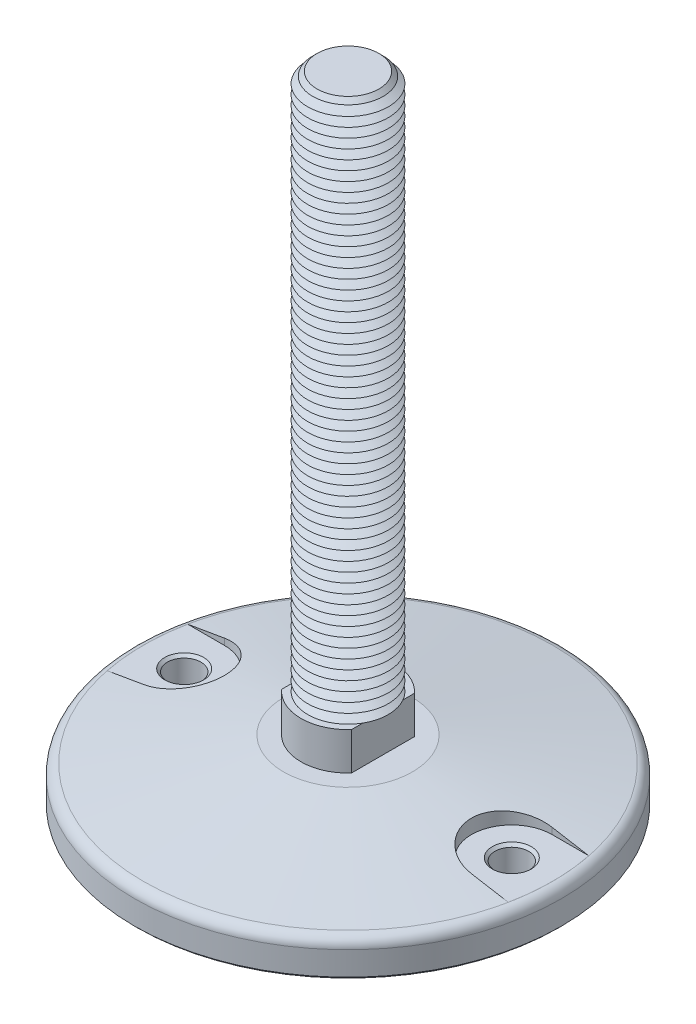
ISO-10303-21;
HEADER;
FILE_DESCRIPTION(('STEP AP214'),'2;1');
FILE_NAME('part.step','',(''),(''),'','','');
FILE_SCHEMA(('AUTOMOTIVE_DESIGN { 1 0 10303 214 1 1 1 1 }'));
ENDSEC;
DATA;
#1=APPLICATION_CONTEXT('core data for automotive mechanical design processes');
#2=APPLICATION_PROTOCOL_DEFINITION('international standard','automotive_design',2000,#1);
#3=PRODUCT_CONTEXT('',#1,'mechanical');
#4=PRODUCT('Part','Part','',(#3));
#5=PRODUCT_RELATED_PRODUCT_CATEGORY('part','',(#4));
#6=PRODUCT_DEFINITION_FORMATION('','',#4);
#7=PRODUCT_DEFINITION_CONTEXT('part definition',#1,'design');
#8=PRODUCT_DEFINITION('design','',#6,#7);
#9=PRODUCT_DEFINITION_SHAPE('','',#8);
#10=(LENGTH_UNIT() NAMED_UNIT(*) SI_UNIT(.MILLI.,.METRE.));
#11=(NAMED_UNIT(*) PLANE_ANGLE_UNIT() SI_UNIT($,.RADIAN.));
#12=(NAMED_UNIT(*) SI_UNIT($,.STERADIAN.) SOLID_ANGLE_UNIT());
#13=UNCERTAINTY_MEASURE_WITH_UNIT(LENGTH_MEASURE(1.E-05),#10,'distance_accuracy_value','');
#14=(GEOMETRIC_REPRESENTATION_CONTEXT(3) GLOBAL_UNCERTAINTY_ASSIGNED_CONTEXT((#13)) GLOBAL_UNIT_ASSIGNED_CONTEXT((#10,
#11,#12)) REPRESENTATION_CONTEXT('',''));
#15=CARTESIAN_POINT('',(0.,0.,0.));
#16=DIRECTION('',(0.,0.,1.));
#17=DIRECTION('',(1.,0.,0.));
#18=AXIS2_PLACEMENT_3D('',#15,#16,#17);
#19=CARTESIAN_POINT('',(0.,0.,0.));
#20=DIRECTION('',(0.,-1.,0.));
#21=DIRECTION('',(0.,0.,-1.));
#22=AXIS2_PLACEMENT_3D('',#19,#20,#21);
#23=CONICAL_SURFACE('',#22,24.,1.39626340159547);
#24=CARTESIAN_POINT('',(-61.0002,-6.84455305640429,14.9999999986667));
#25=CARTESIAN_POINT('',(-60.5719080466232,-6.77122530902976,15.0000486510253));
#26=CARTESIAN_POINT('',(-60.1437494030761,-6.69717888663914,14.981669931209));
#27=CARTESIAN_POINT('',(-59.2907529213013,-6.54813452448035,14.9084324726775));
#28=CARTESIAN_POINT('',(-58.865914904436,-6.47313663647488,14.8535757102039));
#29=CARTESIAN_POINT('',(-58.0227762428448,-6.32270449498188,14.7077930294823));
#30=CARTESIAN_POINT('',(-57.6044724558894,-6.24727047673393,14.6168850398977));
#31=CARTESIAN_POINT('',(-56.7771541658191,-6.09645264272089,14.3996686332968));
#32=CARTESIAN_POINT('',(-56.3681395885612,-6.02106882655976,14.2733604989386));
#33=CARTESIAN_POINT('',(-55.5621199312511,-5.87087312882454,13.986156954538));
#34=CARTESIAN_POINT('',(-55.1651202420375,-5.79606151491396,13.8252462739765));
#35=CARTESIAN_POINT('',(-54.3861487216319,-5.64763733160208,13.4699748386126));
#36=CARTESIAN_POINT('',(-54.0041768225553,-5.57402475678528,13.2756142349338));
#37=CARTESIAN_POINT('',(-53.2580678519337,-5.42864124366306,12.8548003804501));
#38=CARTESIAN_POINT('',(-52.8939274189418,-5.35686995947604,12.6283532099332));
#39=CARTESIAN_POINT('',(-52.186041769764,-5.21581901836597,12.1448693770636));
#40=CARTESIAN_POINT('',(-51.8422964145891,-5.14653934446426,11.8878329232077));
#41=CARTESIAN_POINT('',(-51.1785561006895,-5.01133737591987,11.3455904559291));
#42=CARTESIAN_POINT('',(-50.8585036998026,-4.94540709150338,11.0604567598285));
#43=CARTESIAN_POINT('',(-50.2435776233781,-4.81743482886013,10.463413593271));
#44=CARTESIAN_POINT('',(-49.948704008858,-4.75539286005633,10.1515040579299));
#45=CARTESIAN_POINT('',(-49.3863482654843,-4.6359259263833,9.5030156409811));
#46=CARTESIAN_POINT('',(-49.1188689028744,-4.57850142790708,9.16643427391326));
#47=CARTESIAN_POINT('',(-48.6134211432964,-4.46901587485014,8.47097635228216));
#48=CARTESIAN_POINT('',(-48.3754523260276,-4.41695474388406,8.11210011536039));
#49=CARTESIAN_POINT('',(-47.9343068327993,-4.31966643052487,7.38020662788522));
#50=CARTESIAN_POINT('',(-47.7306564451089,-4.27434742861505,7.00748710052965));
#51=CARTESIAN_POINT('',(-47.3554457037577,-4.19027418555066,6.24551642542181));
#52=CARTESIAN_POINT('',(-47.1838850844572,-4.15151989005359,5.85626541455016));
#53=CARTESIAN_POINT('',(-46.8742907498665,-4.08118572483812,5.06410373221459));
#54=CARTESIAN_POINT('',(-46.7362508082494,-4.04960452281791,4.66119561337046));
#55=CARTESIAN_POINT('',(-46.4948208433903,-3.99412823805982,3.84461191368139));
#56=CARTESIAN_POINT('',(-46.3914302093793,-3.97023301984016,3.43093652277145));
#57=CARTESIAN_POINT('',(-46.2221429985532,-3.93099396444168,2.60545435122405));
#58=CARTESIAN_POINT('',(-46.1554440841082,-3.91546729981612,2.19382064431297));
#59=CARTESIAN_POINT('',(-46.0565351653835,-3.8924103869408,1.36621022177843));
#60=CARTESIAN_POINT('',(-46.0243246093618,-3.88488001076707,0.95023357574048));
#61=CARTESIAN_POINT('',(-45.9946646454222,-3.87794669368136,0.117003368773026));
#62=CARTESIAN_POINT('',(-45.9972129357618,-3.87854321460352,-0.300250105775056));
#63=CARTESIAN_POINT('',(-46.0370435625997,-3.88785198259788,-1.13300367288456));
#64=CARTESIAN_POINT('',(-46.0743257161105,-3.89656418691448,-1.54850377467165));
#65=CARTESIAN_POINT('',(-46.182543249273,-3.92177454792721,-2.36891759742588));
#66=CARTESIAN_POINT('',(-46.2529993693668,-3.93816180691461,-2.77389806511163));
#67=CARTESIAN_POINT('',(-46.4267978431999,-3.97840764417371,-3.57635456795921));
#68=CARTESIAN_POINT('',(-46.5301398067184,-4.00226613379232,-3.97383069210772));
#69=CARTESIAN_POINT('',(-46.7688882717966,-4.05707448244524,-4.75853501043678));
#70=CARTESIAN_POINT('',(-46.9042953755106,-4.08802447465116,-5.14576301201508));
#71=CARTESIAN_POINT('',(-47.206117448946,-4.15654424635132,-5.90733280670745));
#72=CARTESIAN_POINT('',(-47.3725327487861,-4.19411409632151,-6.28167446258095));
#73=CARTESIAN_POINT('',(-47.7365717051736,-4.27566086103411,-7.01794010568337));
#74=CARTESIAN_POINT('',(-47.9344367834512,-4.31968711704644,-7.37973923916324));
#75=CARTESIAN_POINT('',(-48.3589021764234,-4.41331257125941,-8.08530451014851));
#76=CARTESIAN_POINT('',(-48.5855025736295,-4.46291178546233,-8.42907059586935));
#77=CARTESIAN_POINT('',(-49.0657858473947,-4.56705084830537,-9.09634650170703));
#78=CARTESIAN_POINT('',(-49.3194694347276,-4.62159082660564,-9.41985578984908));
#79=CARTESIAN_POINT('',(-49.8521052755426,-4.73496487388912,-10.0445475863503));
#80=CARTESIAN_POINT('',(-50.131057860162,-4.79379899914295,-10.3457298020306));
#81=CARTESIAN_POINT('',(-50.7186282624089,-4.91644106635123,-10.9301791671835));
#82=CARTESIAN_POINT('',(-51.0277601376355,-4.98032946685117,-11.2129127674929));
#83=CARTESIAN_POINT('',(-51.6681809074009,-5.11124627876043,-11.7512616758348));
#84=CARTESIAN_POINT('',(-51.9994702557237,-5.17827475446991,-12.0068764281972));
#85=CARTESIAN_POINT('',(-52.6820261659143,-5.31484958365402,-12.489438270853));
#86=CARTESIAN_POINT('',(-53.0333008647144,-5.38439695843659,-12.7163735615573));
#87=CARTESIAN_POINT('',(-53.7532696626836,-5.52535961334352,-13.1399905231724));
#88=CARTESIAN_POINT('',(-54.1219634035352,-5.59677485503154,-13.3366728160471));
#89=CARTESIAN_POINT('',(-54.8815627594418,-5.74228287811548,-13.7020352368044));
#90=CARTESIAN_POINT('',(-55.2727604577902,-5.81640072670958,-13.8700983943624));
#91=CARTESIAN_POINT('',(-56.0678984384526,-5.96537527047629,-14.1723417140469));
#92=CARTESIAN_POINT('',(-56.4718387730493,-6.04023196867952,-14.3065217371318));
#93=CARTESIAN_POINT('',(-57.2891056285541,-6.19003340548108,-14.5399332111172));
#94=CARTESIAN_POINT('',(-57.7024198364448,-6.26497791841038,-14.6392079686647));
#95=CARTESIAN_POINT('',(-58.5358762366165,-6.4145012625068,-14.8023063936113));
#96=CARTESIAN_POINT('',(-58.9560150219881,-6.48908025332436,-14.8661472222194));
#97=CARTESIAN_POINT('',(-59.6475646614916,-6.61057728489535,-14.9413662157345));
#98=CARTESIAN_POINT('',(-59.9178207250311,-6.65774602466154,-14.9633673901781));
#99=CARTESIAN_POINT('',(-60.458759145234,-6.75155340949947,-14.9926755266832));
#100=CARTESIAN_POINT('',(-60.7294400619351,-6.79819280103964,-15.000006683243));
#101=CARTESIAN_POINT('',(-61.0002,-6.84455305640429,-14.9999999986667));
#102=B_SPLINE_CURVE_WITH_KNOTS('',3,(#24,#25,#26,#27,#28,#29,#30,#31,#32,#33,#34,#35,#36,#37,
#38,#39,#40,#41,#42,#43,#44,#45,#46,#47,#48,#49,#50,#51,#52,#53,#54,#55,#56,#57,#58,#59,#60,#61,
#62,#63,#64,#65,#66,#67,#68,#69,#70,#71,#72,#73,#74,#75,#76,#77,#78,#79,#80,#81,#82,#83,#84,#85,
#86,#87,#88,#89,#90,#91,#92,#93,#94,#95,#96,#97,#98,#99,#100,#101),.UNSPECIFIED.,.F.,.F.,(4,2,2,
2,2,2,2,2,2,2,2,2,2,2,2,2,2,2,2,2,2,2,2,2,2,2,2,2,2,2,2,2,2,2,2,2,2,2,4),(0.,1.30316757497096,
2.6062645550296,3.9087143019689,5.21115364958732,6.51416896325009,7.81717839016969,
9.11994123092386,10.4226951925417,11.722179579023,13.0216671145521,14.3212857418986,
15.620885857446,16.9007390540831,18.1805816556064,19.4601863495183,20.7397684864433,
21.9901285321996,23.2404685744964,24.4907258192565,25.7409764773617,26.9736945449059,
28.2063979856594,29.4391245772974,30.67186429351,31.9145698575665,33.1572789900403,
34.4000207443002,35.6427787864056,36.912623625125,38.1824944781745,39.4528861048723,
40.7232516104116,42.0182516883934,43.3132570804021,44.6066500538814,45.8994160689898,
46.7247199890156,47.5486616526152),.UNSPECIFIED.);
#103=CARTESIAN_POINT('',(-61.,-6.84451881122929,15.));
#104=VERTEX_POINT('',#103);
#105=CARTESIAN_POINT('',(-61.,-6.84451881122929,-15.));
#106=VERTEX_POINT('',#105);
#107=EDGE_CURVE('E736',#104,#106,#102,.T.);
#108=ORIENTED_EDGE('',*,*,#107,.F.);
#109=CARTESIAN_POINT('',(-104.042185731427,-14.3032773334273,15.));
#110=CARTESIAN_POINT('',(-101.426826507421,-13.8468501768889,15.));
#111=CARTESIAN_POINT('',(-98.8114117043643,-13.3907410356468,15.));
#112=CARTESIAN_POINT('',(-93.5804323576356,-12.4793845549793,15.));
#113=CARTESIAN_POINT('',(-90.964867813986,-12.0241372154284,15.));
#114=CARTESIAN_POINT('',(-85.7335581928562,-11.1147314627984,15.));
#115=CARTESIAN_POINT('',(-83.1178131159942,-10.6605730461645,15.));
#116=CARTESIAN_POINT('',(-77.8860747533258,-9.75368383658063,15.));
#117=CARTESIAN_POINT('',(-75.2700814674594,-9.30095304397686,15.));
#118=CARTESIAN_POINT('',(-70.0377535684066,-8.39740791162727,15.));
#119=CARTESIAN_POINT('',(-67.4214189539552,-7.94659357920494,15.));
#120=CARTESIAN_POINT('',(-62.1882957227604,-7.04761438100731,15.));
#121=CARTESIAN_POINT('',(-59.5715071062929,-6.59944951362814,15.));
#122=CARTESIAN_POINT('',(-55.6458288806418,-5.93007736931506,15.));
#123=CARTESIAN_POINT('',(-54.3371844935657,-5.70743210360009,15.));
#124=CARTESIAN_POINT('',(-51.7196954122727,-5.26332337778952,15.));
#125=CARTESIAN_POINT('',(-50.4108507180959,-5.04185991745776,15.));
#126=CARTESIAN_POINT('',(-47.7929137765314,-4.60038366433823,15.));
#127=CARTESIAN_POINT('',(-46.4838215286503,-4.38037087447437,15.));
#128=CARTESIAN_POINT('',(-43.8653264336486,-3.94219643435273,15.));
#129=CARTESIAN_POINT('',(-42.5559235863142,-3.72403478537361,15.));
#130=CARTESIAN_POINT('',(-41.2463335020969,-3.50699886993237,15.));
#131=B_SPLINE_CURVE_WITH_KNOTS('',3,(#109,#110,#111,#112,#113,#114,#115,#116,#117,#118,#119,
#120,#121,#122,#123,#124,#125,#126,#127,#128,#129,#130),.UNSPECIFIED.,.F.,.F.,(4,2,2,2,2,2,2,2,
2,2,4),(0.,7.96466371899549,15.9293262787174,23.8939628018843,31.8586012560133,39.8232701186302,
47.7879341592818,51.7702809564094,55.7526269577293,59.734980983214,63.7173377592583),.UNSPECIFIED.);
#132=CARTESIAN_POINT('',(-74.6843450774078,-9.2,15.));
#133=VERTEX_POINT('',#132);
#134=EDGE_CURVE('E710',#133,#104,#131,.T.);
#135=ORIENTED_EDGE('',*,*,#134,.F.);
#136=CARTESIAN_POINT('',(0.,-9.2,0.));
#137=DIRECTION('',(0.,1.,0.));
#138=DIRECTION('',(0.,0.,1.));
#139=AXIS2_PLACEMENT_3D('',#136,#137,#138);
#140=CIRCLE('',#139,76.175792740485);
#141=CARTESIAN_POINT('',(-74.6843450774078,-9.2,-15.));
#142=VERTEX_POINT('',#141);
#143=EDGE_CURVE('E694',#133,#142,#140,.F.);
#144=ORIENTED_EDGE('',*,*,#143,.T.);
#145=CARTESIAN_POINT('',(-41.2463335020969,-3.50699886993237,-15.));
#146=CARTESIAN_POINT('',(-42.5559235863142,-3.72403478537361,-15.));
#147=CARTESIAN_POINT('',(-43.8653264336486,-3.94219643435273,-15.));
#148=CARTESIAN_POINT('',(-46.4838215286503,-4.38037087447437,-15.));
#149=CARTESIAN_POINT('',(-47.7929137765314,-4.60038366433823,-15.));
#150=CARTESIAN_POINT('',(-50.4108507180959,-5.04185991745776,-15.));
#151=CARTESIAN_POINT('',(-51.7196954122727,-5.26332337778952,-15.));
#152=CARTESIAN_POINT('',(-54.3371844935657,-5.70743210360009,-15.));
#153=CARTESIAN_POINT('',(-55.6458288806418,-5.93007736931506,-15.));
#154=CARTESIAN_POINT('',(-59.5715071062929,-6.59944951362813,-15.));
#155=CARTESIAN_POINT('',(-62.1882957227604,-7.04761438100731,-15.));
#156=CARTESIAN_POINT('',(-67.4214189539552,-7.94659357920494,-15.));
#157=CARTESIAN_POINT('',(-70.0377535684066,-8.39740791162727,-15.));
#158=CARTESIAN_POINT('',(-75.2700814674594,-9.30095304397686,-15.));
#159=CARTESIAN_POINT('',(-77.8860747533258,-9.75368383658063,-15.));
#160=CARTESIAN_POINT('',(-83.1178131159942,-10.6605730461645,-15.));
#161=CARTESIAN_POINT('',(-85.7335581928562,-11.1147314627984,-15.));
#162=CARTESIAN_POINT('',(-90.964867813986,-12.0241372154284,-15.));
#163=CARTESIAN_POINT('',(-93.5804323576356,-12.4793845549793,-15.));
#164=CARTESIAN_POINT('',(-98.8114117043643,-13.3907410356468,-15.));
#165=CARTESIAN_POINT('',(-101.426826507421,-13.8468501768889,-15.));
#166=CARTESIAN_POINT('',(-104.042185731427,-14.3032773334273,-15.));
#167=B_SPLINE_CURVE_WITH_KNOTS('',3,(#145,#146,#147,#148,#149,#150,#151,#152,#153,#154,#155,
#156,#157,#158,#159,#160,#161,#162,#163,#164,#165,#166),.UNSPECIFIED.,.F.,.F.,(4,2,2,2,2,2,2,2,
2,2,4),(0.,3.98235677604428,7.96471080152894,11.9470568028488,15.9294035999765,23.8940676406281,
31.8587365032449,39.8233749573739,47.7880114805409,55.7526740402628,63.7173377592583),.UNSPECIFIED.);
#168=EDGE_CURVE('E702',#106,#142,#167,.T.);
#169=ORIENTED_EDGE('',*,*,#168,.F.);
#170=EDGE_LOOP('',(#108,#135,#144,#169));
#171=FACE_BOUND('',#170,.T.);
#172=CARTESIAN_POINT('',(0.,-9.20331494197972,0.));
#173=DIRECTION('',(0.,1.,0.));
#174=DIRECTION('',(0.,0.,1.));
#175=AXIS2_PLACEMENT_3D('',#172,#173,#174);
#176=CIRCLE('',#175,76.1945927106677);
#177=CARTESIAN_POINT('',(0.,-9.20331494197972,76.1945927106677));
#178=VERTEX_POINT('',#177);
#179=EDGE_CURVE('E683',#178,#178,#176,.T.);
#180=ORIENTED_EDGE('',*,*,#179,.T.);
#181=EDGE_LOOP('',(#180));
#182=FACE_BOUND('',#181,.T.);
#183=CARTESIAN_POINT('',(0.,0.,0.));
#184=DIRECTION('',(0.,1.,0.));
#185=DIRECTION('',(0.,0.,1.));
#186=AXIS2_PLACEMENT_3D('',#183,#184,#185);
#187=CIRCLE('',#186,24.);
#188=CARTESIAN_POINT('',(0.,0.,24.));
#189=VERTEX_POINT('',#188);
#190=EDGE_CURVE('E679',#189,#189,#187,.T.);
#191=ORIENTED_EDGE('',*,*,#190,.F.);
#192=EDGE_LOOP('',(#191));
#193=FACE_BOUND('',#192,.T.);
#194=CARTESIAN_POINT('',(94.0652754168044,-12.563957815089,15.));
#195=CARTESIAN_POINT('',(91.449731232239,-12.1085412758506,15.));
#196=CARTESIAN_POINT('',(88.8341137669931,-11.653544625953,15.));
#197=CARTESIAN_POINT('',(83.6026721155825,-10.7447399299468,15.));
#198=CARTESIAN_POINT('',(80.9868479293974,-10.2909318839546,15.));
#199=CARTESIAN_POINT('',(75.7549567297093,-9.38485738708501,15.));
#200=CARTESIAN_POINT('',(73.1388897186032,-8.93259092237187,15.));
#201=CARTESIAN_POINT('',(67.9063931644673,-8.03014521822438,15.));
#202=CARTESIAN_POINT('',(65.2899636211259,-7.57996598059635,15.));
#203=CARTESIAN_POINT('',(60.0565735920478,-6.68252310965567,15.));
#204=CARTESIAN_POINT('',(57.4396131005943,-6.2352595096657,15.));
#205=CARTESIAN_POINT('',(52.2049769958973,-5.34496105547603,15.));
#206=CARTESIAN_POINT('',(49.5873013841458,-4.90192619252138,15.));
#207=CARTESIAN_POINT('',(45.659951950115,-4.24226428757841,15.));
#208=CARTESIAN_POINT('',(44.3506891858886,-4.02319090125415,15.));
#209=CARTESIAN_POINT('',(41.7318168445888,-3.58713211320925,15.));
#210=CARTESIAN_POINT('',(40.4222072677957,-3.3701467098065,15.));
#211=CARTESIAN_POINT('',(37.8025367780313,-2.93885600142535,15.));
#212=CARTESIAN_POINT('',(36.4924758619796,-2.72455071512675,15.));
#213=CARTESIAN_POINT('',(34.5269525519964,-2.40574421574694,15.));
#214=CARTESIAN_POINT('',(33.8717052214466,-2.29991714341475,15.));
#215=CARTESIAN_POINT('',(32.5610443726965,-2.08929455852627,15.));
#216=CARTESIAN_POINT('',(31.9056308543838,-1.98449904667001,15.));
#217=CARTESIAN_POINT('',(31.2501232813,-1.88029321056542,15.));
#218=B_SPLINE_CURVE_WITH_KNOTS('',3,(#194,#195,#196,#197,#198,#199,#200,#201,#202,#203,#204,
#205,#206,#207,#208,#209,#210,#211,#212,#213,#214,#215,#216,#217),.UNSPECIFIED.,.F.,.F.,(4,2,2,
2,2,2,2,2,2,2,2,4),(0.,7.96468982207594,15.9293804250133,23.8939993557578,31.8586251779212,
39.82334186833,47.7880420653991,51.7704344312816,55.7528235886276,59.7352404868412,
61.7264544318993,63.7176697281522),.UNSPECIFIED.);
#219=CARTESIAN_POINT('',(74.6843450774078,-9.2,15.));
#220=VERTEX_POINT('',#219);
#221=CARTESIAN_POINT('',(61.,-6.84451881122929,15.));
#222=VERTEX_POINT('',#221);
#223=EDGE_CURVE('E133',#220,#222,#218,.T.);
#224=ORIENTED_EDGE('',*,*,#223,.T.);
#225=CARTESIAN_POINT('',(61.0002,-6.84455305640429,14.9999999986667));
#226=CARTESIAN_POINT('',(60.5719080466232,-6.77122530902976,15.0000486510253));
#227=CARTESIAN_POINT('',(60.1437494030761,-6.69717888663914,14.981669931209));
#228=CARTESIAN_POINT('',(59.2907529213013,-6.54813452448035,14.9084324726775));
#229=CARTESIAN_POINT('',(58.865914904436,-6.47313663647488,14.8535757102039));
#230=CARTESIAN_POINT('',(58.0227762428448,-6.32270449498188,14.7077930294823));
#231=CARTESIAN_POINT('',(57.6044724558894,-6.24727047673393,14.6168850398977));
#232=CARTESIAN_POINT('',(56.7771541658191,-6.09645264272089,14.3996686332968));
#233=CARTESIAN_POINT('',(56.3681395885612,-6.02106882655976,14.2733604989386));
#234=CARTESIAN_POINT('',(55.5621199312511,-5.87087312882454,13.986156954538));
#235=CARTESIAN_POINT('',(55.1651202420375,-5.79606151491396,13.8252462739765));
#236=CARTESIAN_POINT('',(54.3861487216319,-5.64763733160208,13.4699748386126));
#237=CARTESIAN_POINT('',(54.0041768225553,-5.57402475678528,13.2756142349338));
#238=CARTESIAN_POINT('',(53.2580678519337,-5.42864124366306,12.8548003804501));
#239=CARTESIAN_POINT('',(52.8939274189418,-5.35686995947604,12.6283532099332));
#240=CARTESIAN_POINT('',(52.186041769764,-5.21581901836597,12.1448693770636));
#241=CARTESIAN_POINT('',(51.8422964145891,-5.14653934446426,11.8878329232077));
#242=CARTESIAN_POINT('',(51.1785561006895,-5.01133737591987,11.3455904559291));
#243=CARTESIAN_POINT('',(50.8585036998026,-4.94540709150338,11.0604567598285));
#244=CARTESIAN_POINT('',(50.2435776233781,-4.81743482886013,10.463413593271));
#245=CARTESIAN_POINT('',(49.948704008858,-4.75539286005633,10.1515040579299));
#246=CARTESIAN_POINT('',(49.3863482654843,-4.6359259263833,9.5030156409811));
#247=CARTESIAN_POINT('',(49.1188689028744,-4.57850142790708,9.16643427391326));
#248=CARTESIAN_POINT('',(48.6134211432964,-4.46901587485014,8.47097635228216));
#249=CARTESIAN_POINT('',(48.3754523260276,-4.41695474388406,8.11210011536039));
#250=CARTESIAN_POINT('',(47.9343068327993,-4.31966643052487,7.38020662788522));
#251=CARTESIAN_POINT('',(47.7306564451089,-4.27434742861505,7.00748710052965));
#252=CARTESIAN_POINT('',(47.3554457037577,-4.19027418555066,6.24551642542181));
#253=CARTESIAN_POINT('',(47.1838850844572,-4.15151989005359,5.85626541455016));
#254=CARTESIAN_POINT('',(46.8742907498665,-4.08118572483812,5.06410373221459));
#255=CARTESIAN_POINT('',(46.7362508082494,-4.04960452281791,4.66119561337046));
#256=CARTESIAN_POINT('',(46.4948208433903,-3.99412823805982,3.84461191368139));
#257=CARTESIAN_POINT('',(46.3914302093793,-3.97023301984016,3.43093652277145));
#258=CARTESIAN_POINT('',(46.2221429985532,-3.93099396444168,2.60545435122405));
#259=CARTESIAN_POINT('',(46.1554440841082,-3.91546729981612,2.19382064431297));
#260=CARTESIAN_POINT('',(46.0565351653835,-3.8924103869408,1.36621022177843));
#261=CARTESIAN_POINT('',(46.0243246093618,-3.88488001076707,0.95023357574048));
#262=CARTESIAN_POINT('',(45.9946646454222,-3.87794669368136,0.117003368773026));
#263=CARTESIAN_POINT('',(45.9972129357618,-3.87854321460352,-0.300250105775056));
#264=CARTESIAN_POINT('',(46.0370435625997,-3.88785198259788,-1.13300367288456));
#265=CARTESIAN_POINT('',(46.0743257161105,-3.89656418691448,-1.54850377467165));
#266=CARTESIAN_POINT('',(46.182543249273,-3.92177454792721,-2.36891759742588));
#267=CARTESIAN_POINT('',(46.2529993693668,-3.93816180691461,-2.77389806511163));
#268=CARTESIAN_POINT('',(46.4267978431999,-3.97840764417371,-3.57635456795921));
#269=CARTESIAN_POINT('',(46.5301398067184,-4.00226613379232,-3.97383069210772));
#270=CARTESIAN_POINT('',(46.7688882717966,-4.05707448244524,-4.75853501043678));
#271=CARTESIAN_POINT('',(46.9042953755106,-4.08802447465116,-5.14576301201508));
#272=CARTESIAN_POINT('',(47.206117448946,-4.15654424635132,-5.90733280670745));
#273=CARTESIAN_POINT('',(47.3725327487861,-4.19411409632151,-6.28167446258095));
#274=CARTESIAN_POINT('',(47.7365717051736,-4.27566086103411,-7.01794010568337));
#275=CARTESIAN_POINT('',(47.9344367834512,-4.31968711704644,-7.37973923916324));
#276=CARTESIAN_POINT('',(48.3589021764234,-4.41331257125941,-8.08530451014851));
#277=CARTESIAN_POINT('',(48.5855025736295,-4.46291178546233,-8.42907059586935));
#278=CARTESIAN_POINT('',(49.0657858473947,-4.56705084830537,-9.09634650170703));
#279=CARTESIAN_POINT('',(49.3194694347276,-4.62159082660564,-9.41985578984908));
#280=CARTESIAN_POINT('',(49.8521052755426,-4.73496487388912,-10.0445475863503));
#281=CARTESIAN_POINT('',(50.131057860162,-4.79379899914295,-10.3457298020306));
#282=CARTESIAN_POINT('',(50.7186282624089,-4.91644106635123,-10.9301791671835));
#283=CARTESIAN_POINT('',(51.0277601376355,-4.98032946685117,-11.2129127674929));
#284=CARTESIAN_POINT('',(51.6681809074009,-5.11124627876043,-11.7512616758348));
#285=CARTESIAN_POINT('',(51.9994702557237,-5.17827475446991,-12.0068764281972));
#286=CARTESIAN_POINT('',(52.6820261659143,-5.31484958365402,-12.489438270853));
#287=CARTESIAN_POINT('',(53.0333008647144,-5.38439695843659,-12.7163735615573));
#288=CARTESIAN_POINT('',(53.7532696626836,-5.52535961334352,-13.1399905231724));
#289=CARTESIAN_POINT('',(54.1219634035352,-5.59677485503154,-13.3366728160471));
#290=CARTESIAN_POINT('',(54.8815627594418,-5.74228287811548,-13.7020352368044));
#291=CARTESIAN_POINT('',(55.2727604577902,-5.81640072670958,-13.8700983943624));
#292=CARTESIAN_POINT('',(56.0678984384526,-5.96537527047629,-14.1723417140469));
#293=CARTESIAN_POINT('',(56.4718387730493,-6.04023196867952,-14.3065217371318));
#294=CARTESIAN_POINT('',(57.2891056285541,-6.19003340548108,-14.5399332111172));
#295=CARTESIAN_POINT('',(57.7024198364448,-6.26497791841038,-14.6392079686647));
#296=CARTESIAN_POINT('',(58.5358762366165,-6.4145012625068,-14.8023063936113));
#297=CARTESIAN_POINT('',(58.9560150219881,-6.48908025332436,-14.8661472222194));
#298=CARTESIAN_POINT('',(59.6475646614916,-6.61057728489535,-14.9413662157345));
#299=CARTESIAN_POINT('',(59.9178207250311,-6.65774602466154,-14.9633673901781));
#300=CARTESIAN_POINT('',(60.458759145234,-6.75155340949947,-14.9926755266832));
#301=CARTESIAN_POINT('',(60.7294400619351,-6.79819280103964,-15.000006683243));
#302=CARTESIAN_POINT('',(61.0002,-6.84455305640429,-14.9999999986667));
#303=B_SPLINE_CURVE_WITH_KNOTS('',3,(#225,#226,#227,#228,#229,#230,#231,#232,#233,#234,#235,
#236,#237,#238,#239,#240,#241,#242,#243,#244,#245,#246,#247,#248,#249,#250,#251,#252,#253,#254,
#255,#256,#257,#258,#259,#260,#261,#262,#263,#264,#265,#266,#267,#268,#269,#270,#271,#272,#273,
#274,#275,#276,#277,#278,#279,#280,#281,#282,#283,#284,#285,#286,#287,#288,#289,#290,#291,#292,
#293,#294,#295,#296,#297,#298,#299,#300,#301,#302),.UNSPECIFIED.,.F.,.F.,(4,2,2,2,2,2,2,2,2,2,2,
2,2,2,2,2,2,2,2,2,2,2,2,2,2,2,2,2,2,2,2,2,2,2,2,2,2,2,4),(0.,1.30316757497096,2.6062645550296,
3.9087143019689,5.21115364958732,6.51416896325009,7.81717839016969,9.11994123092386,
10.4226951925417,11.722179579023,13.0216671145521,14.3212857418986,15.620885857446,
16.9007390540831,18.1805816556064,19.4601863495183,20.7397684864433,21.9901285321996,
23.2404685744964,24.4907258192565,25.7409764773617,26.9736945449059,28.2063979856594,
29.4391245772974,30.67186429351,31.9145698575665,33.1572789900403,34.4000207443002,
35.6427787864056,36.912623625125,38.1824944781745,39.4528861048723,40.7232516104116,
42.0182516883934,43.3132570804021,44.6066500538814,45.8994160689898,46.7247199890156,
47.5486616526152),.UNSPECIFIED.);
#304=CARTESIAN_POINT('',(61.,-6.84451881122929,-15.));
#305=VERTEX_POINT('',#304);
#306=EDGE_CURVE('E145',#222,#305,#303,.T.);
#307=ORIENTED_EDGE('',*,*,#306,.T.);
#308=CARTESIAN_POINT('',(31.2501232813,-1.88029321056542,-15.));
#309=CARTESIAN_POINT('',(31.9056308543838,-1.98449904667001,-15.));
#310=CARTESIAN_POINT('',(32.5610443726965,-2.08929455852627,-15.));
#311=CARTESIAN_POINT('',(33.8717052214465,-2.29991714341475,-15.));
#312=CARTESIAN_POINT('',(34.5269525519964,-2.40574421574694,-15.));
#313=CARTESIAN_POINT('',(36.4924758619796,-2.72455071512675,-15.));
#314=CARTESIAN_POINT('',(37.8025367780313,-2.93885600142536,-15.));
#315=CARTESIAN_POINT('',(40.4222072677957,-3.3701467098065,-15.));
#316=CARTESIAN_POINT('',(41.7318168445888,-3.58713211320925,-15.));
#317=CARTESIAN_POINT('',(44.3506891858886,-4.02319090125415,-15.));
#318=CARTESIAN_POINT('',(45.659951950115,-4.24226428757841,-15.));
#319=CARTESIAN_POINT('',(49.5873013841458,-4.90192619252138,-15.));
#320=CARTESIAN_POINT('',(52.2049769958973,-5.34496105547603,-15.));
#321=CARTESIAN_POINT('',(57.4396131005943,-6.2352595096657,-15.));
#322=CARTESIAN_POINT('',(60.0565735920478,-6.68252310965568,-15.));
#323=CARTESIAN_POINT('',(65.2899636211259,-7.57996598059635,-15.));
#324=CARTESIAN_POINT('',(67.9063931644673,-8.03014521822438,-15.));
#325=CARTESIAN_POINT('',(73.1388897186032,-8.93259092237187,-15.));
#326=CARTESIAN_POINT('',(75.7549567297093,-9.38485738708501,-15.));
#327=CARTESIAN_POINT('',(80.9868479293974,-10.2909318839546,-15.));
#328=CARTESIAN_POINT('',(83.6026721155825,-10.7447399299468,-15.));
#329=CARTESIAN_POINT('',(88.8341137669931,-11.653544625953,-15.));
#330=CARTESIAN_POINT('',(91.449731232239,-12.1085412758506,-15.));
#331=CARTESIAN_POINT('',(94.0652754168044,-12.563957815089,-15.));
#332=B_SPLINE_CURVE_WITH_KNOTS('',3,(#308,#309,#310,#311,#312,#313,#314,#315,#316,#317,#318,
#319,#320,#321,#322,#323,#324,#325,#326,#327,#328,#329,#330,#331),.UNSPECIFIED.,.F.,.F.,(4,2,2,
2,2,2,2,2,2,2,2,4),(0.,1.99121529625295,3.98242924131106,7.96484613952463,11.9472352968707,
15.9296276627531,23.8943278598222,31.859044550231,39.8236703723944,47.7882893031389,
55.7529799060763,63.7176697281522),.UNSPECIFIED.);
#333=CARTESIAN_POINT('',(74.6843450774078,-9.2,-15.));
#334=VERTEX_POINT('',#333);
#335=EDGE_CURVE('E765',#305,#334,#332,.T.);
#336=ORIENTED_EDGE('',*,*,#335,.T.);
#337=CARTESIAN_POINT('',(0.,-9.2,0.));
#338=DIRECTION('',(0.,1.,0.));
#339=DIRECTION('',(0.,0.,1.));
#340=AXIS2_PLACEMENT_3D('',#337,#338,#339);
#341=CIRCLE('',#340,76.175792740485);
#342=EDGE_CURVE('E756',#334,#220,#341,.F.);
#343=ORIENTED_EDGE('',*,*,#342,.T.);
#344=EDGE_LOOP('',(#224,#307,#336,#343));
#345=FACE_BOUND('',#344,.T.);
#346=ADVANCED_FACE('F39',(#171,#182,#193,#345),#23,.T.);
#347=CARTESIAN_POINT('',(0.,14.,0.));
#348=DIRECTION('',(0.,1.,0.));
#349=DIRECTION('',(0.,0.,1.));
#350=AXIS2_PLACEMENT_3D('',#347,#348,#349);
#351=PLANE('',#350);
#352=CARTESIAN_POINT('',(0.,14.,0.));
#353=DIRECTION('',(0.,1.,0.));
#354=DIRECTION('',(0.,0.,1.));
#355=AXIS2_PLACEMENT_3D('',#352,#353,#354);
#356=CIRCLE('',#355,15.);
#357=CARTESIAN_POINT('',(13.,14.,-7.48331477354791));
#358=VERTEX_POINT('',#357);
#359=CARTESIAN_POINT('',(-13.,14.,-7.48331477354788));
#360=VERTEX_POINT('',#359);
#361=EDGE_CURVE('E695',#358,#360,#356,.T.);
#362=ORIENTED_EDGE('',*,*,#361,.F.);
#363=DIRECTION('',(0.,0.,1.));
#364=VECTOR('',#363,1.);
#365=CARTESIAN_POINT('',(13.,14.,11.71537451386));
#366=LINE('',#365,#364);
#367=CARTESIAN_POINT('',(13.,14.,-11.71537451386));
#368=VERTEX_POINT('',#367);
#369=EDGE_CURVE('E658',#368,#358,#366,.T.);
#370=ORIENTED_EDGE('',*,*,#369,.F.);
#371=CARTESIAN_POINT('',(0.,14.,0.));
#372=DIRECTION('',(0.,1.,0.));
#373=DIRECTION('',(0.,0.,1.));
#374=AXIS2_PLACEMENT_3D('',#371,#372,#373);
#375=CIRCLE('',#374,17.5);
#376=CARTESIAN_POINT('',(-13.,14.,-11.71537451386));
#377=VERTEX_POINT('',#376);
#378=EDGE_CURVE('E672',#368,#377,#375,.T.);
#379=ORIENTED_EDGE('',*,*,#378,.T.);
#380=DIRECTION('',(0.,0.,-1.));
#381=VECTOR('',#380,1.);
#382=CARTESIAN_POINT('',(-13.,14.,-11.71537451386));
#383=LINE('',#382,#381);
#384=EDGE_CURVE('E645',#360,#377,#383,.T.);
#385=ORIENTED_EDGE('',*,*,#384,.F.);
#386=EDGE_LOOP('',(#362,#370,#379,#385));
#387=FACE_BOUND('',#386,.T.);
#388=ADVANCED_FACE('F820',(#387),#351,.T.);
#389=CARTESIAN_POINT('',(0.,14.,0.));
#390=DIRECTION('',(0.,-1.,0.));
#391=DIRECTION('',(0.,0.,-1.));
#392=AXIS2_PLACEMENT_3D('',#389,#390,#391);
#393=CYLINDRICAL_SURFACE('',#392,17.5);
#394=CARTESIAN_POINT('',(-13.,14.,11.71537451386));
#395=VERTEX_POINT('',#394);
#396=CARTESIAN_POINT('',(13.,14.,11.71537451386));
#397=VERTEX_POINT('',#396);
#398=EDGE_CURVE('E650',#395,#397,#375,.T.);
#399=ORIENTED_EDGE('',*,*,#398,.F.);
#400=DIRECTION('',(0.,1.,0.));
#401=VECTOR('',#400,1.);
#402=CARTESIAN_POINT('',(-13.,0.,11.71537451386));
#403=LINE('',#402,#401);
#404=CARTESIAN_POINT('',(-13.,0.,11.71537451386));
#405=VERTEX_POINT('',#404);
#406=EDGE_CURVE('E639',#405,#395,#403,.T.);
#407=ORIENTED_EDGE('',*,*,#406,.F.);
#408=CARTESIAN_POINT('',(0.,0.,0.));
#409=DIRECTION('',(0.,1.,0.));
#410=DIRECTION('',(0.,0.,1.));
#411=AXIS2_PLACEMENT_3D('',#408,#409,#410);
#412=CIRCLE('',#411,17.5);
#413=CARTESIAN_POINT('',(13.,0.,11.71537451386));
#414=VERTEX_POINT('',#413);
#415=EDGE_CURVE('E673',#405,#414,#412,.T.);
#416=ORIENTED_EDGE('',*,*,#415,.T.);
#417=DIRECTION('',(0.,1.,0.));
#418=VECTOR('',#417,1.);
#419=CARTESIAN_POINT('',(13.,0.,11.71537451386));
#420=LINE('',#419,#418);
#421=EDGE_CURVE('E663',#414,#397,#420,.T.);
#422=ORIENTED_EDGE('',*,*,#421,.T.);
#423=EDGE_LOOP('',(#399,#407,#416,#422));
#424=FACE_BOUND('',#423,.T.);
#425=ADVANCED_FACE('F825',(#424),#393,.T.);
#426=CARTESIAN_POINT('',(0.,0.,0.));
#427=DIRECTION('',(0.,1.,0.));
#428=DIRECTION('',(0.,0.,1.));
#429=AXIS2_PLACEMENT_3D('',#426,#427,#428);
#430=PLANE('',#429);
#431=CARTESIAN_POINT('',(13.,0.,-11.71537451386));
#432=VERTEX_POINT('',#431);
#433=CARTESIAN_POINT('',(-13.,0.,-11.71537451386));
#434=VERTEX_POINT('',#433);
#435=EDGE_CURVE('E677',#432,#434,#412,.T.);
#436=ORIENTED_EDGE('',*,*,#435,.F.);
#437=DIRECTION('',(0.,0.,1.));
#438=VECTOR('',#437,1.);
#439=CARTESIAN_POINT('',(13.,0.,11.71537451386));
#440=LINE('',#439,#438);
#441=EDGE_CURVE('E653',#432,#414,#440,.T.);
#442=ORIENTED_EDGE('',*,*,#441,.T.);
#443=ORIENTED_EDGE('',*,*,#415,.F.);
#444=DIRECTION('',(0.,0.,-1.));
#445=VECTOR('',#444,1.);
#446=CARTESIAN_POINT('',(-13.,0.,-11.71537451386));
#447=LINE('',#446,#445);
#448=EDGE_CURVE('E635',#405,#434,#447,.T.);
#449=ORIENTED_EDGE('',*,*,#448,.T.);
#450=EDGE_LOOP('',(#436,#442,#443,#449));
#451=FACE_BOUND('',#450,.T.);
#452=ORIENTED_EDGE('',*,*,#190,.T.);
#453=EDGE_LOOP('',(#452));
#454=FACE_BOUND('',#453,.T.);
#455=ADVANCED_FACE('F879',(#451,#454),#430,.T.);
#456=CARTESIAN_POINT('',(0.,61.3388655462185,0.));
#457=DIRECTION('',(0.,1.,0.));
#458=DIRECTION('',(0.,0.,1.));
#459=AXIS2_PLACEMENT_3D('',#456,#457,#458);
#460=CYLINDRICAL_SURFACE('',#459,79.5);
#461=CARTESIAN_POINT('',(0.,-22.,0.));
#462=DIRECTION('',(0.,-1.,0.));
#463=DIRECTION('',(0.,0.,-1.));
#464=AXIS2_PLACEMENT_3D('',#461,#462,#463);
#465=CIRCLE('',#464,79.5);
#466=CARTESIAN_POINT('',(0.,-22.,-79.5));
#467=VERTEX_POINT('',#466);
#468=EDGE_CURVE('E48',#467,#467,#465,.F.);
#469=ORIENTED_EDGE('',*,*,#468,.T.);
#470=EDGE_LOOP('',(#469));
#471=FACE_BOUND('',#470,.T.);
#472=CARTESIAN_POINT('',(0.,-13.1425459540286,0.));
#473=DIRECTION('',(0.,-1.,0.));
#474=DIRECTION('',(0.,0.,-1.));
#475=AXIS2_PLACEMENT_3D('',#472,#473,#474);
#476=CIRCLE('',#475,79.5);
#477=CARTESIAN_POINT('',(0.,-13.1425459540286,-79.5));
#478=VERTEX_POINT('',#477);
#479=EDGE_CURVE('E678',#478,#478,#476,.T.);
#480=ORIENTED_EDGE('',*,*,#479,.T.);
#481=EDGE_LOOP('',(#480));
#482=FACE_BOUND('',#481,.T.);
#483=ADVANCED_FACE('F807',(#471,#482),#460,.T.);
#484=CARTESIAN_POINT('',(0.,-23.,79.5));
#485=DIRECTION('',(0.,-1.,0.));
#486=DIRECTION('',(0.,0.,-1.));
#487=AXIS2_PLACEMENT_3D('',#484,#485,#486);
#488=PLANE('',#487);
#489=CARTESIAN_POINT('',(0.,-23.,0.));
#490=DIRECTION('',(0.,-1.,0.));
#491=DIRECTION('',(0.,0.,-1.));
#492=AXIS2_PLACEMENT_3D('',#489,#490,#491);
#493=CIRCLE('',#492,78.5);
#494=CARTESIAN_POINT('',(0.,-23.,-78.5));
#495=VERTEX_POINT('',#494);
#496=EDGE_CURVE('E11',#495,#495,#493,.T.);
#497=ORIENTED_EDGE('',*,*,#496,.T.);
#498=EDGE_LOOP('',(#497));
#499=FACE_BOUND('',#498,.T.);
#500=CARTESIAN_POINT('',(61.,-23.,0.));
#501=DIRECTION('',(0.,-1.,0.));
#502=DIRECTION('',(0.,0.,-1.));
#503=AXIS2_PLACEMENT_3D('',#500,#501,#502);
#504=CIRCLE('',#503,7.25000000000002);
#505=CARTESIAN_POINT('',(61.,-23.,-7.25000000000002));
#506=VERTEX_POINT('',#505);
#507=EDGE_CURVE('E795',#506,#506,#504,.F.);
#508=ORIENTED_EDGE('',*,*,#507,.T.);
#509=EDGE_LOOP('',(#508));
#510=FACE_BOUND('',#509,.T.);
#511=CARTESIAN_POINT('',(-61.,-23.,0.));
#512=DIRECTION('',(0.,-1.,0.));
#513=DIRECTION('',(0.,0.,-1.));
#514=AXIS2_PLACEMENT_3D('',#511,#512,#513);
#515=CIRCLE('',#514,7.25000000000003);
#516=CARTESIAN_POINT('',(-61.,-23.,-7.25000000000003));
#517=VERTEX_POINT('',#516);
#518=EDGE_CURVE('E741',#517,#517,#515,.F.);
#519=ORIENTED_EDGE('',*,*,#518,.T.);
#520=EDGE_LOOP('',(#519));
#521=FACE_BOUND('',#520,.T.);
#522=ADVANCED_FACE('F912',(#499,#510,#521),#488,.T.);
#523=CARTESIAN_POINT('',(0.,-13.1425459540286,0.));
#524=DIRECTION('',(0.,-1.,0.));
#525=DIRECTION('',(0.,0.,-1.));
#526=AXIS2_PLACEMENT_3D('',#523,#524,#525);
#527=TOROIDAL_SURFACE('',#526,75.5,4.);
#528=ORIENTED_EDGE('',*,*,#479,.F.);
#529=EDGE_LOOP('',(#528));
#530=FACE_BOUND('',#529,.T.);
#531=ORIENTED_EDGE('',*,*,#179,.F.);
#532=EDGE_LOOP('',(#531));
#533=FACE_BOUND('',#532,.T.);
#534=ADVANCED_FACE('F911',(#530,#533),#527,.T.);
#535=ORIENTED_EDGE('',*,*,#435,.T.);
#536=DIRECTION('',(0.,1.,0.));
#537=VECTOR('',#536,1.);
#538=CARTESIAN_POINT('',(-13.,0.,-11.71537451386));
#539=LINE('',#538,#537);
#540=EDGE_CURVE('E646',#434,#377,#539,.T.);
#541=ORIENTED_EDGE('',*,*,#540,.T.);
#542=ORIENTED_EDGE('',*,*,#378,.F.);
#543=DIRECTION('',(0.,1.,0.));
#544=VECTOR('',#543,1.);
#545=CARTESIAN_POINT('',(13.,0.,-11.71537451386));
#546=LINE('',#545,#544);
#547=EDGE_CURVE('E657',#432,#368,#546,.T.);
#548=ORIENTED_EDGE('',*,*,#547,.F.);
#549=EDGE_LOOP('',(#535,#541,#542,#548));
#550=FACE_BOUND('',#549,.T.);
#551=ADVANCED_FACE('F876',(#550),#393,.T.);
#552=CARTESIAN_POINT('',(-13.,14.,7.48331477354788));
#553=VERTEX_POINT('',#552);
#554=CARTESIAN_POINT('',(13.,14.,7.48331477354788));
#555=VERTEX_POINT('',#554);
#556=EDGE_CURVE('E634',#553,#555,#356,.T.);
#557=ORIENTED_EDGE('',*,*,#556,.F.);
#558=EDGE_CURVE('E640',#395,#553,#383,.T.);
#559=ORIENTED_EDGE('',*,*,#558,.F.);
#560=ORIENTED_EDGE('',*,*,#398,.T.);
#561=EDGE_CURVE('E633',#555,#397,#366,.T.);
#562=ORIENTED_EDGE('',*,*,#561,.F.);
#563=EDGE_LOOP('',(#557,#559,#560,#562));
#564=FACE_BOUND('',#563,.T.);
#565=ADVANCED_FACE('F828',(#564),#351,.T.);
#566=CARTESIAN_POINT('',(13.,0.,11.71537451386));
#567=DIRECTION('',(-1.,0.,0.));
#568=DIRECTION('',(0.,0.,1.));
#569=AXIS2_PLACEMENT_3D('',#566,#567,#568);
#570=PLANE('',#569);
#571=ORIENTED_EDGE('',*,*,#369,.T.);
#572=EDGE_CURVE('E662',#358,#555,#366,.T.);
#573=ORIENTED_EDGE('',*,*,#572,.T.);
#574=ORIENTED_EDGE('',*,*,#561,.T.);
#575=ORIENTED_EDGE('',*,*,#421,.F.);
#576=ORIENTED_EDGE('',*,*,#441,.F.);
#577=ORIENTED_EDGE('',*,*,#547,.T.);
#578=EDGE_LOOP('',(#571,#573,#574,#575,#576,#577));
#579=FACE_BOUND('',#578,.T.);
#580=ADVANCED_FACE('F846',(#579),#570,.F.);
#581=CARTESIAN_POINT('',(-13.,0.,-11.71537451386));
#582=DIRECTION('',(1.,0.,0.));
#583=DIRECTION('',(0.,0.,-1.));
#584=AXIS2_PLACEMENT_3D('',#581,#582,#583);
#585=PLANE('',#584);
#586=ORIENTED_EDGE('',*,*,#558,.T.);
#587=EDGE_CURVE('E644',#553,#360,#383,.T.);
#588=ORIENTED_EDGE('',*,*,#587,.T.);
#589=ORIENTED_EDGE('',*,*,#384,.T.);
#590=ORIENTED_EDGE('',*,*,#540,.F.);
#591=ORIENTED_EDGE('',*,*,#448,.F.);
#592=ORIENTED_EDGE('',*,*,#406,.T.);
#593=EDGE_LOOP('',(#586,#588,#589,#590,#591,#592));
#594=FACE_BOUND('',#593,.T.);
#595=ADVANCED_FACE('F859',(#594),#585,.F.);
#596=CARTESIAN_POINT('',(0.,14.,0.));
#597=DIRECTION('',(0.,1.,0.));
#598=DIRECTION('',(0.,0.,1.));
#599=AXIS2_PLACEMENT_3D('',#596,#597,#598);
#600=PLANE('',#599);
#601=ORIENTED_EDGE('',*,*,#587,.F.);
#602=EDGE_CURVE('E629',#360,#553,#356,.T.);
#603=ORIENTED_EDGE('',*,*,#602,.F.);
#604=EDGE_LOOP('',(#601,#603));
#605=FACE_BOUND('',#604,.T.);
#606=ADVANCED_FACE('F862',(#605),#600,.F.);
#607=ORIENTED_EDGE('',*,*,#572,.F.);
#608=EDGE_CURVE('E630',#555,#358,#356,.T.);
#609=ORIENTED_EDGE('',*,*,#608,.F.);
#610=EDGE_LOOP('',(#607,#609));
#611=FACE_BOUND('',#610,.T.);
#612=ADVANCED_FACE('F883',(#611),#600,.F.);
#613=CARTESIAN_POINT('',(0.,14.,0.));
#614=DIRECTION('',(0.,-1.,0.));
#615=DIRECTION('',(0.,0.,-1.));
#616=AXIS2_PLACEMENT_3D('',#613,#614,#615);
#617=CONICAL_SURFACE('',#616,15.,1.0471975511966);
#618=CARTESIAN_POINT('',(0.,15.75,0.));
#619=DIRECTION('',(0.,1.,0.));
#620=DIRECTION('',(0.,0.,1.));
#621=AXIS2_PLACEMENT_3D('',#618,#619,#620);
#622=CIRCLE('',#621,11.9689110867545);
#623=CARTESIAN_POINT('',(0.,15.75,11.9689110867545));
#624=VERTEX_POINT('',#623);
#625=EDGE_CURVE('E625',#624,#624,#622,.T.);
#626=ORIENTED_EDGE('',*,*,#625,.F.);
#627=EDGE_LOOP('',(#626));
#628=FACE_BOUND('',#627,.T.);
#629=ORIENTED_EDGE('',*,*,#608,.T.);
#630=ORIENTED_EDGE('',*,*,#361,.T.);
#631=ORIENTED_EDGE('',*,*,#602,.T.);
#632=ORIENTED_EDGE('',*,*,#556,.T.);
#633=EDGE_LOOP('',(#629,#630,#631,#632));
#634=FACE_BOUND('',#633,.T.);
#635=ADVANCED_FACE('F884',(#628,#634),#617,.T.);
#636=CARTESIAN_POINT('',(0.,15.75,0.));
#637=DIRECTION('',(0.,1.,0.));
#638=DIRECTION('',(0.,0.,1.));
#639=AXIS2_PLACEMENT_3D('',#636,#637,#638);
#640=CONICAL_SURFACE('',#639,11.9689110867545,1.0471975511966);
#641=CARTESIAN_POINT('',(0.,17.5,0.));
#642=DIRECTION('',(0.,1.,0.));
#643=DIRECTION('',(0.,0.,1.));
#644=AXIS2_PLACEMENT_3D('',#641,#642,#643);
#645=CIRCLE('',#644,15.);
#646=CARTESIAN_POINT('',(0.,17.5,15.));
#647=VERTEX_POINT('',#646);
#648=EDGE_CURVE('E621',#647,#647,#645,.T.);
#649=ORIENTED_EDGE('',*,*,#648,.F.);
#650=EDGE_LOOP('',(#649));
#651=FACE_BOUND('',#650,.T.);
#652=ORIENTED_EDGE('',*,*,#625,.T.);
#653=EDGE_LOOP('',(#652));
#654=FACE_BOUND('',#653,.T.);
#655=ADVANCED_FACE('F886',(#651,#654),#640,.T.);
#656=CARTESIAN_POINT('',(0.,17.5,0.));
#657=DIRECTION('',(0.,-1.,0.));
#658=DIRECTION('',(0.,0.,-1.));
#659=AXIS2_PLACEMENT_3D('',#656,#657,#658);
#660=CONICAL_SURFACE('',#659,15.,1.0471975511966);
#661=CARTESIAN_POINT('',(0.,19.25,0.));
#662=DIRECTION('',(0.,1.,0.));
#663=DIRECTION('',(0.,0.,1.));
#664=AXIS2_PLACEMENT_3D('',#661,#662,#663);
#665=CIRCLE('',#664,11.9689110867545);
#666=CARTESIAN_POINT('',(0.,19.25,11.9689110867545));
#667=VERTEX_POINT('',#666);
#668=EDGE_CURVE('E617',#667,#667,#665,.T.);
#669=ORIENTED_EDGE('',*,*,#668,.F.);
#670=EDGE_LOOP('',(#669));
#671=FACE_BOUND('',#670,.T.);
#672=ORIENTED_EDGE('',*,*,#648,.T.);
#673=EDGE_LOOP('',(#672));
#674=FACE_BOUND('',#673,.T.);
#675=ADVANCED_FACE('F893',(#671,#674),#660,.T.);
#676=CARTESIAN_POINT('',(0.,19.25,0.));
#677=DIRECTION('',(0.,1.,0.));
#678=DIRECTION('',(0.,0.,1.));
#679=AXIS2_PLACEMENT_3D('',#676,#677,#678);
#680=CONICAL_SURFACE('',#679,11.9689110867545,1.0471975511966);
#681=CARTESIAN_POINT('',(0.,21.,0.));
#682=DIRECTION('',(0.,1.,0.));
#683=DIRECTION('',(0.,0.,1.));
#684=AXIS2_PLACEMENT_3D('',#681,#682,#683);
#685=CIRCLE('',#684,15.);
#686=CARTESIAN_POINT('',(0.,21.,15.));
#687=VERTEX_POINT('',#686);
#688=EDGE_CURVE('E613',#687,#687,#685,.T.);
#689=ORIENTED_EDGE('',*,*,#688,.F.);
#690=EDGE_LOOP('',(#689));
#691=FACE_BOUND('',#690,.T.);
#692=ORIENTED_EDGE('',*,*,#668,.T.);
#693=EDGE_LOOP('',(#692));
#694=FACE_BOUND('',#693,.T.);
#695=ADVANCED_FACE('F1844',(#691,#694),#680,.T.);
#696=CARTESIAN_POINT('',(0.,21.,0.));
#697=DIRECTION('',(0.,-1.,0.));
#698=DIRECTION('',(0.,0.,-1.));
#699=AXIS2_PLACEMENT_3D('',#696,#697,#698);
#700=CONICAL_SURFACE('',#699,15.,1.0471975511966);
#701=CARTESIAN_POINT('',(0.,22.75,0.));
#702=DIRECTION('',(0.,1.,0.));
#703=DIRECTION('',(0.,0.,1.));
#704=AXIS2_PLACEMENT_3D('',#701,#702,#703);
#705=CIRCLE('',#704,11.9689110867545);
#706=CARTESIAN_POINT('',(0.,22.75,11.9689110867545));
#707=VERTEX_POINT('',#706);
#708=EDGE_CURVE('E609',#707,#707,#705,.T.);
#709=ORIENTED_EDGE('',*,*,#708,.F.);
#710=EDGE_LOOP('',(#709));
#711=FACE_BOUND('',#710,.T.);
#712=ORIENTED_EDGE('',*,*,#688,.T.);
#713=EDGE_LOOP('',(#712));
#714=FACE_BOUND('',#713,.T.);
#715=ADVANCED_FACE('F1837',(#711,#714),#700,.T.);
#716=CARTESIAN_POINT('',(0.,22.75,0.));
#717=DIRECTION('',(0.,1.,0.));
#718=DIRECTION('',(0.,0.,1.));
#719=AXIS2_PLACEMENT_3D('',#716,#717,#718);
#720=CONICAL_SURFACE('',#719,11.9689110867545,1.0471975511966);
#721=CARTESIAN_POINT('',(0.,24.5,0.));
#722=DIRECTION('',(0.,1.,0.));
#723=DIRECTION('',(0.,0.,1.));
#724=AXIS2_PLACEMENT_3D('',#721,#722,#723);
#725=CIRCLE('',#724,15.);
#726=CARTESIAN_POINT('',(0.,24.5,15.));
#727=VERTEX_POINT('',#726);
#728=EDGE_CURVE('E605',#727,#727,#725,.T.);
#729=ORIENTED_EDGE('',*,*,#728,.F.);
#730=EDGE_LOOP('',(#729));
#731=FACE_BOUND('',#730,.T.);
#732=ORIENTED_EDGE('',*,*,#708,.T.);
#733=EDGE_LOOP('',(#732));
#734=FACE_BOUND('',#733,.T.);
#735=ADVANCED_FACE('F1830',(#731,#734),#720,.T.);
#736=CARTESIAN_POINT('',(0.,24.5,0.));
#737=DIRECTION('',(0.,-1.,0.));
#738=DIRECTION('',(0.,0.,-1.));
#739=AXIS2_PLACEMENT_3D('',#736,#737,#738);
#740=CONICAL_SURFACE('',#739,15.,1.0471975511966);
#741=CARTESIAN_POINT('',(0.,26.25,0.));
#742=DIRECTION('',(0.,1.,0.));
#743=DIRECTION('',(0.,0.,1.));
#744=AXIS2_PLACEMENT_3D('',#741,#742,#743);
#745=CIRCLE('',#744,11.9689110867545);
#746=CARTESIAN_POINT('',(0.,26.25,11.9689110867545));
#747=VERTEX_POINT('',#746);
#748=EDGE_CURVE('E601',#747,#747,#745,.T.);
#749=ORIENTED_EDGE('',*,*,#748,.F.);
#750=EDGE_LOOP('',(#749));
#751=FACE_BOUND('',#750,.T.);
#752=ORIENTED_EDGE('',*,*,#728,.T.);
#753=EDGE_LOOP('',(#752));
#754=FACE_BOUND('',#753,.T.);
#755=ADVANCED_FACE('F1823',(#751,#754),#740,.T.);
#756=CARTESIAN_POINT('',(0.,26.25,0.));
#757=DIRECTION('',(0.,1.,0.));
#758=DIRECTION('',(0.,0.,1.));
#759=AXIS2_PLACEMENT_3D('',#756,#757,#758);
#760=CONICAL_SURFACE('',#759,11.9689110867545,1.0471975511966);
#761=CARTESIAN_POINT('',(0.,28.,0.));
#762=DIRECTION('',(0.,1.,0.));
#763=DIRECTION('',(0.,0.,1.));
#764=AXIS2_PLACEMENT_3D('',#761,#762,#763);
#765=CIRCLE('',#764,15.);
#766=CARTESIAN_POINT('',(0.,28.,15.));
#767=VERTEX_POINT('',#766);
#768=EDGE_CURVE('E597',#767,#767,#765,.T.);
#769=ORIENTED_EDGE('',*,*,#768,.F.);
#770=EDGE_LOOP('',(#769));
#771=FACE_BOUND('',#770,.T.);
#772=ORIENTED_EDGE('',*,*,#748,.T.);
#773=EDGE_LOOP('',(#772));
#774=FACE_BOUND('',#773,.T.);
#775=ADVANCED_FACE('F1816',(#771,#774),#760,.T.);
#776=CARTESIAN_POINT('',(0.,28.,0.));
#777=DIRECTION('',(0.,-1.,0.));
#778=DIRECTION('',(0.,0.,-1.));
#779=AXIS2_PLACEMENT_3D('',#776,#777,#778);
#780=CONICAL_SURFACE('',#779,15.,1.0471975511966);
#781=CARTESIAN_POINT('',(0.,29.75,0.));
#782=DIRECTION('',(0.,1.,0.));
#783=DIRECTION('',(0.,0.,1.));
#784=AXIS2_PLACEMENT_3D('',#781,#782,#783);
#785=CIRCLE('',#784,11.9689110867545);
#786=CARTESIAN_POINT('',(0.,29.75,11.9689110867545));
#787=VERTEX_POINT('',#786);
#788=EDGE_CURVE('E593',#787,#787,#785,.T.);
#789=ORIENTED_EDGE('',*,*,#788,.F.);
#790=EDGE_LOOP('',(#789));
#791=FACE_BOUND('',#790,.T.);
#792=ORIENTED_EDGE('',*,*,#768,.T.);
#793=EDGE_LOOP('',(#792));
#794=FACE_BOUND('',#793,.T.);
#795=ADVANCED_FACE('F1809',(#791,#794),#780,.T.);
#796=CARTESIAN_POINT('',(0.,29.75,0.));
#797=DIRECTION('',(0.,1.,0.));
#798=DIRECTION('',(0.,0.,1.));
#799=AXIS2_PLACEMENT_3D('',#796,#797,#798);
#800=CONICAL_SURFACE('',#799,11.9689110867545,1.0471975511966);
#801=CARTESIAN_POINT('',(0.,31.5,0.));
#802=DIRECTION('',(0.,1.,0.));
#803=DIRECTION('',(0.,0.,1.));
#804=AXIS2_PLACEMENT_3D('',#801,#802,#803);
#805=CIRCLE('',#804,15.);
#806=CARTESIAN_POINT('',(0.,31.5,15.));
#807=VERTEX_POINT('',#806);
#808=EDGE_CURVE('E589',#807,#807,#805,.T.);
#809=ORIENTED_EDGE('',*,*,#808,.F.);
#810=EDGE_LOOP('',(#809));
#811=FACE_BOUND('',#810,.T.);
#812=ORIENTED_EDGE('',*,*,#788,.T.);
#813=EDGE_LOOP('',(#812));
#814=FACE_BOUND('',#813,.T.);
#815=ADVANCED_FACE('F1802',(#811,#814),#800,.T.);
#816=CARTESIAN_POINT('',(0.,31.5,0.));
#817=DIRECTION('',(0.,-1.,0.));
#818=DIRECTION('',(0.,0.,-1.));
#819=AXIS2_PLACEMENT_3D('',#816,#817,#818);
#820=CONICAL_SURFACE('',#819,15.,1.0471975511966);
#821=CARTESIAN_POINT('',(0.,33.25,0.));
#822=DIRECTION('',(0.,1.,0.));
#823=DIRECTION('',(0.,0.,1.));
#824=AXIS2_PLACEMENT_3D('',#821,#822,#823);
#825=CIRCLE('',#824,11.9689110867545);
#826=CARTESIAN_POINT('',(0.,33.25,11.9689110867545));
#827=VERTEX_POINT('',#826);
#828=EDGE_CURVE('E585',#827,#827,#825,.T.);
#829=ORIENTED_EDGE('',*,*,#828,.F.);
#830=EDGE_LOOP('',(#829));
#831=FACE_BOUND('',#830,.T.);
#832=ORIENTED_EDGE('',*,*,#808,.T.);
#833=EDGE_LOOP('',(#832));
#834=FACE_BOUND('',#833,.T.);
#835=ADVANCED_FACE('F1795',(#831,#834),#820,.T.);
#836=CARTESIAN_POINT('',(0.,33.25,0.));
#837=DIRECTION('',(0.,1.,0.));
#838=DIRECTION('',(0.,0.,1.));
#839=AXIS2_PLACEMENT_3D('',#836,#837,#838);
#840=CONICAL_SURFACE('',#839,11.9689110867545,1.0471975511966);
#841=CARTESIAN_POINT('',(0.,35.,0.));
#842=DIRECTION('',(0.,1.,0.));
#843=DIRECTION('',(0.,0.,1.));
#844=AXIS2_PLACEMENT_3D('',#841,#842,#843);
#845=CIRCLE('',#844,15.);
#846=CARTESIAN_POINT('',(0.,35.,15.));
#847=VERTEX_POINT('',#846);
#848=EDGE_CURVE('E581',#847,#847,#845,.T.);
#849=ORIENTED_EDGE('',*,*,#848,.F.);
#850=EDGE_LOOP('',(#849));
#851=FACE_BOUND('',#850,.T.);
#852=ORIENTED_EDGE('',*,*,#828,.T.);
#853=EDGE_LOOP('',(#852));
#854=FACE_BOUND('',#853,.T.);
#855=ADVANCED_FACE('F1788',(#851,#854),#840,.T.);
#856=CARTESIAN_POINT('',(0.,35.,0.));
#857=DIRECTION('',(0.,-1.,0.));
#858=DIRECTION('',(0.,0.,-1.));
#859=AXIS2_PLACEMENT_3D('',#856,#857,#858);
#860=CONICAL_SURFACE('',#859,15.,1.0471975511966);
#861=CARTESIAN_POINT('',(0.,36.75,0.));
#862=DIRECTION('',(0.,1.,0.));
#863=DIRECTION('',(0.,0.,1.));
#864=AXIS2_PLACEMENT_3D('',#861,#862,#863);
#865=CIRCLE('',#864,11.9689110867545);
#866=CARTESIAN_POINT('',(0.,36.75,11.9689110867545));
#867=VERTEX_POINT('',#866);
#868=EDGE_CURVE('E577',#867,#867,#865,.T.);
#869=ORIENTED_EDGE('',*,*,#868,.F.);
#870=EDGE_LOOP('',(#869));
#871=FACE_BOUND('',#870,.T.);
#872=ORIENTED_EDGE('',*,*,#848,.T.);
#873=EDGE_LOOP('',(#872));
#874=FACE_BOUND('',#873,.T.);
#875=ADVANCED_FACE('F1781',(#871,#874),#860,.T.);
#876=CARTESIAN_POINT('',(0.,36.75,0.));
#877=DIRECTION('',(0.,1.,0.));
#878=DIRECTION('',(0.,0.,1.));
#879=AXIS2_PLACEMENT_3D('',#876,#877,#878);
#880=CONICAL_SURFACE('',#879,11.9689110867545,1.0471975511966);
#881=CARTESIAN_POINT('',(0.,38.5,0.));
#882=DIRECTION('',(0.,1.,0.));
#883=DIRECTION('',(0.,0.,1.));
#884=AXIS2_PLACEMENT_3D('',#881,#882,#883);
#885=CIRCLE('',#884,15.);
#886=CARTESIAN_POINT('',(0.,38.5,15.));
#887=VERTEX_POINT('',#886);
#888=EDGE_CURVE('E573',#887,#887,#885,.T.);
#889=ORIENTED_EDGE('',*,*,#888,.F.);
#890=EDGE_LOOP('',(#889));
#891=FACE_BOUND('',#890,.T.);
#892=ORIENTED_EDGE('',*,*,#868,.T.);
#893=EDGE_LOOP('',(#892));
#894=FACE_BOUND('',#893,.T.);
#895=ADVANCED_FACE('F1774',(#891,#894),#880,.T.);
#896=CARTESIAN_POINT('',(0.,38.5,0.));
#897=DIRECTION('',(0.,-1.,0.));
#898=DIRECTION('',(0.,0.,-1.));
#899=AXIS2_PLACEMENT_3D('',#896,#897,#898);
#900=CONICAL_SURFACE('',#899,15.,1.0471975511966);
#901=CARTESIAN_POINT('',(0.,40.25,0.));
#902=DIRECTION('',(0.,1.,0.));
#903=DIRECTION('',(0.,0.,1.));
#904=AXIS2_PLACEMENT_3D('',#901,#902,#903);
#905=CIRCLE('',#904,11.9689110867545);
#906=CARTESIAN_POINT('',(0.,40.25,11.9689110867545));
#907=VERTEX_POINT('',#906);
#908=EDGE_CURVE('E569',#907,#907,#905,.T.);
#909=ORIENTED_EDGE('',*,*,#908,.F.);
#910=EDGE_LOOP('',(#909));
#911=FACE_BOUND('',#910,.T.);
#912=ORIENTED_EDGE('',*,*,#888,.T.);
#913=EDGE_LOOP('',(#912));
#914=FACE_BOUND('',#913,.T.);
#915=ADVANCED_FACE('F1767',(#911,#914),#900,.T.);
#916=CARTESIAN_POINT('',(0.,40.25,0.));
#917=DIRECTION('',(0.,1.,0.));
#918=DIRECTION('',(0.,0.,1.));
#919=AXIS2_PLACEMENT_3D('',#916,#917,#918);
#920=CONICAL_SURFACE('',#919,11.9689110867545,1.0471975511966);
#921=CARTESIAN_POINT('',(0.,42.,0.));
#922=DIRECTION('',(0.,1.,0.));
#923=DIRECTION('',(0.,0.,1.));
#924=AXIS2_PLACEMENT_3D('',#921,#922,#923);
#925=CIRCLE('',#924,15.);
#926=CARTESIAN_POINT('',(0.,42.,15.));
#927=VERTEX_POINT('',#926);
#928=EDGE_CURVE('E565',#927,#927,#925,.T.);
#929=ORIENTED_EDGE('',*,*,#928,.F.);
#930=EDGE_LOOP('',(#929));
#931=FACE_BOUND('',#930,.T.);
#932=ORIENTED_EDGE('',*,*,#908,.T.);
#933=EDGE_LOOP('',(#932));
#934=FACE_BOUND('',#933,.T.);
#935=ADVANCED_FACE('F1760',(#931,#934),#920,.T.);
#936=CARTESIAN_POINT('',(0.,42.,0.));
#937=DIRECTION('',(0.,-1.,0.));
#938=DIRECTION('',(0.,0.,-1.));
#939=AXIS2_PLACEMENT_3D('',#936,#937,#938);
#940=CONICAL_SURFACE('',#939,15.,1.0471975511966);
#941=CARTESIAN_POINT('',(0.,43.75,0.));
#942=DIRECTION('',(0.,1.,0.));
#943=DIRECTION('',(0.,0.,1.));
#944=AXIS2_PLACEMENT_3D('',#941,#942,#943);
#945=CIRCLE('',#944,11.9689110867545);
#946=CARTESIAN_POINT('',(0.,43.75,11.9689110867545));
#947=VERTEX_POINT('',#946);
#948=EDGE_CURVE('E561',#947,#947,#945,.T.);
#949=ORIENTED_EDGE('',*,*,#948,.F.);
#950=EDGE_LOOP('',(#949));
#951=FACE_BOUND('',#950,.T.);
#952=ORIENTED_EDGE('',*,*,#928,.T.);
#953=EDGE_LOOP('',(#952));
#954=FACE_BOUND('',#953,.T.);
#955=ADVANCED_FACE('F1753',(#951,#954),#940,.T.);
#956=CARTESIAN_POINT('',(0.,43.75,0.));
#957=DIRECTION('',(0.,1.,0.));
#958=DIRECTION('',(0.,0.,1.));
#959=AXIS2_PLACEMENT_3D('',#956,#957,#958);
#960=CONICAL_SURFACE('',#959,11.9689110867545,1.0471975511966);
#961=CARTESIAN_POINT('',(0.,45.5,0.));
#962=DIRECTION('',(0.,1.,0.));
#963=DIRECTION('',(0.,0.,1.));
#964=AXIS2_PLACEMENT_3D('',#961,#962,#963);
#965=CIRCLE('',#964,15.);
#966=CARTESIAN_POINT('',(0.,45.5,15.));
#967=VERTEX_POINT('',#966);
#968=EDGE_CURVE('E557',#967,#967,#965,.T.);
#969=ORIENTED_EDGE('',*,*,#968,.F.);
#970=EDGE_LOOP('',(#969));
#971=FACE_BOUND('',#970,.T.);
#972=ORIENTED_EDGE('',*,*,#948,.T.);
#973=EDGE_LOOP('',(#972));
#974=FACE_BOUND('',#973,.T.);
#975=ADVANCED_FACE('F1746',(#971,#974),#960,.T.);
#976=CARTESIAN_POINT('',(0.,45.5,0.));
#977=DIRECTION('',(0.,-1.,0.));
#978=DIRECTION('',(0.,0.,-1.));
#979=AXIS2_PLACEMENT_3D('',#976,#977,#978);
#980=CONICAL_SURFACE('',#979,15.,1.0471975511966);
#981=CARTESIAN_POINT('',(0.,47.25,0.));
#982=DIRECTION('',(0.,1.,0.));
#983=DIRECTION('',(0.,0.,1.));
#984=AXIS2_PLACEMENT_3D('',#981,#982,#983);
#985=CIRCLE('',#984,11.9689110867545);
#986=CARTESIAN_POINT('',(0.,47.25,11.9689110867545));
#987=VERTEX_POINT('',#986);
#988=EDGE_CURVE('E553',#987,#987,#985,.T.);
#989=ORIENTED_EDGE('',*,*,#988,.F.);
#990=EDGE_LOOP('',(#989));
#991=FACE_BOUND('',#990,.T.);
#992=ORIENTED_EDGE('',*,*,#968,.T.);
#993=EDGE_LOOP('',(#992));
#994=FACE_BOUND('',#993,.T.);
#995=ADVANCED_FACE('F1739',(#991,#994),#980,.T.);
#996=CARTESIAN_POINT('',(0.,47.25,0.));
#997=DIRECTION('',(0.,1.,0.));
#998=DIRECTION('',(0.,0.,1.));
#999=AXIS2_PLACEMENT_3D('',#996,#997,#998);
#1000=CONICAL_SURFACE('',#999,11.9689110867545,1.0471975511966);
#1001=CARTESIAN_POINT('',(0.,49.,0.));
#1002=DIRECTION('',(0.,1.,0.));
#1003=DIRECTION('',(0.,0.,1.));
#1004=AXIS2_PLACEMENT_3D('',#1001,#1002,#1003);
#1005=CIRCLE('',#1004,15.);
#1006=CARTESIAN_POINT('',(0.,49.,15.));
#1007=VERTEX_POINT('',#1006);
#1008=EDGE_CURVE('E549',#1007,#1007,#1005,.T.);
#1009=ORIENTED_EDGE('',*,*,#1008,.F.);
#1010=EDGE_LOOP('',(#1009));
#1011=FACE_BOUND('',#1010,.T.);
#1012=ORIENTED_EDGE('',*,*,#988,.T.);
#1013=EDGE_LOOP('',(#1012));
#1014=FACE_BOUND('',#1013,.T.);
#1015=ADVANCED_FACE('F1732',(#1011,#1014),#1000,.T.);
#1016=CARTESIAN_POINT('',(0.,49.,0.));
#1017=DIRECTION('',(0.,-1.,0.));
#1018=DIRECTION('',(0.,0.,-1.));
#1019=AXIS2_PLACEMENT_3D('',#1016,#1017,#1018);
#1020=CONICAL_SURFACE('',#1019,15.,1.0471975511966);
#1021=CARTESIAN_POINT('',(0.,50.75,0.));
#1022=DIRECTION('',(0.,1.,0.));
#1023=DIRECTION('',(0.,0.,1.));
#1024=AXIS2_PLACEMENT_3D('',#1021,#1022,#1023);
#1025=CIRCLE('',#1024,11.9689110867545);
#1026=CARTESIAN_POINT('',(0.,50.75,11.9689110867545));
#1027=VERTEX_POINT('',#1026);
#1028=EDGE_CURVE('E545',#1027,#1027,#1025,.T.);
#1029=ORIENTED_EDGE('',*,*,#1028,.F.);
#1030=EDGE_LOOP('',(#1029));
#1031=FACE_BOUND('',#1030,.T.);
#1032=ORIENTED_EDGE('',*,*,#1008,.T.);
#1033=EDGE_LOOP('',(#1032));
#1034=FACE_BOUND('',#1033,.T.);
#1035=ADVANCED_FACE('F1725',(#1031,#1034),#1020,.T.);
#1036=CARTESIAN_POINT('',(0.,50.75,0.));
#1037=DIRECTION('',(0.,1.,0.));
#1038=DIRECTION('',(0.,0.,1.));
#1039=AXIS2_PLACEMENT_3D('',#1036,#1037,#1038);
#1040=CONICAL_SURFACE('',#1039,11.9689110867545,1.0471975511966);
#1041=CARTESIAN_POINT('',(0.,52.5,0.));
#1042=DIRECTION('',(0.,1.,0.));
#1043=DIRECTION('',(0.,0.,1.));
#1044=AXIS2_PLACEMENT_3D('',#1041,#1042,#1043);
#1045=CIRCLE('',#1044,15.);
#1046=CARTESIAN_POINT('',(0.,52.5,15.));
#1047=VERTEX_POINT('',#1046);
#1048=EDGE_CURVE('E541',#1047,#1047,#1045,.T.);
#1049=ORIENTED_EDGE('',*,*,#1048,.F.);
#1050=EDGE_LOOP('',(#1049));
#1051=FACE_BOUND('',#1050,.T.);
#1052=ORIENTED_EDGE('',*,*,#1028,.T.);
#1053=EDGE_LOOP('',(#1052));
#1054=FACE_BOUND('',#1053,.T.);
#1055=ADVANCED_FACE('F1718',(#1051,#1054),#1040,.T.);
#1056=CARTESIAN_POINT('',(0.,52.5,0.));
#1057=DIRECTION('',(0.,-1.,0.));
#1058=DIRECTION('',(0.,0.,-1.));
#1059=AXIS2_PLACEMENT_3D('',#1056,#1057,#1058);
#1060=CONICAL_SURFACE('',#1059,15.,1.0471975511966);
#1061=CARTESIAN_POINT('',(0.,54.25,0.));
#1062=DIRECTION('',(0.,1.,0.));
#1063=DIRECTION('',(0.,0.,1.));
#1064=AXIS2_PLACEMENT_3D('',#1061,#1062,#1063);
#1065=CIRCLE('',#1064,11.9689110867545);
#1066=CARTESIAN_POINT('',(0.,54.25,11.9689110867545));
#1067=VERTEX_POINT('',#1066);
#1068=EDGE_CURVE('E537',#1067,#1067,#1065,.T.);
#1069=ORIENTED_EDGE('',*,*,#1068,.F.);
#1070=EDGE_LOOP('',(#1069));
#1071=FACE_BOUND('',#1070,.T.);
#1072=ORIENTED_EDGE('',*,*,#1048,.T.);
#1073=EDGE_LOOP('',(#1072));
#1074=FACE_BOUND('',#1073,.T.);
#1075=ADVANCED_FACE('F1711',(#1071,#1074),#1060,.T.);
#1076=CARTESIAN_POINT('',(0.,54.25,0.));
#1077=DIRECTION('',(0.,1.,0.));
#1078=DIRECTION('',(0.,0.,1.));
#1079=AXIS2_PLACEMENT_3D('',#1076,#1077,#1078);
#1080=CONICAL_SURFACE('',#1079,11.9689110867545,1.0471975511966);
#1081=CARTESIAN_POINT('',(0.,56.,0.));
#1082=DIRECTION('',(0.,1.,0.));
#1083=DIRECTION('',(0.,0.,1.));
#1084=AXIS2_PLACEMENT_3D('',#1081,#1082,#1083);
#1085=CIRCLE('',#1084,15.);
#1086=CARTESIAN_POINT('',(0.,56.,15.));
#1087=VERTEX_POINT('',#1086);
#1088=EDGE_CURVE('E533',#1087,#1087,#1085,.T.);
#1089=ORIENTED_EDGE('',*,*,#1088,.F.);
#1090=EDGE_LOOP('',(#1089));
#1091=FACE_BOUND('',#1090,.T.);
#1092=ORIENTED_EDGE('',*,*,#1068,.T.);
#1093=EDGE_LOOP('',(#1092));
#1094=FACE_BOUND('',#1093,.T.);
#1095=ADVANCED_FACE('F1704',(#1091,#1094),#1080,.T.);
#1096=CARTESIAN_POINT('',(0.,56.,0.));
#1097=DIRECTION('',(0.,-1.,0.));
#1098=DIRECTION('',(0.,0.,-1.));
#1099=AXIS2_PLACEMENT_3D('',#1096,#1097,#1098);
#1100=CONICAL_SURFACE('',#1099,15.,1.0471975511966);
#1101=CARTESIAN_POINT('',(0.,57.75,0.));
#1102=DIRECTION('',(0.,1.,0.));
#1103=DIRECTION('',(0.,0.,1.));
#1104=AXIS2_PLACEMENT_3D('',#1101,#1102,#1103);
#1105=CIRCLE('',#1104,11.9689110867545);
#1106=CARTESIAN_POINT('',(0.,57.75,11.9689110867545));
#1107=VERTEX_POINT('',#1106);
#1108=EDGE_CURVE('E529',#1107,#1107,#1105,.T.);
#1109=ORIENTED_EDGE('',*,*,#1108,.F.);
#1110=EDGE_LOOP('',(#1109));
#1111=FACE_BOUND('',#1110,.T.);
#1112=ORIENTED_EDGE('',*,*,#1088,.T.);
#1113=EDGE_LOOP('',(#1112));
#1114=FACE_BOUND('',#1113,.T.);
#1115=ADVANCED_FACE('F1697',(#1111,#1114),#1100,.T.);
#1116=CARTESIAN_POINT('',(0.,57.75,0.));
#1117=DIRECTION('',(0.,1.,0.));
#1118=DIRECTION('',(0.,0.,1.));
#1119=AXIS2_PLACEMENT_3D('',#1116,#1117,#1118);
#1120=CONICAL_SURFACE('',#1119,11.9689110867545,1.0471975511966);
#1121=CARTESIAN_POINT('',(0.,59.5,0.));
#1122=DIRECTION('',(0.,1.,0.));
#1123=DIRECTION('',(0.,0.,1.));
#1124=AXIS2_PLACEMENT_3D('',#1121,#1122,#1123);
#1125=CIRCLE('',#1124,15.);
#1126=CARTESIAN_POINT('',(0.,59.5,15.));
#1127=VERTEX_POINT('',#1126);
#1128=EDGE_CURVE('E525',#1127,#1127,#1125,.T.);
#1129=ORIENTED_EDGE('',*,*,#1128,.F.);
#1130=EDGE_LOOP('',(#1129));
#1131=FACE_BOUND('',#1130,.T.);
#1132=ORIENTED_EDGE('',*,*,#1108,.T.);
#1133=EDGE_LOOP('',(#1132));
#1134=FACE_BOUND('',#1133,.T.);
#1135=ADVANCED_FACE('F1690',(#1131,#1134),#1120,.T.);
#1136=CARTESIAN_POINT('',(0.,59.5,0.));
#1137=DIRECTION('',(0.,-1.,0.));
#1138=DIRECTION('',(0.,0.,-1.));
#1139=AXIS2_PLACEMENT_3D('',#1136,#1137,#1138);
#1140=CONICAL_SURFACE('',#1139,15.,1.0471975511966);
#1141=CARTESIAN_POINT('',(0.,61.25,0.));
#1142=DIRECTION('',(0.,1.,0.));
#1143=DIRECTION('',(0.,0.,1.));
#1144=AXIS2_PLACEMENT_3D('',#1141,#1142,#1143);
#1145=CIRCLE('',#1144,11.9689110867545);
#1146=CARTESIAN_POINT('',(0.,61.25,11.9689110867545));
#1147=VERTEX_POINT('',#1146);
#1148=EDGE_CURVE('E521',#1147,#1147,#1145,.T.);
#1149=ORIENTED_EDGE('',*,*,#1148,.F.);
#1150=EDGE_LOOP('',(#1149));
#1151=FACE_BOUND('',#1150,.T.);
#1152=ORIENTED_EDGE('',*,*,#1128,.T.);
#1153=EDGE_LOOP('',(#1152));
#1154=FACE_BOUND('',#1153,.T.);
#1155=ADVANCED_FACE('F1683',(#1151,#1154),#1140,.T.);
#1156=CARTESIAN_POINT('',(0.,61.25,0.));
#1157=DIRECTION('',(0.,1.,0.));
#1158=DIRECTION('',(0.,0.,1.));
#1159=AXIS2_PLACEMENT_3D('',#1156,#1157,#1158);
#1160=CONICAL_SURFACE('',#1159,11.9689110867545,1.0471975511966);
#1161=CARTESIAN_POINT('',(0.,63.,0.));
#1162=DIRECTION('',(0.,1.,0.));
#1163=DIRECTION('',(0.,0.,1.));
#1164=AXIS2_PLACEMENT_3D('',#1161,#1162,#1163);
#1165=CIRCLE('',#1164,15.);
#1166=CARTESIAN_POINT('',(0.,63.,15.));
#1167=VERTEX_POINT('',#1166);
#1168=EDGE_CURVE('E517',#1167,#1167,#1165,.T.);
#1169=ORIENTED_EDGE('',*,*,#1168,.F.);
#1170=EDGE_LOOP('',(#1169));
#1171=FACE_BOUND('',#1170,.T.);
#1172=ORIENTED_EDGE('',*,*,#1148,.T.);
#1173=EDGE_LOOP('',(#1172));
#1174=FACE_BOUND('',#1173,.T.);
#1175=ADVANCED_FACE('F1676',(#1171,#1174),#1160,.T.);
#1176=CARTESIAN_POINT('',(0.,63.,0.));
#1177=DIRECTION('',(0.,-1.,0.));
#1178=DIRECTION('',(0.,0.,-1.));
#1179=AXIS2_PLACEMENT_3D('',#1176,#1177,#1178);
#1180=CONICAL_SURFACE('',#1179,15.,1.0471975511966);
#1181=CARTESIAN_POINT('',(0.,64.75,0.));
#1182=DIRECTION('',(0.,1.,0.));
#1183=DIRECTION('',(0.,0.,1.));
#1184=AXIS2_PLACEMENT_3D('',#1181,#1182,#1183);
#1185=CIRCLE('',#1184,11.9689110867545);
#1186=CARTESIAN_POINT('',(0.,64.75,11.9689110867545));
#1187=VERTEX_POINT('',#1186);
#1188=EDGE_CURVE('E513',#1187,#1187,#1185,.T.);
#1189=ORIENTED_EDGE('',*,*,#1188,.F.);
#1190=EDGE_LOOP('',(#1189));
#1191=FACE_BOUND('',#1190,.T.);
#1192=ORIENTED_EDGE('',*,*,#1168,.T.);
#1193=EDGE_LOOP('',(#1192));
#1194=FACE_BOUND('',#1193,.T.);
#1195=ADVANCED_FACE('F1669',(#1191,#1194),#1180,.T.);
#1196=CARTESIAN_POINT('',(0.,64.75,0.));
#1197=DIRECTION('',(0.,1.,0.));
#1198=DIRECTION('',(0.,0.,1.));
#1199=AXIS2_PLACEMENT_3D('',#1196,#1197,#1198);
#1200=CONICAL_SURFACE('',#1199,11.9689110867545,1.0471975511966);
#1201=CARTESIAN_POINT('',(0.,66.5,0.));
#1202=DIRECTION('',(0.,1.,0.));
#1203=DIRECTION('',(0.,0.,1.));
#1204=AXIS2_PLACEMENT_3D('',#1201,#1202,#1203);
#1205=CIRCLE('',#1204,15.);
#1206=CARTESIAN_POINT('',(0.,66.5,15.));
#1207=VERTEX_POINT('',#1206);
#1208=EDGE_CURVE('E509',#1207,#1207,#1205,.T.);
#1209=ORIENTED_EDGE('',*,*,#1208,.F.);
#1210=EDGE_LOOP('',(#1209));
#1211=FACE_BOUND('',#1210,.T.);
#1212=ORIENTED_EDGE('',*,*,#1188,.T.);
#1213=EDGE_LOOP('',(#1212));
#1214=FACE_BOUND('',#1213,.T.);
#1215=ADVANCED_FACE('F1662',(#1211,#1214),#1200,.T.);
#1216=CARTESIAN_POINT('',(0.,66.5,0.));
#1217=DIRECTION('',(0.,-1.,0.));
#1218=DIRECTION('',(0.,0.,-1.));
#1219=AXIS2_PLACEMENT_3D('',#1216,#1217,#1218);
#1220=CONICAL_SURFACE('',#1219,15.,1.0471975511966);
#1221=CARTESIAN_POINT('',(0.,68.25,0.));
#1222=DIRECTION('',(0.,1.,0.));
#1223=DIRECTION('',(0.,0.,1.));
#1224=AXIS2_PLACEMENT_3D('',#1221,#1222,#1223);
#1225=CIRCLE('',#1224,11.9689110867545);
#1226=CARTESIAN_POINT('',(0.,68.25,11.9689110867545));
#1227=VERTEX_POINT('',#1226);
#1228=EDGE_CURVE('E505',#1227,#1227,#1225,.T.);
#1229=ORIENTED_EDGE('',*,*,#1228,.F.);
#1230=EDGE_LOOP('',(#1229));
#1231=FACE_BOUND('',#1230,.T.);
#1232=ORIENTED_EDGE('',*,*,#1208,.T.);
#1233=EDGE_LOOP('',(#1232));
#1234=FACE_BOUND('',#1233,.T.);
#1235=ADVANCED_FACE('F1655',(#1231,#1234),#1220,.T.);
#1236=CARTESIAN_POINT('',(0.,68.25,0.));
#1237=DIRECTION('',(0.,1.,0.));
#1238=DIRECTION('',(0.,0.,1.));
#1239=AXIS2_PLACEMENT_3D('',#1236,#1237,#1238);
#1240=CONICAL_SURFACE('',#1239,11.9689110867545,1.0471975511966);
#1241=CARTESIAN_POINT('',(0.,70.,0.));
#1242=DIRECTION('',(0.,1.,0.));
#1243=DIRECTION('',(0.,0.,1.));
#1244=AXIS2_PLACEMENT_3D('',#1241,#1242,#1243);
#1245=CIRCLE('',#1244,15.);
#1246=CARTESIAN_POINT('',(0.,70.,15.));
#1247=VERTEX_POINT('',#1246);
#1248=EDGE_CURVE('E501',#1247,#1247,#1245,.T.);
#1249=ORIENTED_EDGE('',*,*,#1248,.F.);
#1250=EDGE_LOOP('',(#1249));
#1251=FACE_BOUND('',#1250,.T.);
#1252=ORIENTED_EDGE('',*,*,#1228,.T.);
#1253=EDGE_LOOP('',(#1252));
#1254=FACE_BOUND('',#1253,.T.);
#1255=ADVANCED_FACE('F1648',(#1251,#1254),#1240,.T.);
#1256=CARTESIAN_POINT('',(0.,70.,0.));
#1257=DIRECTION('',(0.,-1.,0.));
#1258=DIRECTION('',(0.,0.,-1.));
#1259=AXIS2_PLACEMENT_3D('',#1256,#1257,#1258);
#1260=CONICAL_SURFACE('',#1259,15.,1.0471975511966);
#1261=CARTESIAN_POINT('',(0.,71.75,0.));
#1262=DIRECTION('',(0.,1.,0.));
#1263=DIRECTION('',(0.,0.,1.));
#1264=AXIS2_PLACEMENT_3D('',#1261,#1262,#1263);
#1265=CIRCLE('',#1264,11.9689110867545);
#1266=CARTESIAN_POINT('',(0.,71.75,11.9689110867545));
#1267=VERTEX_POINT('',#1266);
#1268=EDGE_CURVE('E497',#1267,#1267,#1265,.T.);
#1269=ORIENTED_EDGE('',*,*,#1268,.F.);
#1270=EDGE_LOOP('',(#1269));
#1271=FACE_BOUND('',#1270,.T.);
#1272=ORIENTED_EDGE('',*,*,#1248,.T.);
#1273=EDGE_LOOP('',(#1272));
#1274=FACE_BOUND('',#1273,.T.);
#1275=ADVANCED_FACE('F1641',(#1271,#1274),#1260,.T.);
#1276=CARTESIAN_POINT('',(0.,71.75,0.));
#1277=DIRECTION('',(0.,1.,0.));
#1278=DIRECTION('',(0.,0.,1.));
#1279=AXIS2_PLACEMENT_3D('',#1276,#1277,#1278);
#1280=CONICAL_SURFACE('',#1279,11.9689110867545,1.0471975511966);
#1281=CARTESIAN_POINT('',(0.,73.5,0.));
#1282=DIRECTION('',(0.,1.,0.));
#1283=DIRECTION('',(0.,0.,1.));
#1284=AXIS2_PLACEMENT_3D('',#1281,#1282,#1283);
#1285=CIRCLE('',#1284,15.);
#1286=CARTESIAN_POINT('',(0.,73.5,15.));
#1287=VERTEX_POINT('',#1286);
#1288=EDGE_CURVE('E493',#1287,#1287,#1285,.T.);
#1289=ORIENTED_EDGE('',*,*,#1288,.F.);
#1290=EDGE_LOOP('',(#1289));
#1291=FACE_BOUND('',#1290,.T.);
#1292=ORIENTED_EDGE('',*,*,#1268,.T.);
#1293=EDGE_LOOP('',(#1292));
#1294=FACE_BOUND('',#1293,.T.);
#1295=ADVANCED_FACE('F1634',(#1291,#1294),#1280,.T.);
#1296=CARTESIAN_POINT('',(0.,73.5,0.));
#1297=DIRECTION('',(0.,-1.,0.));
#1298=DIRECTION('',(0.,0.,-1.));
#1299=AXIS2_PLACEMENT_3D('',#1296,#1297,#1298);
#1300=CONICAL_SURFACE('',#1299,15.,1.0471975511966);
#1301=CARTESIAN_POINT('',(0.,75.25,0.));
#1302=DIRECTION('',(0.,1.,0.));
#1303=DIRECTION('',(0.,0.,1.));
#1304=AXIS2_PLACEMENT_3D('',#1301,#1302,#1303);
#1305=CIRCLE('',#1304,11.9689110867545);
#1306=CARTESIAN_POINT('',(0.,75.25,11.9689110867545));
#1307=VERTEX_POINT('',#1306);
#1308=EDGE_CURVE('E489',#1307,#1307,#1305,.T.);
#1309=ORIENTED_EDGE('',*,*,#1308,.F.);
#1310=EDGE_LOOP('',(#1309));
#1311=FACE_BOUND('',#1310,.T.);
#1312=ORIENTED_EDGE('',*,*,#1288,.T.);
#1313=EDGE_LOOP('',(#1312));
#1314=FACE_BOUND('',#1313,.T.);
#1315=ADVANCED_FACE('F1627',(#1311,#1314),#1300,.T.);
#1316=CARTESIAN_POINT('',(0.,75.25,0.));
#1317=DIRECTION('',(0.,1.,0.));
#1318=DIRECTION('',(0.,0.,1.));
#1319=AXIS2_PLACEMENT_3D('',#1316,#1317,#1318);
#1320=CONICAL_SURFACE('',#1319,11.9689110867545,1.0471975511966);
#1321=CARTESIAN_POINT('',(0.,77.,0.));
#1322=DIRECTION('',(0.,1.,0.));
#1323=DIRECTION('',(0.,0.,1.));
#1324=AXIS2_PLACEMENT_3D('',#1321,#1322,#1323);
#1325=CIRCLE('',#1324,15.);
#1326=CARTESIAN_POINT('',(0.,77.,15.));
#1327=VERTEX_POINT('',#1326);
#1328=EDGE_CURVE('E485',#1327,#1327,#1325,.T.);
#1329=ORIENTED_EDGE('',*,*,#1328,.F.);
#1330=EDGE_LOOP('',(#1329));
#1331=FACE_BOUND('',#1330,.T.);
#1332=ORIENTED_EDGE('',*,*,#1308,.T.);
#1333=EDGE_LOOP('',(#1332));
#1334=FACE_BOUND('',#1333,.T.);
#1335=ADVANCED_FACE('F1620',(#1331,#1334),#1320,.T.);
#1336=CARTESIAN_POINT('',(0.,77.,0.));
#1337=DIRECTION('',(0.,-1.,0.));
#1338=DIRECTION('',(0.,0.,-1.));
#1339=AXIS2_PLACEMENT_3D('',#1336,#1337,#1338);
#1340=CONICAL_SURFACE('',#1339,15.,1.0471975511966);
#1341=CARTESIAN_POINT('',(0.,78.75,0.));
#1342=DIRECTION('',(0.,1.,0.));
#1343=DIRECTION('',(0.,0.,1.));
#1344=AXIS2_PLACEMENT_3D('',#1341,#1342,#1343);
#1345=CIRCLE('',#1344,11.9689110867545);
#1346=CARTESIAN_POINT('',(0.,78.75,11.9689110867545));
#1347=VERTEX_POINT('',#1346);
#1348=EDGE_CURVE('E481',#1347,#1347,#1345,.T.);
#1349=ORIENTED_EDGE('',*,*,#1348,.F.);
#1350=EDGE_LOOP('',(#1349));
#1351=FACE_BOUND('',#1350,.T.);
#1352=ORIENTED_EDGE('',*,*,#1328,.T.);
#1353=EDGE_LOOP('',(#1352));
#1354=FACE_BOUND('',#1353,.T.);
#1355=ADVANCED_FACE('F1613',(#1351,#1354),#1340,.T.);
#1356=CARTESIAN_POINT('',(0.,78.75,0.));
#1357=DIRECTION('',(0.,1.,0.));
#1358=DIRECTION('',(0.,0.,1.));
#1359=AXIS2_PLACEMENT_3D('',#1356,#1357,#1358);
#1360=CONICAL_SURFACE('',#1359,11.9689110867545,1.0471975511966);
#1361=CARTESIAN_POINT('',(0.,80.5,0.));
#1362=DIRECTION('',(0.,1.,0.));
#1363=DIRECTION('',(0.,0.,1.));
#1364=AXIS2_PLACEMENT_3D('',#1361,#1362,#1363);
#1365=CIRCLE('',#1364,15.);
#1366=CARTESIAN_POINT('',(0.,80.5,15.));
#1367=VERTEX_POINT('',#1366);
#1368=EDGE_CURVE('E477',#1367,#1367,#1365,.T.);
#1369=ORIENTED_EDGE('',*,*,#1368,.F.);
#1370=EDGE_LOOP('',(#1369));
#1371=FACE_BOUND('',#1370,.T.);
#1372=ORIENTED_EDGE('',*,*,#1348,.T.);
#1373=EDGE_LOOP('',(#1372));
#1374=FACE_BOUND('',#1373,.T.);
#1375=ADVANCED_FACE('F1606',(#1371,#1374),#1360,.T.);
#1376=CARTESIAN_POINT('',(0.,80.5,0.));
#1377=DIRECTION('',(0.,-1.,0.));
#1378=DIRECTION('',(0.,0.,-1.));
#1379=AXIS2_PLACEMENT_3D('',#1376,#1377,#1378);
#1380=CONICAL_SURFACE('',#1379,15.,1.0471975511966);
#1381=CARTESIAN_POINT('',(0.,82.25,0.));
#1382=DIRECTION('',(0.,1.,0.));
#1383=DIRECTION('',(0.,0.,1.));
#1384=AXIS2_PLACEMENT_3D('',#1381,#1382,#1383);
#1385=CIRCLE('',#1384,11.9689110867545);
#1386=CARTESIAN_POINT('',(0.,82.25,11.9689110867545));
#1387=VERTEX_POINT('',#1386);
#1388=EDGE_CURVE('E473',#1387,#1387,#1385,.T.);
#1389=ORIENTED_EDGE('',*,*,#1388,.F.);
#1390=EDGE_LOOP('',(#1389));
#1391=FACE_BOUND('',#1390,.T.);
#1392=ORIENTED_EDGE('',*,*,#1368,.T.);
#1393=EDGE_LOOP('',(#1392));
#1394=FACE_BOUND('',#1393,.T.);
#1395=ADVANCED_FACE('F1599',(#1391,#1394),#1380,.T.);
#1396=CARTESIAN_POINT('',(0.,82.25,0.));
#1397=DIRECTION('',(0.,1.,0.));
#1398=DIRECTION('',(0.,0.,1.));
#1399=AXIS2_PLACEMENT_3D('',#1396,#1397,#1398);
#1400=CONICAL_SURFACE('',#1399,11.9689110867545,1.0471975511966);
#1401=CARTESIAN_POINT('',(0.,84.,0.));
#1402=DIRECTION('',(0.,1.,0.));
#1403=DIRECTION('',(0.,0.,1.));
#1404=AXIS2_PLACEMENT_3D('',#1401,#1402,#1403);
#1405=CIRCLE('',#1404,15.);
#1406=CARTESIAN_POINT('',(0.,84.,15.));
#1407=VERTEX_POINT('',#1406);
#1408=EDGE_CURVE('E469',#1407,#1407,#1405,.T.);
#1409=ORIENTED_EDGE('',*,*,#1408,.F.);
#1410=EDGE_LOOP('',(#1409));
#1411=FACE_BOUND('',#1410,.T.);
#1412=ORIENTED_EDGE('',*,*,#1388,.T.);
#1413=EDGE_LOOP('',(#1412));
#1414=FACE_BOUND('',#1413,.T.);
#1415=ADVANCED_FACE('F1592',(#1411,#1414),#1400,.T.);
#1416=CARTESIAN_POINT('',(0.,84.,0.));
#1417=DIRECTION('',(0.,-1.,0.));
#1418=DIRECTION('',(0.,0.,-1.));
#1419=AXIS2_PLACEMENT_3D('',#1416,#1417,#1418);
#1420=CONICAL_SURFACE('',#1419,15.,1.0471975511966);
#1421=CARTESIAN_POINT('',(0.,85.75,0.));
#1422=DIRECTION('',(0.,1.,0.));
#1423=DIRECTION('',(0.,0.,1.));
#1424=AXIS2_PLACEMENT_3D('',#1421,#1422,#1423);
#1425=CIRCLE('',#1424,11.9689110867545);
#1426=CARTESIAN_POINT('',(0.,85.75,11.9689110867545));
#1427=VERTEX_POINT('',#1426);
#1428=EDGE_CURVE('E465',#1427,#1427,#1425,.T.);
#1429=ORIENTED_EDGE('',*,*,#1428,.F.);
#1430=EDGE_LOOP('',(#1429));
#1431=FACE_BOUND('',#1430,.T.);
#1432=ORIENTED_EDGE('',*,*,#1408,.T.);
#1433=EDGE_LOOP('',(#1432));
#1434=FACE_BOUND('',#1433,.T.);
#1435=ADVANCED_FACE('F1585',(#1431,#1434),#1420,.T.);
#1436=CARTESIAN_POINT('',(0.,85.75,0.));
#1437=DIRECTION('',(0.,1.,0.));
#1438=DIRECTION('',(0.,0.,1.));
#1439=AXIS2_PLACEMENT_3D('',#1436,#1437,#1438);
#1440=CONICAL_SURFACE('',#1439,11.9689110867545,1.0471975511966);
#1441=CARTESIAN_POINT('',(0.,87.5,0.));
#1442=DIRECTION('',(0.,1.,0.));
#1443=DIRECTION('',(0.,0.,1.));
#1444=AXIS2_PLACEMENT_3D('',#1441,#1442,#1443);
#1445=CIRCLE('',#1444,15.);
#1446=CARTESIAN_POINT('',(0.,87.5,15.));
#1447=VERTEX_POINT('',#1446);
#1448=EDGE_CURVE('E461',#1447,#1447,#1445,.T.);
#1449=ORIENTED_EDGE('',*,*,#1448,.F.);
#1450=EDGE_LOOP('',(#1449));
#1451=FACE_BOUND('',#1450,.T.);
#1452=ORIENTED_EDGE('',*,*,#1428,.T.);
#1453=EDGE_LOOP('',(#1452));
#1454=FACE_BOUND('',#1453,.T.);
#1455=ADVANCED_FACE('F1578',(#1451,#1454),#1440,.T.);
#1456=CARTESIAN_POINT('',(0.,87.5,0.));
#1457=DIRECTION('',(0.,-1.,0.));
#1458=DIRECTION('',(0.,0.,-1.));
#1459=AXIS2_PLACEMENT_3D('',#1456,#1457,#1458);
#1460=CONICAL_SURFACE('',#1459,15.,1.0471975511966);
#1461=CARTESIAN_POINT('',(0.,89.25,0.));
#1462=DIRECTION('',(0.,1.,0.));
#1463=DIRECTION('',(0.,0.,1.));
#1464=AXIS2_PLACEMENT_3D('',#1461,#1462,#1463);
#1465=CIRCLE('',#1464,11.9689110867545);
#1466=CARTESIAN_POINT('',(0.,89.25,11.9689110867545));
#1467=VERTEX_POINT('',#1466);
#1468=EDGE_CURVE('E457',#1467,#1467,#1465,.T.);
#1469=ORIENTED_EDGE('',*,*,#1468,.F.);
#1470=EDGE_LOOP('',(#1469));
#1471=FACE_BOUND('',#1470,.T.);
#1472=ORIENTED_EDGE('',*,*,#1448,.T.);
#1473=EDGE_LOOP('',(#1472));
#1474=FACE_BOUND('',#1473,.T.);
#1475=ADVANCED_FACE('F1571',(#1471,#1474),#1460,.T.);
#1476=CARTESIAN_POINT('',(0.,89.25,0.));
#1477=DIRECTION('',(0.,1.,0.));
#1478=DIRECTION('',(0.,0.,1.));
#1479=AXIS2_PLACEMENT_3D('',#1476,#1477,#1478);
#1480=CONICAL_SURFACE('',#1479,11.9689110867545,1.0471975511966);
#1481=CARTESIAN_POINT('',(0.,91.,0.));
#1482=DIRECTION('',(0.,1.,0.));
#1483=DIRECTION('',(0.,0.,1.));
#1484=AXIS2_PLACEMENT_3D('',#1481,#1482,#1483);
#1485=CIRCLE('',#1484,15.);
#1486=CARTESIAN_POINT('',(0.,91.,15.));
#1487=VERTEX_POINT('',#1486);
#1488=EDGE_CURVE('E453',#1487,#1487,#1485,.T.);
#1489=ORIENTED_EDGE('',*,*,#1488,.F.);
#1490=EDGE_LOOP('',(#1489));
#1491=FACE_BOUND('',#1490,.T.);
#1492=ORIENTED_EDGE('',*,*,#1468,.T.);
#1493=EDGE_LOOP('',(#1492));
#1494=FACE_BOUND('',#1493,.T.);
#1495=ADVANCED_FACE('F1564',(#1491,#1494),#1480,.T.);
#1496=CARTESIAN_POINT('',(0.,91.,0.));
#1497=DIRECTION('',(0.,-1.,0.));
#1498=DIRECTION('',(0.,0.,-1.));
#1499=AXIS2_PLACEMENT_3D('',#1496,#1497,#1498);
#1500=CONICAL_SURFACE('',#1499,15.,1.0471975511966);
#1501=CARTESIAN_POINT('',(0.,92.75,0.));
#1502=DIRECTION('',(0.,1.,0.));
#1503=DIRECTION('',(0.,0.,1.));
#1504=AXIS2_PLACEMENT_3D('',#1501,#1502,#1503);
#1505=CIRCLE('',#1504,11.9689110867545);
#1506=CARTESIAN_POINT('',(0.,92.75,11.9689110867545));
#1507=VERTEX_POINT('',#1506);
#1508=EDGE_CURVE('E449',#1507,#1507,#1505,.T.);
#1509=ORIENTED_EDGE('',*,*,#1508,.F.);
#1510=EDGE_LOOP('',(#1509));
#1511=FACE_BOUND('',#1510,.T.);
#1512=ORIENTED_EDGE('',*,*,#1488,.T.);
#1513=EDGE_LOOP('',(#1512));
#1514=FACE_BOUND('',#1513,.T.);
#1515=ADVANCED_FACE('F1557',(#1511,#1514),#1500,.T.);
#1516=CARTESIAN_POINT('',(0.,92.75,0.));
#1517=DIRECTION('',(0.,1.,0.));
#1518=DIRECTION('',(0.,0.,1.));
#1519=AXIS2_PLACEMENT_3D('',#1516,#1517,#1518);
#1520=CONICAL_SURFACE('',#1519,11.9689110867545,1.0471975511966);
#1521=CARTESIAN_POINT('',(0.,94.5,0.));
#1522=DIRECTION('',(0.,1.,0.));
#1523=DIRECTION('',(0.,0.,1.));
#1524=AXIS2_PLACEMENT_3D('',#1521,#1522,#1523);
#1525=CIRCLE('',#1524,15.);
#1526=CARTESIAN_POINT('',(0.,94.5,15.));
#1527=VERTEX_POINT('',#1526);
#1528=EDGE_CURVE('E445',#1527,#1527,#1525,.T.);
#1529=ORIENTED_EDGE('',*,*,#1528,.F.);
#1530=EDGE_LOOP('',(#1529));
#1531=FACE_BOUND('',#1530,.T.);
#1532=ORIENTED_EDGE('',*,*,#1508,.T.);
#1533=EDGE_LOOP('',(#1532));
#1534=FACE_BOUND('',#1533,.T.);
#1535=ADVANCED_FACE('F1550',(#1531,#1534),#1520,.T.);
#1536=CARTESIAN_POINT('',(0.,94.5,0.));
#1537=DIRECTION('',(0.,-1.,0.));
#1538=DIRECTION('',(0.,0.,-1.));
#1539=AXIS2_PLACEMENT_3D('',#1536,#1537,#1538);
#1540=CONICAL_SURFACE('',#1539,15.,1.0471975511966);
#1541=CARTESIAN_POINT('',(0.,96.25,0.));
#1542=DIRECTION('',(0.,1.,0.));
#1543=DIRECTION('',(0.,0.,1.));
#1544=AXIS2_PLACEMENT_3D('',#1541,#1542,#1543);
#1545=CIRCLE('',#1544,11.9689110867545);
#1546=CARTESIAN_POINT('',(0.,96.25,11.9689110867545));
#1547=VERTEX_POINT('',#1546);
#1548=EDGE_CURVE('E441',#1547,#1547,#1545,.T.);
#1549=ORIENTED_EDGE('',*,*,#1548,.F.);
#1550=EDGE_LOOP('',(#1549));
#1551=FACE_BOUND('',#1550,.T.);
#1552=ORIENTED_EDGE('',*,*,#1528,.T.);
#1553=EDGE_LOOP('',(#1552));
#1554=FACE_BOUND('',#1553,.T.);
#1555=ADVANCED_FACE('F1543',(#1551,#1554),#1540,.T.);
#1556=CARTESIAN_POINT('',(0.,96.25,0.));
#1557=DIRECTION('',(0.,1.,0.));
#1558=DIRECTION('',(0.,0.,1.));
#1559=AXIS2_PLACEMENT_3D('',#1556,#1557,#1558);
#1560=CONICAL_SURFACE('',#1559,11.9689110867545,1.0471975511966);
#1561=CARTESIAN_POINT('',(0.,98.,0.));
#1562=DIRECTION('',(0.,1.,0.));
#1563=DIRECTION('',(0.,0.,1.));
#1564=AXIS2_PLACEMENT_3D('',#1561,#1562,#1563);
#1565=CIRCLE('',#1564,15.);
#1566=CARTESIAN_POINT('',(0.,98.,15.));
#1567=VERTEX_POINT('',#1566);
#1568=EDGE_CURVE('E437',#1567,#1567,#1565,.T.);
#1569=ORIENTED_EDGE('',*,*,#1568,.F.);
#1570=EDGE_LOOP('',(#1569));
#1571=FACE_BOUND('',#1570,.T.);
#1572=ORIENTED_EDGE('',*,*,#1548,.T.);
#1573=EDGE_LOOP('',(#1572));
#1574=FACE_BOUND('',#1573,.T.);
#1575=ADVANCED_FACE('F1536',(#1571,#1574),#1560,.T.);
#1576=CARTESIAN_POINT('',(0.,98.,0.));
#1577=DIRECTION('',(0.,-1.,0.));
#1578=DIRECTION('',(0.,0.,-1.));
#1579=AXIS2_PLACEMENT_3D('',#1576,#1577,#1578);
#1580=CONICAL_SURFACE('',#1579,15.,1.0471975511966);
#1581=CARTESIAN_POINT('',(0.,99.75,0.));
#1582=DIRECTION('',(0.,1.,0.));
#1583=DIRECTION('',(0.,0.,1.));
#1584=AXIS2_PLACEMENT_3D('',#1581,#1582,#1583);
#1585=CIRCLE('',#1584,11.9689110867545);
#1586=CARTESIAN_POINT('',(0.,99.75,11.9689110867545));
#1587=VERTEX_POINT('',#1586);
#1588=EDGE_CURVE('E433',#1587,#1587,#1585,.T.);
#1589=ORIENTED_EDGE('',*,*,#1588,.F.);
#1590=EDGE_LOOP('',(#1589));
#1591=FACE_BOUND('',#1590,.T.);
#1592=ORIENTED_EDGE('',*,*,#1568,.T.);
#1593=EDGE_LOOP('',(#1592));
#1594=FACE_BOUND('',#1593,.T.);
#1595=ADVANCED_FACE('F1529',(#1591,#1594),#1580,.T.);
#1596=CARTESIAN_POINT('',(0.,99.75,0.));
#1597=DIRECTION('',(0.,1.,0.));
#1598=DIRECTION('',(0.,0.,1.));
#1599=AXIS2_PLACEMENT_3D('',#1596,#1597,#1598);
#1600=CONICAL_SURFACE('',#1599,11.9689110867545,1.0471975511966);
#1601=CARTESIAN_POINT('',(0.,101.5,0.));
#1602=DIRECTION('',(0.,1.,0.));
#1603=DIRECTION('',(0.,0.,1.));
#1604=AXIS2_PLACEMENT_3D('',#1601,#1602,#1603);
#1605=CIRCLE('',#1604,15.);
#1606=CARTESIAN_POINT('',(0.,101.5,15.));
#1607=VERTEX_POINT('',#1606);
#1608=EDGE_CURVE('E429',#1607,#1607,#1605,.T.);
#1609=ORIENTED_EDGE('',*,*,#1608,.F.);
#1610=EDGE_LOOP('',(#1609));
#1611=FACE_BOUND('',#1610,.T.);
#1612=ORIENTED_EDGE('',*,*,#1588,.T.);
#1613=EDGE_LOOP('',(#1612));
#1614=FACE_BOUND('',#1613,.T.);
#1615=ADVANCED_FACE('F1522',(#1611,#1614),#1600,.T.);
#1616=CARTESIAN_POINT('',(0.,101.5,0.));
#1617=DIRECTION('',(0.,-1.,0.));
#1618=DIRECTION('',(0.,0.,-1.));
#1619=AXIS2_PLACEMENT_3D('',#1616,#1617,#1618);
#1620=CONICAL_SURFACE('',#1619,15.,1.0471975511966);
#1621=CARTESIAN_POINT('',(0.,103.25,0.));
#1622=DIRECTION('',(0.,1.,0.));
#1623=DIRECTION('',(0.,0.,1.));
#1624=AXIS2_PLACEMENT_3D('',#1621,#1622,#1623);
#1625=CIRCLE('',#1624,11.9689110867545);
#1626=CARTESIAN_POINT('',(0.,103.25,11.9689110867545));
#1627=VERTEX_POINT('',#1626);
#1628=EDGE_CURVE('E425',#1627,#1627,#1625,.T.);
#1629=ORIENTED_EDGE('',*,*,#1628,.F.);
#1630=EDGE_LOOP('',(#1629));
#1631=FACE_BOUND('',#1630,.T.);
#1632=ORIENTED_EDGE('',*,*,#1608,.T.);
#1633=EDGE_LOOP('',(#1632));
#1634=FACE_BOUND('',#1633,.T.);
#1635=ADVANCED_FACE('F1515',(#1631,#1634),#1620,.T.);
#1636=CARTESIAN_POINT('',(0.,103.25,0.));
#1637=DIRECTION('',(0.,1.,0.));
#1638=DIRECTION('',(0.,0.,1.));
#1639=AXIS2_PLACEMENT_3D('',#1636,#1637,#1638);
#1640=CONICAL_SURFACE('',#1639,11.9689110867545,1.0471975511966);
#1641=CARTESIAN_POINT('',(0.,105.,0.));
#1642=DIRECTION('',(0.,1.,0.));
#1643=DIRECTION('',(0.,0.,1.));
#1644=AXIS2_PLACEMENT_3D('',#1641,#1642,#1643);
#1645=CIRCLE('',#1644,15.);
#1646=CARTESIAN_POINT('',(0.,105.,15.));
#1647=VERTEX_POINT('',#1646);
#1648=EDGE_CURVE('E421',#1647,#1647,#1645,.T.);
#1649=ORIENTED_EDGE('',*,*,#1648,.F.);
#1650=EDGE_LOOP('',(#1649));
#1651=FACE_BOUND('',#1650,.T.);
#1652=ORIENTED_EDGE('',*,*,#1628,.T.);
#1653=EDGE_LOOP('',(#1652));
#1654=FACE_BOUND('',#1653,.T.);
#1655=ADVANCED_FACE('F1508',(#1651,#1654),#1640,.T.);
#1656=CARTESIAN_POINT('',(0.,105.,0.));
#1657=DIRECTION('',(0.,-1.,0.));
#1658=DIRECTION('',(0.,0.,-1.));
#1659=AXIS2_PLACEMENT_3D('',#1656,#1657,#1658);
#1660=CONICAL_SURFACE('',#1659,15.,1.0471975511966);
#1661=CARTESIAN_POINT('',(0.,106.75,0.));
#1662=DIRECTION('',(0.,1.,0.));
#1663=DIRECTION('',(0.,0.,1.));
#1664=AXIS2_PLACEMENT_3D('',#1661,#1662,#1663);
#1665=CIRCLE('',#1664,11.9689110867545);
#1666=CARTESIAN_POINT('',(0.,106.75,11.9689110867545));
#1667=VERTEX_POINT('',#1666);
#1668=EDGE_CURVE('E417',#1667,#1667,#1665,.T.);
#1669=ORIENTED_EDGE('',*,*,#1668,.F.);
#1670=EDGE_LOOP('',(#1669));
#1671=FACE_BOUND('',#1670,.T.);
#1672=ORIENTED_EDGE('',*,*,#1648,.T.);
#1673=EDGE_LOOP('',(#1672));
#1674=FACE_BOUND('',#1673,.T.);
#1675=ADVANCED_FACE('F1501',(#1671,#1674),#1660,.T.);
#1676=CARTESIAN_POINT('',(0.,106.75,0.));
#1677=DIRECTION('',(0.,1.,0.));
#1678=DIRECTION('',(0.,0.,1.));
#1679=AXIS2_PLACEMENT_3D('',#1676,#1677,#1678);
#1680=CONICAL_SURFACE('',#1679,11.9689110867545,1.0471975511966);
#1681=CARTESIAN_POINT('',(0.,108.5,0.));
#1682=DIRECTION('',(0.,1.,0.));
#1683=DIRECTION('',(0.,0.,1.));
#1684=AXIS2_PLACEMENT_3D('',#1681,#1682,#1683);
#1685=CIRCLE('',#1684,15.);
#1686=CARTESIAN_POINT('',(0.,108.5,15.));
#1687=VERTEX_POINT('',#1686);
#1688=EDGE_CURVE('E413',#1687,#1687,#1685,.T.);
#1689=ORIENTED_EDGE('',*,*,#1688,.F.);
#1690=EDGE_LOOP('',(#1689));
#1691=FACE_BOUND('',#1690,.T.);
#1692=ORIENTED_EDGE('',*,*,#1668,.T.);
#1693=EDGE_LOOP('',(#1692));
#1694=FACE_BOUND('',#1693,.T.);
#1695=ADVANCED_FACE('F1494',(#1691,#1694),#1680,.T.);
#1696=CARTESIAN_POINT('',(0.,108.5,0.));
#1697=DIRECTION('',(0.,-1.,0.));
#1698=DIRECTION('',(0.,0.,-1.));
#1699=AXIS2_PLACEMENT_3D('',#1696,#1697,#1698);
#1700=CONICAL_SURFACE('',#1699,15.,1.0471975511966);
#1701=CARTESIAN_POINT('',(0.,110.25,0.));
#1702=DIRECTION('',(0.,1.,0.));
#1703=DIRECTION('',(0.,0.,1.));
#1704=AXIS2_PLACEMENT_3D('',#1701,#1702,#1703);
#1705=CIRCLE('',#1704,11.9689110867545);
#1706=CARTESIAN_POINT('',(0.,110.25,11.9689110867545));
#1707=VERTEX_POINT('',#1706);
#1708=EDGE_CURVE('E409',#1707,#1707,#1705,.T.);
#1709=ORIENTED_EDGE('',*,*,#1708,.F.);
#1710=EDGE_LOOP('',(#1709));
#1711=FACE_BOUND('',#1710,.T.);
#1712=ORIENTED_EDGE('',*,*,#1688,.T.);
#1713=EDGE_LOOP('',(#1712));
#1714=FACE_BOUND('',#1713,.T.);
#1715=ADVANCED_FACE('F1487',(#1711,#1714),#1700,.T.);
#1716=CARTESIAN_POINT('',(0.,110.25,0.));
#1717=DIRECTION('',(0.,1.,0.));
#1718=DIRECTION('',(0.,0.,1.));
#1719=AXIS2_PLACEMENT_3D('',#1716,#1717,#1718);
#1720=CONICAL_SURFACE('',#1719,11.9689110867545,1.0471975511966);
#1721=CARTESIAN_POINT('',(0.,112.,0.));
#1722=DIRECTION('',(0.,1.,0.));
#1723=DIRECTION('',(0.,0.,1.));
#1724=AXIS2_PLACEMENT_3D('',#1721,#1722,#1723);
#1725=CIRCLE('',#1724,15.);
#1726=CARTESIAN_POINT('',(0.,112.,15.));
#1727=VERTEX_POINT('',#1726);
#1728=EDGE_CURVE('E405',#1727,#1727,#1725,.T.);
#1729=ORIENTED_EDGE('',*,*,#1728,.F.);
#1730=EDGE_LOOP('',(#1729));
#1731=FACE_BOUND('',#1730,.T.);
#1732=ORIENTED_EDGE('',*,*,#1708,.T.);
#1733=EDGE_LOOP('',(#1732));
#1734=FACE_BOUND('',#1733,.T.);
#1735=ADVANCED_FACE('F1480',(#1731,#1734),#1720,.T.);
#1736=CARTESIAN_POINT('',(0.,112.,0.));
#1737=DIRECTION('',(0.,-1.,0.));
#1738=DIRECTION('',(0.,0.,-1.));
#1739=AXIS2_PLACEMENT_3D('',#1736,#1737,#1738);
#1740=CONICAL_SURFACE('',#1739,15.,1.0471975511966);
#1741=CARTESIAN_POINT('',(0.,113.75,0.));
#1742=DIRECTION('',(0.,1.,0.));
#1743=DIRECTION('',(0.,0.,1.));
#1744=AXIS2_PLACEMENT_3D('',#1741,#1742,#1743);
#1745=CIRCLE('',#1744,11.9689110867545);
#1746=CARTESIAN_POINT('',(0.,113.75,11.9689110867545));
#1747=VERTEX_POINT('',#1746);
#1748=EDGE_CURVE('E401',#1747,#1747,#1745,.T.);
#1749=ORIENTED_EDGE('',*,*,#1748,.F.);
#1750=EDGE_LOOP('',(#1749));
#1751=FACE_BOUND('',#1750,.T.);
#1752=ORIENTED_EDGE('',*,*,#1728,.T.);
#1753=EDGE_LOOP('',(#1752));
#1754=FACE_BOUND('',#1753,.T.);
#1755=ADVANCED_FACE('F1473',(#1751,#1754),#1740,.T.);
#1756=CARTESIAN_POINT('',(0.,113.75,0.));
#1757=DIRECTION('',(0.,1.,0.));
#1758=DIRECTION('',(0.,0.,1.));
#1759=AXIS2_PLACEMENT_3D('',#1756,#1757,#1758);
#1760=CONICAL_SURFACE('',#1759,11.9689110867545,1.0471975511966);
#1761=CARTESIAN_POINT('',(0.,115.5,0.));
#1762=DIRECTION('',(0.,1.,0.));
#1763=DIRECTION('',(0.,0.,1.));
#1764=AXIS2_PLACEMENT_3D('',#1761,#1762,#1763);
#1765=CIRCLE('',#1764,15.);
#1766=CARTESIAN_POINT('',(0.,115.5,15.));
#1767=VERTEX_POINT('',#1766);
#1768=EDGE_CURVE('E397',#1767,#1767,#1765,.T.);
#1769=ORIENTED_EDGE('',*,*,#1768,.F.);
#1770=EDGE_LOOP('',(#1769));
#1771=FACE_BOUND('',#1770,.T.);
#1772=ORIENTED_EDGE('',*,*,#1748,.T.);
#1773=EDGE_LOOP('',(#1772));
#1774=FACE_BOUND('',#1773,.T.);
#1775=ADVANCED_FACE('F1466',(#1771,#1774),#1760,.T.);
#1776=CARTESIAN_POINT('',(0.,115.5,0.));
#1777=DIRECTION('',(0.,-1.,0.));
#1778=DIRECTION('',(0.,0.,-1.));
#1779=AXIS2_PLACEMENT_3D('',#1776,#1777,#1778);
#1780=CONICAL_SURFACE('',#1779,15.,1.0471975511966);
#1781=CARTESIAN_POINT('',(0.,117.25,0.));
#1782=DIRECTION('',(0.,1.,0.));
#1783=DIRECTION('',(0.,0.,1.));
#1784=AXIS2_PLACEMENT_3D('',#1781,#1782,#1783);
#1785=CIRCLE('',#1784,11.9689110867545);
#1786=CARTESIAN_POINT('',(0.,117.25,11.9689110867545));
#1787=VERTEX_POINT('',#1786);
#1788=EDGE_CURVE('E393',#1787,#1787,#1785,.T.);
#1789=ORIENTED_EDGE('',*,*,#1788,.F.);
#1790=EDGE_LOOP('',(#1789));
#1791=FACE_BOUND('',#1790,.T.);
#1792=ORIENTED_EDGE('',*,*,#1768,.T.);
#1793=EDGE_LOOP('',(#1792));
#1794=FACE_BOUND('',#1793,.T.);
#1795=ADVANCED_FACE('F1459',(#1791,#1794),#1780,.T.);
#1796=CARTESIAN_POINT('',(0.,117.25,0.));
#1797=DIRECTION('',(0.,1.,0.));
#1798=DIRECTION('',(0.,0.,1.));
#1799=AXIS2_PLACEMENT_3D('',#1796,#1797,#1798);
#1800=CONICAL_SURFACE('',#1799,11.9689110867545,1.0471975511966);
#1801=CARTESIAN_POINT('',(0.,119.,0.));
#1802=DIRECTION('',(0.,1.,0.));
#1803=DIRECTION('',(0.,0.,1.));
#1804=AXIS2_PLACEMENT_3D('',#1801,#1802,#1803);
#1805=CIRCLE('',#1804,15.);
#1806=CARTESIAN_POINT('',(0.,119.,15.));
#1807=VERTEX_POINT('',#1806);
#1808=EDGE_CURVE('E389',#1807,#1807,#1805,.T.);
#1809=ORIENTED_EDGE('',*,*,#1808,.F.);
#1810=EDGE_LOOP('',(#1809));
#1811=FACE_BOUND('',#1810,.T.);
#1812=ORIENTED_EDGE('',*,*,#1788,.T.);
#1813=EDGE_LOOP('',(#1812));
#1814=FACE_BOUND('',#1813,.T.);
#1815=ADVANCED_FACE('F1452',(#1811,#1814),#1800,.T.);
#1816=CARTESIAN_POINT('',(0.,119.,0.));
#1817=DIRECTION('',(0.,-1.,0.));
#1818=DIRECTION('',(0.,0.,-1.));
#1819=AXIS2_PLACEMENT_3D('',#1816,#1817,#1818);
#1820=CONICAL_SURFACE('',#1819,15.,1.0471975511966);
#1821=CARTESIAN_POINT('',(0.,120.75,0.));
#1822=DIRECTION('',(0.,1.,0.));
#1823=DIRECTION('',(0.,0.,1.));
#1824=AXIS2_PLACEMENT_3D('',#1821,#1822,#1823);
#1825=CIRCLE('',#1824,11.9689110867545);
#1826=CARTESIAN_POINT('',(0.,120.75,11.9689110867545));
#1827=VERTEX_POINT('',#1826);
#1828=EDGE_CURVE('E385',#1827,#1827,#1825,.T.);
#1829=ORIENTED_EDGE('',*,*,#1828,.F.);
#1830=EDGE_LOOP('',(#1829));
#1831=FACE_BOUND('',#1830,.T.);
#1832=ORIENTED_EDGE('',*,*,#1808,.T.);
#1833=EDGE_LOOP('',(#1832));
#1834=FACE_BOUND('',#1833,.T.);
#1835=ADVANCED_FACE('F1445',(#1831,#1834),#1820,.T.);
#1836=CARTESIAN_POINT('',(0.,120.75,0.));
#1837=DIRECTION('',(0.,1.,0.));
#1838=DIRECTION('',(0.,0.,1.));
#1839=AXIS2_PLACEMENT_3D('',#1836,#1837,#1838);
#1840=CONICAL_SURFACE('',#1839,11.9689110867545,1.0471975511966);
#1841=CARTESIAN_POINT('',(0.,122.5,0.));
#1842=DIRECTION('',(0.,1.,0.));
#1843=DIRECTION('',(0.,0.,1.));
#1844=AXIS2_PLACEMENT_3D('',#1841,#1842,#1843);
#1845=CIRCLE('',#1844,15.);
#1846=CARTESIAN_POINT('',(0.,122.5,15.));
#1847=VERTEX_POINT('',#1846);
#1848=EDGE_CURVE('E381',#1847,#1847,#1845,.T.);
#1849=ORIENTED_EDGE('',*,*,#1848,.F.);
#1850=EDGE_LOOP('',(#1849));
#1851=FACE_BOUND('',#1850,.T.);
#1852=ORIENTED_EDGE('',*,*,#1828,.T.);
#1853=EDGE_LOOP('',(#1852));
#1854=FACE_BOUND('',#1853,.T.);
#1855=ADVANCED_FACE('F1438',(#1851,#1854),#1840,.T.);
#1856=CARTESIAN_POINT('',(0.,122.5,0.));
#1857=DIRECTION('',(0.,-1.,0.));
#1858=DIRECTION('',(0.,0.,-1.));
#1859=AXIS2_PLACEMENT_3D('',#1856,#1857,#1858);
#1860=CONICAL_SURFACE('',#1859,15.,1.0471975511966);
#1861=CARTESIAN_POINT('',(0.,124.25,0.));
#1862=DIRECTION('',(0.,1.,0.));
#1863=DIRECTION('',(0.,0.,1.));
#1864=AXIS2_PLACEMENT_3D('',#1861,#1862,#1863);
#1865=CIRCLE('',#1864,11.9689110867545);
#1866=CARTESIAN_POINT('',(0.,124.25,11.9689110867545));
#1867=VERTEX_POINT('',#1866);
#1868=EDGE_CURVE('E377',#1867,#1867,#1865,.T.);
#1869=ORIENTED_EDGE('',*,*,#1868,.F.);
#1870=EDGE_LOOP('',(#1869));
#1871=FACE_BOUND('',#1870,.T.);
#1872=ORIENTED_EDGE('',*,*,#1848,.T.);
#1873=EDGE_LOOP('',(#1872));
#1874=FACE_BOUND('',#1873,.T.);
#1875=ADVANCED_FACE('F1431',(#1871,#1874),#1860,.T.);
#1876=CARTESIAN_POINT('',(0.,124.25,0.));
#1877=DIRECTION('',(0.,1.,0.));
#1878=DIRECTION('',(0.,0.,1.));
#1879=AXIS2_PLACEMENT_3D('',#1876,#1877,#1878);
#1880=CONICAL_SURFACE('',#1879,11.9689110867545,1.0471975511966);
#1881=CARTESIAN_POINT('',(0.,126.,0.));
#1882=DIRECTION('',(0.,1.,0.));
#1883=DIRECTION('',(0.,0.,1.));
#1884=AXIS2_PLACEMENT_3D('',#1881,#1882,#1883);
#1885=CIRCLE('',#1884,15.);
#1886=CARTESIAN_POINT('',(0.,126.,15.));
#1887=VERTEX_POINT('',#1886);
#1888=EDGE_CURVE('E373',#1887,#1887,#1885,.T.);
#1889=ORIENTED_EDGE('',*,*,#1888,.F.);
#1890=EDGE_LOOP('',(#1889));
#1891=FACE_BOUND('',#1890,.T.);
#1892=ORIENTED_EDGE('',*,*,#1868,.T.);
#1893=EDGE_LOOP('',(#1892));
#1894=FACE_BOUND('',#1893,.T.);
#1895=ADVANCED_FACE('F1424',(#1891,#1894),#1880,.T.);
#1896=CARTESIAN_POINT('',(0.,126.,0.));
#1897=DIRECTION('',(0.,-1.,0.));
#1898=DIRECTION('',(0.,0.,-1.));
#1899=AXIS2_PLACEMENT_3D('',#1896,#1897,#1898);
#1900=CONICAL_SURFACE('',#1899,15.,1.0471975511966);
#1901=CARTESIAN_POINT('',(0.,127.75,0.));
#1902=DIRECTION('',(0.,1.,0.));
#1903=DIRECTION('',(0.,0.,1.));
#1904=AXIS2_PLACEMENT_3D('',#1901,#1902,#1903);
#1905=CIRCLE('',#1904,11.9689110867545);
#1906=CARTESIAN_POINT('',(0.,127.75,11.9689110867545));
#1907=VERTEX_POINT('',#1906);
#1908=EDGE_CURVE('E369',#1907,#1907,#1905,.T.);
#1909=ORIENTED_EDGE('',*,*,#1908,.F.);
#1910=EDGE_LOOP('',(#1909));
#1911=FACE_BOUND('',#1910,.T.);
#1912=ORIENTED_EDGE('',*,*,#1888,.T.);
#1913=EDGE_LOOP('',(#1912));
#1914=FACE_BOUND('',#1913,.T.);
#1915=ADVANCED_FACE('F1417',(#1911,#1914),#1900,.T.);
#1916=CARTESIAN_POINT('',(0.,127.75,0.));
#1917=DIRECTION('',(0.,1.,0.));
#1918=DIRECTION('',(0.,0.,1.));
#1919=AXIS2_PLACEMENT_3D('',#1916,#1917,#1918);
#1920=CONICAL_SURFACE('',#1919,11.9689110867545,1.0471975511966);
#1921=CARTESIAN_POINT('',(0.,129.5,0.));
#1922=DIRECTION('',(0.,1.,0.));
#1923=DIRECTION('',(0.,0.,1.));
#1924=AXIS2_PLACEMENT_3D('',#1921,#1922,#1923);
#1925=CIRCLE('',#1924,15.);
#1926=CARTESIAN_POINT('',(0.,129.5,15.));
#1927=VERTEX_POINT('',#1926);
#1928=EDGE_CURVE('E365',#1927,#1927,#1925,.T.);
#1929=ORIENTED_EDGE('',*,*,#1928,.F.);
#1930=EDGE_LOOP('',(#1929));
#1931=FACE_BOUND('',#1930,.T.);
#1932=ORIENTED_EDGE('',*,*,#1908,.T.);
#1933=EDGE_LOOP('',(#1932));
#1934=FACE_BOUND('',#1933,.T.);
#1935=ADVANCED_FACE('F1410',(#1931,#1934),#1920,.T.);
#1936=CARTESIAN_POINT('',(0.,129.5,0.));
#1937=DIRECTION('',(0.,-1.,0.));
#1938=DIRECTION('',(0.,0.,-1.));
#1939=AXIS2_PLACEMENT_3D('',#1936,#1937,#1938);
#1940=CONICAL_SURFACE('',#1939,15.,1.0471975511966);
#1941=CARTESIAN_POINT('',(0.,131.25,0.));
#1942=DIRECTION('',(0.,1.,0.));
#1943=DIRECTION('',(0.,0.,1.));
#1944=AXIS2_PLACEMENT_3D('',#1941,#1942,#1943);
#1945=CIRCLE('',#1944,11.9689110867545);
#1946=CARTESIAN_POINT('',(0.,131.25,11.9689110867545));
#1947=VERTEX_POINT('',#1946);
#1948=EDGE_CURVE('E361',#1947,#1947,#1945,.T.);
#1949=ORIENTED_EDGE('',*,*,#1948,.F.);
#1950=EDGE_LOOP('',(#1949));
#1951=FACE_BOUND('',#1950,.T.);
#1952=ORIENTED_EDGE('',*,*,#1928,.T.);
#1953=EDGE_LOOP('',(#1952));
#1954=FACE_BOUND('',#1953,.T.);
#1955=ADVANCED_FACE('F1403',(#1951,#1954),#1940,.T.);
#1956=CARTESIAN_POINT('',(0.,131.25,0.));
#1957=DIRECTION('',(0.,1.,0.));
#1958=DIRECTION('',(0.,0.,1.));
#1959=AXIS2_PLACEMENT_3D('',#1956,#1957,#1958);
#1960=CONICAL_SURFACE('',#1959,11.9689110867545,1.0471975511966);
#1961=CARTESIAN_POINT('',(0.,133.,0.));
#1962=DIRECTION('',(0.,1.,0.));
#1963=DIRECTION('',(0.,0.,1.));
#1964=AXIS2_PLACEMENT_3D('',#1961,#1962,#1963);
#1965=CIRCLE('',#1964,15.);
#1966=CARTESIAN_POINT('',(0.,133.,15.));
#1967=VERTEX_POINT('',#1966);
#1968=EDGE_CURVE('E357',#1967,#1967,#1965,.T.);
#1969=ORIENTED_EDGE('',*,*,#1968,.F.);
#1970=EDGE_LOOP('',(#1969));
#1971=FACE_BOUND('',#1970,.T.);
#1972=ORIENTED_EDGE('',*,*,#1948,.T.);
#1973=EDGE_LOOP('',(#1972));
#1974=FACE_BOUND('',#1973,.T.);
#1975=ADVANCED_FACE('F1396',(#1971,#1974),#1960,.T.);
#1976=CARTESIAN_POINT('',(0.,133.,0.));
#1977=DIRECTION('',(0.,-1.,0.));
#1978=DIRECTION('',(0.,0.,-1.));
#1979=AXIS2_PLACEMENT_3D('',#1976,#1977,#1978);
#1980=CONICAL_SURFACE('',#1979,15.,1.0471975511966);
#1981=CARTESIAN_POINT('',(0.,134.75,0.));
#1982=DIRECTION('',(0.,1.,0.));
#1983=DIRECTION('',(0.,0.,1.));
#1984=AXIS2_PLACEMENT_3D('',#1981,#1982,#1983);
#1985=CIRCLE('',#1984,11.9689110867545);
#1986=CARTESIAN_POINT('',(0.,134.75,11.9689110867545));
#1987=VERTEX_POINT('',#1986);
#1988=EDGE_CURVE('E353',#1987,#1987,#1985,.T.);
#1989=ORIENTED_EDGE('',*,*,#1988,.F.);
#1990=EDGE_LOOP('',(#1989));
#1991=FACE_BOUND('',#1990,.T.);
#1992=ORIENTED_EDGE('',*,*,#1968,.T.);
#1993=EDGE_LOOP('',(#1992));
#1994=FACE_BOUND('',#1993,.T.);
#1995=ADVANCED_FACE('F1389',(#1991,#1994),#1980,.T.);
#1996=CARTESIAN_POINT('',(0.,134.75,0.));
#1997=DIRECTION('',(0.,1.,0.));
#1998=DIRECTION('',(0.,0.,1.));
#1999=AXIS2_PLACEMENT_3D('',#1996,#1997,#1998);
#2000=CONICAL_SURFACE('',#1999,11.9689110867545,1.0471975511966);
#2001=CARTESIAN_POINT('',(0.,136.5,0.));
#2002=DIRECTION('',(0.,1.,0.));
#2003=DIRECTION('',(0.,0.,1.));
#2004=AXIS2_PLACEMENT_3D('',#2001,#2002,#2003);
#2005=CIRCLE('',#2004,15.);
#2006=CARTESIAN_POINT('',(0.,136.5,15.));
#2007=VERTEX_POINT('',#2006);
#2008=EDGE_CURVE('E349',#2007,#2007,#2005,.T.);
#2009=ORIENTED_EDGE('',*,*,#2008,.F.);
#2010=EDGE_LOOP('',(#2009));
#2011=FACE_BOUND('',#2010,.T.);
#2012=ORIENTED_EDGE('',*,*,#1988,.T.);
#2013=EDGE_LOOP('',(#2012));
#2014=FACE_BOUND('',#2013,.T.);
#2015=ADVANCED_FACE('F1382',(#2011,#2014),#2000,.T.);
#2016=CARTESIAN_POINT('',(0.,136.5,0.));
#2017=DIRECTION('',(0.,-1.,0.));
#2018=DIRECTION('',(0.,0.,-1.));
#2019=AXIS2_PLACEMENT_3D('',#2016,#2017,#2018);
#2020=CONICAL_SURFACE('',#2019,15.,1.0471975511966);
#2021=CARTESIAN_POINT('',(0.,138.25,0.));
#2022=DIRECTION('',(0.,1.,0.));
#2023=DIRECTION('',(0.,0.,1.));
#2024=AXIS2_PLACEMENT_3D('',#2021,#2022,#2023);
#2025=CIRCLE('',#2024,11.9689110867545);
#2026=CARTESIAN_POINT('',(0.,138.25,11.9689110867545));
#2027=VERTEX_POINT('',#2026);
#2028=EDGE_CURVE('E345',#2027,#2027,#2025,.T.);
#2029=ORIENTED_EDGE('',*,*,#2028,.F.);
#2030=EDGE_LOOP('',(#2029));
#2031=FACE_BOUND('',#2030,.T.);
#2032=ORIENTED_EDGE('',*,*,#2008,.T.);
#2033=EDGE_LOOP('',(#2032));
#2034=FACE_BOUND('',#2033,.T.);
#2035=ADVANCED_FACE('F1375',(#2031,#2034),#2020,.T.);
#2036=CARTESIAN_POINT('',(0.,138.25,0.));
#2037=DIRECTION('',(0.,1.,0.));
#2038=DIRECTION('',(0.,0.,1.));
#2039=AXIS2_PLACEMENT_3D('',#2036,#2037,#2038);
#2040=CONICAL_SURFACE('',#2039,11.9689110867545,1.0471975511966);
#2041=CARTESIAN_POINT('',(0.,140.,0.));
#2042=DIRECTION('',(0.,1.,0.));
#2043=DIRECTION('',(0.,0.,1.));
#2044=AXIS2_PLACEMENT_3D('',#2041,#2042,#2043);
#2045=CIRCLE('',#2044,15.);
#2046=CARTESIAN_POINT('',(0.,140.,15.));
#2047=VERTEX_POINT('',#2046);
#2048=EDGE_CURVE('E341',#2047,#2047,#2045,.T.);
#2049=ORIENTED_EDGE('',*,*,#2048,.F.);
#2050=EDGE_LOOP('',(#2049));
#2051=FACE_BOUND('',#2050,.T.);
#2052=ORIENTED_EDGE('',*,*,#2028,.T.);
#2053=EDGE_LOOP('',(#2052));
#2054=FACE_BOUND('',#2053,.T.);
#2055=ADVANCED_FACE('F1368',(#2051,#2054),#2040,.T.);
#2056=CARTESIAN_POINT('',(0.,140.,0.));
#2057=DIRECTION('',(0.,-1.,0.));
#2058=DIRECTION('',(0.,0.,-1.));
#2059=AXIS2_PLACEMENT_3D('',#2056,#2057,#2058);
#2060=CONICAL_SURFACE('',#2059,15.,1.0471975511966);
#2061=CARTESIAN_POINT('',(0.,141.75,0.));
#2062=DIRECTION('',(0.,1.,0.));
#2063=DIRECTION('',(0.,0.,1.));
#2064=AXIS2_PLACEMENT_3D('',#2061,#2062,#2063);
#2065=CIRCLE('',#2064,11.9689110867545);
#2066=CARTESIAN_POINT('',(0.,141.75,11.9689110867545));
#2067=VERTEX_POINT('',#2066);
#2068=EDGE_CURVE('E337',#2067,#2067,#2065,.T.);
#2069=ORIENTED_EDGE('',*,*,#2068,.F.);
#2070=EDGE_LOOP('',(#2069));
#2071=FACE_BOUND('',#2070,.T.);
#2072=ORIENTED_EDGE('',*,*,#2048,.T.);
#2073=EDGE_LOOP('',(#2072));
#2074=FACE_BOUND('',#2073,.T.);
#2075=ADVANCED_FACE('F1361',(#2071,#2074),#2060,.T.);
#2076=CARTESIAN_POINT('',(0.,141.75,0.));
#2077=DIRECTION('',(0.,1.,0.));
#2078=DIRECTION('',(0.,0.,1.));
#2079=AXIS2_PLACEMENT_3D('',#2076,#2077,#2078);
#2080=CONICAL_SURFACE('',#2079,11.9689110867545,1.0471975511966);
#2081=CARTESIAN_POINT('',(0.,143.5,0.));
#2082=DIRECTION('',(0.,1.,0.));
#2083=DIRECTION('',(0.,0.,1.));
#2084=AXIS2_PLACEMENT_3D('',#2081,#2082,#2083);
#2085=CIRCLE('',#2084,15.);
#2086=CARTESIAN_POINT('',(0.,143.5,15.));
#2087=VERTEX_POINT('',#2086);
#2088=EDGE_CURVE('E333',#2087,#2087,#2085,.T.);
#2089=ORIENTED_EDGE('',*,*,#2088,.F.);
#2090=EDGE_LOOP('',(#2089));
#2091=FACE_BOUND('',#2090,.T.);
#2092=ORIENTED_EDGE('',*,*,#2068,.T.);
#2093=EDGE_LOOP('',(#2092));
#2094=FACE_BOUND('',#2093,.T.);
#2095=ADVANCED_FACE('F1354',(#2091,#2094),#2080,.T.);
#2096=CARTESIAN_POINT('',(0.,143.5,0.));
#2097=DIRECTION('',(0.,-1.,0.));
#2098=DIRECTION('',(0.,0.,-1.));
#2099=AXIS2_PLACEMENT_3D('',#2096,#2097,#2098);
#2100=CONICAL_SURFACE('',#2099,15.,1.0471975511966);
#2101=CARTESIAN_POINT('',(0.,145.25,0.));
#2102=DIRECTION('',(0.,1.,0.));
#2103=DIRECTION('',(0.,0.,1.));
#2104=AXIS2_PLACEMENT_3D('',#2101,#2102,#2103);
#2105=CIRCLE('',#2104,11.9689110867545);
#2106=CARTESIAN_POINT('',(0.,145.25,11.9689110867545));
#2107=VERTEX_POINT('',#2106);
#2108=EDGE_CURVE('E329',#2107,#2107,#2105,.T.);
#2109=ORIENTED_EDGE('',*,*,#2108,.F.);
#2110=EDGE_LOOP('',(#2109));
#2111=FACE_BOUND('',#2110,.T.);
#2112=ORIENTED_EDGE('',*,*,#2088,.T.);
#2113=EDGE_LOOP('',(#2112));
#2114=FACE_BOUND('',#2113,.T.);
#2115=ADVANCED_FACE('F1347',(#2111,#2114),#2100,.T.);
#2116=CARTESIAN_POINT('',(0.,145.25,0.));
#2117=DIRECTION('',(0.,1.,0.));
#2118=DIRECTION('',(0.,0.,1.));
#2119=AXIS2_PLACEMENT_3D('',#2116,#2117,#2118);
#2120=CONICAL_SURFACE('',#2119,11.9689110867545,1.0471975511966);
#2121=CARTESIAN_POINT('',(0.,147.,0.));
#2122=DIRECTION('',(0.,1.,0.));
#2123=DIRECTION('',(0.,0.,1.));
#2124=AXIS2_PLACEMENT_3D('',#2121,#2122,#2123);
#2125=CIRCLE('',#2124,15.);
#2126=CARTESIAN_POINT('',(0.,147.,15.));
#2127=VERTEX_POINT('',#2126);
#2128=EDGE_CURVE('E325',#2127,#2127,#2125,.T.);
#2129=ORIENTED_EDGE('',*,*,#2128,.F.);
#2130=EDGE_LOOP('',(#2129));
#2131=FACE_BOUND('',#2130,.T.);
#2132=ORIENTED_EDGE('',*,*,#2108,.T.);
#2133=EDGE_LOOP('',(#2132));
#2134=FACE_BOUND('',#2133,.T.);
#2135=ADVANCED_FACE('F1340',(#2131,#2134),#2120,.T.);
#2136=CARTESIAN_POINT('',(0.,147.,0.));
#2137=DIRECTION('',(0.,-1.,0.));
#2138=DIRECTION('',(0.,0.,-1.));
#2139=AXIS2_PLACEMENT_3D('',#2136,#2137,#2138);
#2140=CONICAL_SURFACE('',#2139,15.,1.0471975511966);
#2141=CARTESIAN_POINT('',(0.,148.75,0.));
#2142=DIRECTION('',(0.,1.,0.));
#2143=DIRECTION('',(0.,0.,1.));
#2144=AXIS2_PLACEMENT_3D('',#2141,#2142,#2143);
#2145=CIRCLE('',#2144,11.9689110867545);
#2146=CARTESIAN_POINT('',(0.,148.75,11.9689110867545));
#2147=VERTEX_POINT('',#2146);
#2148=EDGE_CURVE('E321',#2147,#2147,#2145,.T.);
#2149=ORIENTED_EDGE('',*,*,#2148,.F.);
#2150=EDGE_LOOP('',(#2149));
#2151=FACE_BOUND('',#2150,.T.);
#2152=ORIENTED_EDGE('',*,*,#2128,.T.);
#2153=EDGE_LOOP('',(#2152));
#2154=FACE_BOUND('',#2153,.T.);
#2155=ADVANCED_FACE('F1333',(#2151,#2154),#2140,.T.);
#2156=CARTESIAN_POINT('',(0.,148.75,0.));
#2157=DIRECTION('',(0.,1.,0.));
#2158=DIRECTION('',(0.,0.,1.));
#2159=AXIS2_PLACEMENT_3D('',#2156,#2157,#2158);
#2160=CONICAL_SURFACE('',#2159,11.9689110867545,1.0471975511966);
#2161=CARTESIAN_POINT('',(0.,150.5,0.));
#2162=DIRECTION('',(0.,1.,0.));
#2163=DIRECTION('',(0.,0.,1.));
#2164=AXIS2_PLACEMENT_3D('',#2161,#2162,#2163);
#2165=CIRCLE('',#2164,15.);
#2166=CARTESIAN_POINT('',(0.,150.5,15.));
#2167=VERTEX_POINT('',#2166);
#2168=EDGE_CURVE('E317',#2167,#2167,#2165,.T.);
#2169=ORIENTED_EDGE('',*,*,#2168,.F.);
#2170=EDGE_LOOP('',(#2169));
#2171=FACE_BOUND('',#2170,.T.);
#2172=ORIENTED_EDGE('',*,*,#2148,.T.);
#2173=EDGE_LOOP('',(#2172));
#2174=FACE_BOUND('',#2173,.T.);
#2175=ADVANCED_FACE('F1326',(#2171,#2174),#2160,.T.);
#2176=CARTESIAN_POINT('',(0.,150.5,0.));
#2177=DIRECTION('',(0.,-1.,0.));
#2178=DIRECTION('',(0.,0.,-1.));
#2179=AXIS2_PLACEMENT_3D('',#2176,#2177,#2178);
#2180=CONICAL_SURFACE('',#2179,15.,1.0471975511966);
#2181=CARTESIAN_POINT('',(0.,152.25,0.));
#2182=DIRECTION('',(0.,1.,0.));
#2183=DIRECTION('',(0.,0.,1.));
#2184=AXIS2_PLACEMENT_3D('',#2181,#2182,#2183);
#2185=CIRCLE('',#2184,11.9689110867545);
#2186=CARTESIAN_POINT('',(0.,152.25,11.9689110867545));
#2187=VERTEX_POINT('',#2186);
#2188=EDGE_CURVE('E313',#2187,#2187,#2185,.T.);
#2189=ORIENTED_EDGE('',*,*,#2188,.F.);
#2190=EDGE_LOOP('',(#2189));
#2191=FACE_BOUND('',#2190,.T.);
#2192=ORIENTED_EDGE('',*,*,#2168,.T.);
#2193=EDGE_LOOP('',(#2192));
#2194=FACE_BOUND('',#2193,.T.);
#2195=ADVANCED_FACE('F1319',(#2191,#2194),#2180,.T.);
#2196=CARTESIAN_POINT('',(0.,152.25,0.));
#2197=DIRECTION('',(0.,1.,0.));
#2198=DIRECTION('',(0.,0.,1.));
#2199=AXIS2_PLACEMENT_3D('',#2196,#2197,#2198);
#2200=CONICAL_SURFACE('',#2199,11.9689110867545,1.0471975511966);
#2201=CARTESIAN_POINT('',(0.,154.,0.));
#2202=DIRECTION('',(0.,1.,0.));
#2203=DIRECTION('',(0.,0.,1.));
#2204=AXIS2_PLACEMENT_3D('',#2201,#2202,#2203);
#2205=CIRCLE('',#2204,15.);
#2206=CARTESIAN_POINT('',(0.,154.,15.));
#2207=VERTEX_POINT('',#2206);
#2208=EDGE_CURVE('E309',#2207,#2207,#2205,.T.);
#2209=ORIENTED_EDGE('',*,*,#2208,.F.);
#2210=EDGE_LOOP('',(#2209));
#2211=FACE_BOUND('',#2210,.T.);
#2212=ORIENTED_EDGE('',*,*,#2188,.T.);
#2213=EDGE_LOOP('',(#2212));
#2214=FACE_BOUND('',#2213,.T.);
#2215=ADVANCED_FACE('F1312',(#2211,#2214),#2200,.T.);
#2216=CARTESIAN_POINT('',(0.,154.,0.));
#2217=DIRECTION('',(0.,-1.,0.));
#2218=DIRECTION('',(0.,0.,-1.));
#2219=AXIS2_PLACEMENT_3D('',#2216,#2217,#2218);
#2220=CONICAL_SURFACE('',#2219,15.,1.0471975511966);
#2221=CARTESIAN_POINT('',(0.,155.75,0.));
#2222=DIRECTION('',(0.,1.,0.));
#2223=DIRECTION('',(0.,0.,1.));
#2224=AXIS2_PLACEMENT_3D('',#2221,#2222,#2223);
#2225=CIRCLE('',#2224,11.9689110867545);
#2226=CARTESIAN_POINT('',(0.,155.75,11.9689110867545));
#2227=VERTEX_POINT('',#2226);
#2228=EDGE_CURVE('E305',#2227,#2227,#2225,.T.);
#2229=ORIENTED_EDGE('',*,*,#2228,.F.);
#2230=EDGE_LOOP('',(#2229));
#2231=FACE_BOUND('',#2230,.T.);
#2232=ORIENTED_EDGE('',*,*,#2208,.T.);
#2233=EDGE_LOOP('',(#2232));
#2234=FACE_BOUND('',#2233,.T.);
#2235=ADVANCED_FACE('F1305',(#2231,#2234),#2220,.T.);
#2236=CARTESIAN_POINT('',(0.,155.75,0.));
#2237=DIRECTION('',(0.,1.,0.));
#2238=DIRECTION('',(0.,0.,1.));
#2239=AXIS2_PLACEMENT_3D('',#2236,#2237,#2238);
#2240=CONICAL_SURFACE('',#2239,11.9689110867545,1.0471975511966);
#2241=CARTESIAN_POINT('',(0.,157.5,0.));
#2242=DIRECTION('',(0.,1.,0.));
#2243=DIRECTION('',(0.,0.,1.));
#2244=AXIS2_PLACEMENT_3D('',#2241,#2242,#2243);
#2245=CIRCLE('',#2244,15.);
#2246=CARTESIAN_POINT('',(0.,157.5,15.));
#2247=VERTEX_POINT('',#2246);
#2248=EDGE_CURVE('E301',#2247,#2247,#2245,.T.);
#2249=ORIENTED_EDGE('',*,*,#2248,.F.);
#2250=EDGE_LOOP('',(#2249));
#2251=FACE_BOUND('',#2250,.T.);
#2252=ORIENTED_EDGE('',*,*,#2228,.T.);
#2253=EDGE_LOOP('',(#2252));
#2254=FACE_BOUND('',#2253,.T.);
#2255=ADVANCED_FACE('F1298',(#2251,#2254),#2240,.T.);
#2256=CARTESIAN_POINT('',(0.,157.5,0.));
#2257=DIRECTION('',(0.,-1.,0.));
#2258=DIRECTION('',(0.,0.,-1.));
#2259=AXIS2_PLACEMENT_3D('',#2256,#2257,#2258);
#2260=CONICAL_SURFACE('',#2259,15.,1.0471975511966);
#2261=CARTESIAN_POINT('',(0.,159.25,0.));
#2262=DIRECTION('',(0.,1.,0.));
#2263=DIRECTION('',(0.,0.,1.));
#2264=AXIS2_PLACEMENT_3D('',#2261,#2262,#2263);
#2265=CIRCLE('',#2264,11.9689110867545);
#2266=CARTESIAN_POINT('',(0.,159.25,11.9689110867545));
#2267=VERTEX_POINT('',#2266);
#2268=EDGE_CURVE('E297',#2267,#2267,#2265,.T.);
#2269=ORIENTED_EDGE('',*,*,#2268,.F.);
#2270=EDGE_LOOP('',(#2269));
#2271=FACE_BOUND('',#2270,.T.);
#2272=ORIENTED_EDGE('',*,*,#2248,.T.);
#2273=EDGE_LOOP('',(#2272));
#2274=FACE_BOUND('',#2273,.T.);
#2275=ADVANCED_FACE('F1291',(#2271,#2274),#2260,.T.);
#2276=CARTESIAN_POINT('',(0.,159.25,0.));
#2277=DIRECTION('',(0.,1.,0.));
#2278=DIRECTION('',(0.,0.,1.));
#2279=AXIS2_PLACEMENT_3D('',#2276,#2277,#2278);
#2280=CONICAL_SURFACE('',#2279,11.9689110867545,1.0471975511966);
#2281=CARTESIAN_POINT('',(0.,161.,0.));
#2282=DIRECTION('',(0.,1.,0.));
#2283=DIRECTION('',(0.,0.,1.));
#2284=AXIS2_PLACEMENT_3D('',#2281,#2282,#2283);
#2285=CIRCLE('',#2284,15.);
#2286=CARTESIAN_POINT('',(0.,161.,15.));
#2287=VERTEX_POINT('',#2286);
#2288=EDGE_CURVE('E293',#2287,#2287,#2285,.T.);
#2289=ORIENTED_EDGE('',*,*,#2288,.F.);
#2290=EDGE_LOOP('',(#2289));
#2291=FACE_BOUND('',#2290,.T.);
#2292=ORIENTED_EDGE('',*,*,#2268,.T.);
#2293=EDGE_LOOP('',(#2292));
#2294=FACE_BOUND('',#2293,.T.);
#2295=ADVANCED_FACE('F1284',(#2291,#2294),#2280,.T.);
#2296=CARTESIAN_POINT('',(0.,161.,0.));
#2297=DIRECTION('',(0.,-1.,0.));
#2298=DIRECTION('',(0.,0.,-1.));
#2299=AXIS2_PLACEMENT_3D('',#2296,#2297,#2298);
#2300=CONICAL_SURFACE('',#2299,15.,1.0471975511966);
#2301=CARTESIAN_POINT('',(0.,162.75,0.));
#2302=DIRECTION('',(0.,1.,0.));
#2303=DIRECTION('',(0.,0.,1.));
#2304=AXIS2_PLACEMENT_3D('',#2301,#2302,#2303);
#2305=CIRCLE('',#2304,11.9689110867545);
#2306=CARTESIAN_POINT('',(0.,162.75,11.9689110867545));
#2307=VERTEX_POINT('',#2306);
#2308=EDGE_CURVE('E289',#2307,#2307,#2305,.T.);
#2309=ORIENTED_EDGE('',*,*,#2308,.F.);
#2310=EDGE_LOOP('',(#2309));
#2311=FACE_BOUND('',#2310,.T.);
#2312=ORIENTED_EDGE('',*,*,#2288,.T.);
#2313=EDGE_LOOP('',(#2312));
#2314=FACE_BOUND('',#2313,.T.);
#2315=ADVANCED_FACE('F1277',(#2311,#2314),#2300,.T.);
#2316=CARTESIAN_POINT('',(0.,162.75,0.));
#2317=DIRECTION('',(0.,1.,0.));
#2318=DIRECTION('',(0.,0.,1.));
#2319=AXIS2_PLACEMENT_3D('',#2316,#2317,#2318);
#2320=CONICAL_SURFACE('',#2319,11.9689110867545,1.0471975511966);
#2321=CARTESIAN_POINT('',(0.,164.5,0.));
#2322=DIRECTION('',(0.,1.,0.));
#2323=DIRECTION('',(0.,0.,1.));
#2324=AXIS2_PLACEMENT_3D('',#2321,#2322,#2323);
#2325=CIRCLE('',#2324,15.);
#2326=CARTESIAN_POINT('',(0.,164.5,15.));
#2327=VERTEX_POINT('',#2326);
#2328=EDGE_CURVE('E285',#2327,#2327,#2325,.T.);
#2329=ORIENTED_EDGE('',*,*,#2328,.F.);
#2330=EDGE_LOOP('',(#2329));
#2331=FACE_BOUND('',#2330,.T.);
#2332=ORIENTED_EDGE('',*,*,#2308,.T.);
#2333=EDGE_LOOP('',(#2332));
#2334=FACE_BOUND('',#2333,.T.);
#2335=ADVANCED_FACE('F1270',(#2331,#2334),#2320,.T.);
#2336=CARTESIAN_POINT('',(0.,164.5,0.));
#2337=DIRECTION('',(0.,-1.,0.));
#2338=DIRECTION('',(0.,0.,-1.));
#2339=AXIS2_PLACEMENT_3D('',#2336,#2337,#2338);
#2340=CONICAL_SURFACE('',#2339,15.,1.0471975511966);
#2341=CARTESIAN_POINT('',(0.,166.25,0.));
#2342=DIRECTION('',(0.,1.,0.));
#2343=DIRECTION('',(0.,0.,1.));
#2344=AXIS2_PLACEMENT_3D('',#2341,#2342,#2343);
#2345=CIRCLE('',#2344,11.9689110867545);
#2346=CARTESIAN_POINT('',(0.,166.25,11.9689110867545));
#2347=VERTEX_POINT('',#2346);
#2348=EDGE_CURVE('E281',#2347,#2347,#2345,.T.);
#2349=ORIENTED_EDGE('',*,*,#2348,.F.);
#2350=EDGE_LOOP('',(#2349));
#2351=FACE_BOUND('',#2350,.T.);
#2352=ORIENTED_EDGE('',*,*,#2328,.T.);
#2353=EDGE_LOOP('',(#2352));
#2354=FACE_BOUND('',#2353,.T.);
#2355=ADVANCED_FACE('F1263',(#2351,#2354),#2340,.T.);
#2356=CARTESIAN_POINT('',(0.,166.25,0.));
#2357=DIRECTION('',(0.,1.,0.));
#2358=DIRECTION('',(0.,0.,1.));
#2359=AXIS2_PLACEMENT_3D('',#2356,#2357,#2358);
#2360=CONICAL_SURFACE('',#2359,11.9689110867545,1.0471975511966);
#2361=CARTESIAN_POINT('',(0.,168.,0.));
#2362=DIRECTION('',(0.,1.,0.));
#2363=DIRECTION('',(0.,0.,1.));
#2364=AXIS2_PLACEMENT_3D('',#2361,#2362,#2363);
#2365=CIRCLE('',#2364,15.);
#2366=CARTESIAN_POINT('',(0.,168.,15.));
#2367=VERTEX_POINT('',#2366);
#2368=EDGE_CURVE('E277',#2367,#2367,#2365,.T.);
#2369=ORIENTED_EDGE('',*,*,#2368,.F.);
#2370=EDGE_LOOP('',(#2369));
#2371=FACE_BOUND('',#2370,.T.);
#2372=ORIENTED_EDGE('',*,*,#2348,.T.);
#2373=EDGE_LOOP('',(#2372));
#2374=FACE_BOUND('',#2373,.T.);
#2375=ADVANCED_FACE('F1256',(#2371,#2374),#2360,.T.);
#2376=CARTESIAN_POINT('',(0.,168.,0.));
#2377=DIRECTION('',(0.,-1.,0.));
#2378=DIRECTION('',(0.,0.,-1.));
#2379=AXIS2_PLACEMENT_3D('',#2376,#2377,#2378);
#2380=CONICAL_SURFACE('',#2379,15.,1.0471975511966);
#2381=CARTESIAN_POINT('',(0.,169.75,0.));
#2382=DIRECTION('',(0.,1.,0.));
#2383=DIRECTION('',(0.,0.,1.));
#2384=AXIS2_PLACEMENT_3D('',#2381,#2382,#2383);
#2385=CIRCLE('',#2384,11.9689110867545);
#2386=CARTESIAN_POINT('',(0.,169.75,11.9689110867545));
#2387=VERTEX_POINT('',#2386);
#2388=EDGE_CURVE('E273',#2387,#2387,#2385,.T.);
#2389=ORIENTED_EDGE('',*,*,#2388,.F.);
#2390=EDGE_LOOP('',(#2389));
#2391=FACE_BOUND('',#2390,.T.);
#2392=ORIENTED_EDGE('',*,*,#2368,.T.);
#2393=EDGE_LOOP('',(#2392));
#2394=FACE_BOUND('',#2393,.T.);
#2395=ADVANCED_FACE('F1249',(#2391,#2394),#2380,.T.);
#2396=CARTESIAN_POINT('',(0.,169.75,0.));
#2397=DIRECTION('',(0.,1.,0.));
#2398=DIRECTION('',(0.,0.,1.));
#2399=AXIS2_PLACEMENT_3D('',#2396,#2397,#2398);
#2400=CONICAL_SURFACE('',#2399,11.9689110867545,1.0471975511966);
#2401=CARTESIAN_POINT('',(0.,171.5,0.));
#2402=DIRECTION('',(0.,1.,0.));
#2403=DIRECTION('',(0.,0.,1.));
#2404=AXIS2_PLACEMENT_3D('',#2401,#2402,#2403);
#2405=CIRCLE('',#2404,15.);
#2406=CARTESIAN_POINT('',(0.,171.5,15.));
#2407=VERTEX_POINT('',#2406);
#2408=EDGE_CURVE('E269',#2407,#2407,#2405,.T.);
#2409=ORIENTED_EDGE('',*,*,#2408,.F.);
#2410=EDGE_LOOP('',(#2409));
#2411=FACE_BOUND('',#2410,.T.);
#2412=ORIENTED_EDGE('',*,*,#2388,.T.);
#2413=EDGE_LOOP('',(#2412));
#2414=FACE_BOUND('',#2413,.T.);
#2415=ADVANCED_FACE('F1242',(#2411,#2414),#2400,.T.);
#2416=CARTESIAN_POINT('',(0.,171.5,0.));
#2417=DIRECTION('',(0.,-1.,0.));
#2418=DIRECTION('',(0.,0.,-1.));
#2419=AXIS2_PLACEMENT_3D('',#2416,#2417,#2418);
#2420=CONICAL_SURFACE('',#2419,15.,1.0471975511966);
#2421=CARTESIAN_POINT('',(0.,173.25,0.));
#2422=DIRECTION('',(0.,1.,0.));
#2423=DIRECTION('',(0.,0.,1.));
#2424=AXIS2_PLACEMENT_3D('',#2421,#2422,#2423);
#2425=CIRCLE('',#2424,11.9689110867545);
#2426=CARTESIAN_POINT('',(0.,173.25,11.9689110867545));
#2427=VERTEX_POINT('',#2426);
#2428=EDGE_CURVE('E265',#2427,#2427,#2425,.T.);
#2429=ORIENTED_EDGE('',*,*,#2428,.F.);
#2430=EDGE_LOOP('',(#2429));
#2431=FACE_BOUND('',#2430,.T.);
#2432=ORIENTED_EDGE('',*,*,#2408,.T.);
#2433=EDGE_LOOP('',(#2432));
#2434=FACE_BOUND('',#2433,.T.);
#2435=ADVANCED_FACE('F1235',(#2431,#2434),#2420,.T.);
#2436=CARTESIAN_POINT('',(0.,173.25,0.));
#2437=DIRECTION('',(0.,1.,0.));
#2438=DIRECTION('',(0.,0.,1.));
#2439=AXIS2_PLACEMENT_3D('',#2436,#2437,#2438);
#2440=CONICAL_SURFACE('',#2439,11.9689110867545,1.0471975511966);
#2441=CARTESIAN_POINT('',(0.,175.,0.));
#2442=DIRECTION('',(0.,1.,0.));
#2443=DIRECTION('',(0.,0.,1.));
#2444=AXIS2_PLACEMENT_3D('',#2441,#2442,#2443);
#2445=CIRCLE('',#2444,15.);
#2446=CARTESIAN_POINT('',(0.,175.,15.));
#2447=VERTEX_POINT('',#2446);
#2448=EDGE_CURVE('E261',#2447,#2447,#2445,.T.);
#2449=ORIENTED_EDGE('',*,*,#2448,.F.);
#2450=EDGE_LOOP('',(#2449));
#2451=FACE_BOUND('',#2450,.T.);
#2452=ORIENTED_EDGE('',*,*,#2428,.T.);
#2453=EDGE_LOOP('',(#2452));
#2454=FACE_BOUND('',#2453,.T.);
#2455=ADVANCED_FACE('F1228',(#2451,#2454),#2440,.T.);
#2456=CARTESIAN_POINT('',(0.,175.,0.));
#2457=DIRECTION('',(0.,-1.,0.));
#2458=DIRECTION('',(0.,0.,-1.));
#2459=AXIS2_PLACEMENT_3D('',#2456,#2457,#2458);
#2460=CONICAL_SURFACE('',#2459,15.,1.0471975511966);
#2461=CARTESIAN_POINT('',(0.,176.75,0.));
#2462=DIRECTION('',(0.,1.,0.));
#2463=DIRECTION('',(0.,0.,1.));
#2464=AXIS2_PLACEMENT_3D('',#2461,#2462,#2463);
#2465=CIRCLE('',#2464,11.9689110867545);
#2466=CARTESIAN_POINT('',(0.,176.75,11.9689110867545));
#2467=VERTEX_POINT('',#2466);
#2468=EDGE_CURVE('E257',#2467,#2467,#2465,.T.);
#2469=ORIENTED_EDGE('',*,*,#2468,.F.);
#2470=EDGE_LOOP('',(#2469));
#2471=FACE_BOUND('',#2470,.T.);
#2472=ORIENTED_EDGE('',*,*,#2448,.T.);
#2473=EDGE_LOOP('',(#2472));
#2474=FACE_BOUND('',#2473,.T.);
#2475=ADVANCED_FACE('F1221',(#2471,#2474),#2460,.T.);
#2476=CARTESIAN_POINT('',(0.,176.75,0.));
#2477=DIRECTION('',(0.,1.,0.));
#2478=DIRECTION('',(0.,0.,1.));
#2479=AXIS2_PLACEMENT_3D('',#2476,#2477,#2478);
#2480=CONICAL_SURFACE('',#2479,11.9689110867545,1.0471975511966);
#2481=CARTESIAN_POINT('',(0.,178.5,0.));
#2482=DIRECTION('',(0.,1.,0.));
#2483=DIRECTION('',(0.,0.,1.));
#2484=AXIS2_PLACEMENT_3D('',#2481,#2482,#2483);
#2485=CIRCLE('',#2484,15.);
#2486=CARTESIAN_POINT('',(0.,178.5,15.));
#2487=VERTEX_POINT('',#2486);
#2488=EDGE_CURVE('E253',#2487,#2487,#2485,.T.);
#2489=ORIENTED_EDGE('',*,*,#2488,.F.);
#2490=EDGE_LOOP('',(#2489));
#2491=FACE_BOUND('',#2490,.T.);
#2492=ORIENTED_EDGE('',*,*,#2468,.T.);
#2493=EDGE_LOOP('',(#2492));
#2494=FACE_BOUND('',#2493,.T.);
#2495=ADVANCED_FACE('F1214',(#2491,#2494),#2480,.T.);
#2496=CARTESIAN_POINT('',(0.,178.5,0.));
#2497=DIRECTION('',(0.,-1.,0.));
#2498=DIRECTION('',(0.,0.,-1.));
#2499=AXIS2_PLACEMENT_3D('',#2496,#2497,#2498);
#2500=CONICAL_SURFACE('',#2499,15.,1.0471975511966);
#2501=CARTESIAN_POINT('',(0.,180.25,0.));
#2502=DIRECTION('',(0.,1.,0.));
#2503=DIRECTION('',(0.,0.,1.));
#2504=AXIS2_PLACEMENT_3D('',#2501,#2502,#2503);
#2505=CIRCLE('',#2504,11.9689110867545);
#2506=CARTESIAN_POINT('',(0.,180.25,11.9689110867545));
#2507=VERTEX_POINT('',#2506);
#2508=EDGE_CURVE('E249',#2507,#2507,#2505,.T.);
#2509=ORIENTED_EDGE('',*,*,#2508,.F.);
#2510=EDGE_LOOP('',(#2509));
#2511=FACE_BOUND('',#2510,.T.);
#2512=ORIENTED_EDGE('',*,*,#2488,.T.);
#2513=EDGE_LOOP('',(#2512));
#2514=FACE_BOUND('',#2513,.T.);
#2515=ADVANCED_FACE('F1207',(#2511,#2514),#2500,.T.);
#2516=CARTESIAN_POINT('',(0.,180.25,0.));
#2517=DIRECTION('',(0.,1.,0.));
#2518=DIRECTION('',(0.,0.,1.));
#2519=AXIS2_PLACEMENT_3D('',#2516,#2517,#2518);
#2520=CONICAL_SURFACE('',#2519,11.9689110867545,1.0471975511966);
#2521=CARTESIAN_POINT('',(0.,182.,0.));
#2522=DIRECTION('',(0.,1.,0.));
#2523=DIRECTION('',(0.,0.,1.));
#2524=AXIS2_PLACEMENT_3D('',#2521,#2522,#2523);
#2525=CIRCLE('',#2524,15.);
#2526=CARTESIAN_POINT('',(0.,182.,15.));
#2527=VERTEX_POINT('',#2526);
#2528=EDGE_CURVE('E245',#2527,#2527,#2525,.T.);
#2529=ORIENTED_EDGE('',*,*,#2528,.F.);
#2530=EDGE_LOOP('',(#2529));
#2531=FACE_BOUND('',#2530,.T.);
#2532=ORIENTED_EDGE('',*,*,#2508,.T.);
#2533=EDGE_LOOP('',(#2532));
#2534=FACE_BOUND('',#2533,.T.);
#2535=ADVANCED_FACE('F1200',(#2531,#2534),#2520,.T.);
#2536=CARTESIAN_POINT('',(0.,182.,0.));
#2537=DIRECTION('',(0.,-1.,0.));
#2538=DIRECTION('',(0.,0.,-1.));
#2539=AXIS2_PLACEMENT_3D('',#2536,#2537,#2538);
#2540=CONICAL_SURFACE('',#2539,15.,1.0471975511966);
#2541=CARTESIAN_POINT('',(0.,183.75,0.));
#2542=DIRECTION('',(0.,1.,0.));
#2543=DIRECTION('',(0.,0.,1.));
#2544=AXIS2_PLACEMENT_3D('',#2541,#2542,#2543);
#2545=CIRCLE('',#2544,11.9689110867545);
#2546=CARTESIAN_POINT('',(0.,183.75,11.9689110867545));
#2547=VERTEX_POINT('',#2546);
#2548=EDGE_CURVE('E241',#2547,#2547,#2545,.T.);
#2549=ORIENTED_EDGE('',*,*,#2548,.F.);
#2550=EDGE_LOOP('',(#2549));
#2551=FACE_BOUND('',#2550,.T.);
#2552=ORIENTED_EDGE('',*,*,#2528,.T.);
#2553=EDGE_LOOP('',(#2552));
#2554=FACE_BOUND('',#2553,.T.);
#2555=ADVANCED_FACE('F1193',(#2551,#2554),#2540,.T.);
#2556=CARTESIAN_POINT('',(0.,183.75,0.));
#2557=DIRECTION('',(0.,1.,0.));
#2558=DIRECTION('',(0.,0.,1.));
#2559=AXIS2_PLACEMENT_3D('',#2556,#2557,#2558);
#2560=CONICAL_SURFACE('',#2559,11.9689110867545,1.0471975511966);
#2561=CARTESIAN_POINT('',(0.,185.5,0.));
#2562=DIRECTION('',(0.,1.,0.));
#2563=DIRECTION('',(0.,0.,1.));
#2564=AXIS2_PLACEMENT_3D('',#2561,#2562,#2563);
#2565=CIRCLE('',#2564,15.);
#2566=CARTESIAN_POINT('',(0.,185.5,15.));
#2567=VERTEX_POINT('',#2566);
#2568=EDGE_CURVE('E237',#2567,#2567,#2565,.T.);
#2569=ORIENTED_EDGE('',*,*,#2568,.F.);
#2570=EDGE_LOOP('',(#2569));
#2571=FACE_BOUND('',#2570,.T.);
#2572=ORIENTED_EDGE('',*,*,#2548,.T.);
#2573=EDGE_LOOP('',(#2572));
#2574=FACE_BOUND('',#2573,.T.);
#2575=ADVANCED_FACE('F1186',(#2571,#2574),#2560,.T.);
#2576=CARTESIAN_POINT('',(0.,185.5,0.));
#2577=DIRECTION('',(0.,-1.,0.));
#2578=DIRECTION('',(0.,0.,-1.));
#2579=AXIS2_PLACEMENT_3D('',#2576,#2577,#2578);
#2580=CONICAL_SURFACE('',#2579,15.,1.0471975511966);
#2581=CARTESIAN_POINT('',(0.,187.25,0.));
#2582=DIRECTION('',(0.,1.,0.));
#2583=DIRECTION('',(0.,0.,1.));
#2584=AXIS2_PLACEMENT_3D('',#2581,#2582,#2583);
#2585=CIRCLE('',#2584,11.9689110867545);
#2586=CARTESIAN_POINT('',(0.,187.25,11.9689110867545));
#2587=VERTEX_POINT('',#2586);
#2588=EDGE_CURVE('E233',#2587,#2587,#2585,.T.);
#2589=ORIENTED_EDGE('',*,*,#2588,.F.);
#2590=EDGE_LOOP('',(#2589));
#2591=FACE_BOUND('',#2590,.T.);
#2592=ORIENTED_EDGE('',*,*,#2568,.T.);
#2593=EDGE_LOOP('',(#2592));
#2594=FACE_BOUND('',#2593,.T.);
#2595=ADVANCED_FACE('F1179',(#2591,#2594),#2580,.T.);
#2596=CARTESIAN_POINT('',(0.,187.25,0.));
#2597=DIRECTION('',(0.,1.,0.));
#2598=DIRECTION('',(0.,0.,1.));
#2599=AXIS2_PLACEMENT_3D('',#2596,#2597,#2598);
#2600=CONICAL_SURFACE('',#2599,11.9689110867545,1.0471975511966);
#2601=CARTESIAN_POINT('',(0.,189.,0.));
#2602=DIRECTION('',(0.,1.,0.));
#2603=DIRECTION('',(0.,0.,1.));
#2604=AXIS2_PLACEMENT_3D('',#2601,#2602,#2603);
#2605=CIRCLE('',#2604,15.);
#2606=CARTESIAN_POINT('',(0.,189.,15.));
#2607=VERTEX_POINT('',#2606);
#2608=EDGE_CURVE('E229',#2607,#2607,#2605,.T.);
#2609=ORIENTED_EDGE('',*,*,#2608,.F.);
#2610=EDGE_LOOP('',(#2609));
#2611=FACE_BOUND('',#2610,.T.);
#2612=ORIENTED_EDGE('',*,*,#2588,.T.);
#2613=EDGE_LOOP('',(#2612));
#2614=FACE_BOUND('',#2613,.T.);
#2615=ADVANCED_FACE('F1172',(#2611,#2614),#2600,.T.);
#2616=CARTESIAN_POINT('',(0.,189.,0.));
#2617=DIRECTION('',(0.,-1.,0.));
#2618=DIRECTION('',(0.,0.,-1.));
#2619=AXIS2_PLACEMENT_3D('',#2616,#2617,#2618);
#2620=CONICAL_SURFACE('',#2619,15.,1.0471975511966);
#2621=CARTESIAN_POINT('',(0.,190.75,0.));
#2622=DIRECTION('',(0.,1.,0.));
#2623=DIRECTION('',(0.,0.,1.));
#2624=AXIS2_PLACEMENT_3D('',#2621,#2622,#2623);
#2625=CIRCLE('',#2624,11.9689110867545);
#2626=CARTESIAN_POINT('',(0.,190.75,11.9689110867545));
#2627=VERTEX_POINT('',#2626);
#2628=EDGE_CURVE('E225',#2627,#2627,#2625,.T.);
#2629=ORIENTED_EDGE('',*,*,#2628,.F.);
#2630=EDGE_LOOP('',(#2629));
#2631=FACE_BOUND('',#2630,.T.);
#2632=ORIENTED_EDGE('',*,*,#2608,.T.);
#2633=EDGE_LOOP('',(#2632));
#2634=FACE_BOUND('',#2633,.T.);
#2635=ADVANCED_FACE('F1165',(#2631,#2634),#2620,.T.);
#2636=CARTESIAN_POINT('',(0.,190.75,0.));
#2637=DIRECTION('',(0.,1.,0.));
#2638=DIRECTION('',(0.,0.,1.));
#2639=AXIS2_PLACEMENT_3D('',#2636,#2637,#2638);
#2640=CONICAL_SURFACE('',#2639,11.9689110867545,1.0471975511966);
#2641=CARTESIAN_POINT('',(0.,192.5,0.));
#2642=DIRECTION('',(0.,1.,0.));
#2643=DIRECTION('',(0.,0.,1.));
#2644=AXIS2_PLACEMENT_3D('',#2641,#2642,#2643);
#2645=CIRCLE('',#2644,15.);
#2646=CARTESIAN_POINT('',(0.,192.5,15.));
#2647=VERTEX_POINT('',#2646);
#2648=EDGE_CURVE('E221',#2647,#2647,#2645,.T.);
#2649=ORIENTED_EDGE('',*,*,#2648,.F.);
#2650=EDGE_LOOP('',(#2649));
#2651=FACE_BOUND('',#2650,.T.);
#2652=ORIENTED_EDGE('',*,*,#2628,.T.);
#2653=EDGE_LOOP('',(#2652));
#2654=FACE_BOUND('',#2653,.T.);
#2655=ADVANCED_FACE('F1158',(#2651,#2654),#2640,.T.);
#2656=CARTESIAN_POINT('',(0.,192.5,0.));
#2657=DIRECTION('',(0.,-1.,0.));
#2658=DIRECTION('',(0.,0.,-1.));
#2659=AXIS2_PLACEMENT_3D('',#2656,#2657,#2658);
#2660=CONICAL_SURFACE('',#2659,15.,1.0471975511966);
#2661=CARTESIAN_POINT('',(0.,194.25,0.));
#2662=DIRECTION('',(0.,1.,0.));
#2663=DIRECTION('',(0.,0.,1.));
#2664=AXIS2_PLACEMENT_3D('',#2661,#2662,#2663);
#2665=CIRCLE('',#2664,11.9689110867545);
#2666=CARTESIAN_POINT('',(0.,194.25,11.9689110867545));
#2667=VERTEX_POINT('',#2666);
#2668=EDGE_CURVE('E217',#2667,#2667,#2665,.T.);
#2669=ORIENTED_EDGE('',*,*,#2668,.F.);
#2670=EDGE_LOOP('',(#2669));
#2671=FACE_BOUND('',#2670,.T.);
#2672=ORIENTED_EDGE('',*,*,#2648,.T.);
#2673=EDGE_LOOP('',(#2672));
#2674=FACE_BOUND('',#2673,.T.);
#2675=ADVANCED_FACE('F1151',(#2671,#2674),#2660,.T.);
#2676=CARTESIAN_POINT('',(0.,194.25,0.));
#2677=DIRECTION('',(0.,1.,0.));
#2678=DIRECTION('',(0.,0.,1.));
#2679=AXIS2_PLACEMENT_3D('',#2676,#2677,#2678);
#2680=CONICAL_SURFACE('',#2679,11.9689110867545,1.0471975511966);
#2681=CARTESIAN_POINT('',(0.,196.,0.));
#2682=DIRECTION('',(0.,1.,0.));
#2683=DIRECTION('',(0.,0.,1.));
#2684=AXIS2_PLACEMENT_3D('',#2681,#2682,#2683);
#2685=CIRCLE('',#2684,15.);
#2686=CARTESIAN_POINT('',(0.,196.,15.));
#2687=VERTEX_POINT('',#2686);
#2688=EDGE_CURVE('E213',#2687,#2687,#2685,.T.);
#2689=ORIENTED_EDGE('',*,*,#2688,.F.);
#2690=EDGE_LOOP('',(#2689));
#2691=FACE_BOUND('',#2690,.T.);
#2692=ORIENTED_EDGE('',*,*,#2668,.T.);
#2693=EDGE_LOOP('',(#2692));
#2694=FACE_BOUND('',#2693,.T.);
#2695=ADVANCED_FACE('F1144',(#2691,#2694),#2680,.T.);
#2696=CARTESIAN_POINT('',(0.,196.,0.));
#2697=DIRECTION('',(0.,-1.,0.));
#2698=DIRECTION('',(0.,0.,-1.));
#2699=AXIS2_PLACEMENT_3D('',#2696,#2697,#2698);
#2700=CONICAL_SURFACE('',#2699,15.,1.0471975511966);
#2701=CARTESIAN_POINT('',(0.,197.75,0.));
#2702=DIRECTION('',(0.,1.,0.));
#2703=DIRECTION('',(0.,0.,1.));
#2704=AXIS2_PLACEMENT_3D('',#2701,#2702,#2703);
#2705=CIRCLE('',#2704,11.9689110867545);
#2706=CARTESIAN_POINT('',(0.,197.75,11.9689110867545));
#2707=VERTEX_POINT('',#2706);
#2708=EDGE_CURVE('E209',#2707,#2707,#2705,.T.);
#2709=ORIENTED_EDGE('',*,*,#2708,.F.);
#2710=EDGE_LOOP('',(#2709));
#2711=FACE_BOUND('',#2710,.T.);
#2712=ORIENTED_EDGE('',*,*,#2688,.T.);
#2713=EDGE_LOOP('',(#2712));
#2714=FACE_BOUND('',#2713,.T.);
#2715=ADVANCED_FACE('F1137',(#2711,#2714),#2700,.T.);
#2716=CARTESIAN_POINT('',(0.,197.75,0.));
#2717=DIRECTION('',(0.,1.,0.));
#2718=DIRECTION('',(0.,0.,1.));
#2719=AXIS2_PLACEMENT_3D('',#2716,#2717,#2718);
#2720=CONICAL_SURFACE('',#2719,11.9689110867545,1.0471975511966);
#2721=CARTESIAN_POINT('',(0.,199.5,0.));
#2722=DIRECTION('',(0.,1.,0.));
#2723=DIRECTION('',(0.,0.,1.));
#2724=AXIS2_PLACEMENT_3D('',#2721,#2722,#2723);
#2725=CIRCLE('',#2724,15.);
#2726=CARTESIAN_POINT('',(0.,199.5,15.));
#2727=VERTEX_POINT('',#2726);
#2728=EDGE_CURVE('E205',#2727,#2727,#2725,.T.);
#2729=ORIENTED_EDGE('',*,*,#2728,.F.);
#2730=EDGE_LOOP('',(#2729));
#2731=FACE_BOUND('',#2730,.T.);
#2732=ORIENTED_EDGE('',*,*,#2708,.T.);
#2733=EDGE_LOOP('',(#2732));
#2734=FACE_BOUND('',#2733,.T.);
#2735=ADVANCED_FACE('F1130',(#2731,#2734),#2720,.T.);
#2736=CARTESIAN_POINT('',(0.,199.5,0.));
#2737=DIRECTION('',(0.,-1.,0.));
#2738=DIRECTION('',(0.,0.,-1.));
#2739=AXIS2_PLACEMENT_3D('',#2736,#2737,#2738);
#2740=CONICAL_SURFACE('',#2739,15.,1.0471975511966);
#2741=CARTESIAN_POINT('',(0.,201.25,0.));
#2742=DIRECTION('',(0.,1.,0.));
#2743=DIRECTION('',(0.,0.,1.));
#2744=AXIS2_PLACEMENT_3D('',#2741,#2742,#2743);
#2745=CIRCLE('',#2744,11.9689110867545);
#2746=CARTESIAN_POINT('',(0.,201.25,11.9689110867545));
#2747=VERTEX_POINT('',#2746);
#2748=EDGE_CURVE('E201',#2747,#2747,#2745,.T.);
#2749=ORIENTED_EDGE('',*,*,#2748,.F.);
#2750=EDGE_LOOP('',(#2749));
#2751=FACE_BOUND('',#2750,.T.);
#2752=ORIENTED_EDGE('',*,*,#2728,.T.);
#2753=EDGE_LOOP('',(#2752));
#2754=FACE_BOUND('',#2753,.T.);
#2755=ADVANCED_FACE('F1123',(#2751,#2754),#2740,.T.);
#2756=CARTESIAN_POINT('',(0.,201.25,0.));
#2757=DIRECTION('',(0.,1.,0.));
#2758=DIRECTION('',(0.,0.,1.));
#2759=AXIS2_PLACEMENT_3D('',#2756,#2757,#2758);
#2760=CONICAL_SURFACE('',#2759,11.9689110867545,1.0471975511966);
#2761=CARTESIAN_POINT('',(0.,203.,0.));
#2762=DIRECTION('',(0.,1.,0.));
#2763=DIRECTION('',(0.,0.,1.));
#2764=AXIS2_PLACEMENT_3D('',#2761,#2762,#2763);
#2765=CIRCLE('',#2764,15.);
#2766=CARTESIAN_POINT('',(0.,203.,15.));
#2767=VERTEX_POINT('',#2766);
#2768=EDGE_CURVE('E197',#2767,#2767,#2765,.T.);
#2769=ORIENTED_EDGE('',*,*,#2768,.F.);
#2770=EDGE_LOOP('',(#2769));
#2771=FACE_BOUND('',#2770,.T.);
#2772=ORIENTED_EDGE('',*,*,#2748,.T.);
#2773=EDGE_LOOP('',(#2772));
#2774=FACE_BOUND('',#2773,.T.);
#2775=ADVANCED_FACE('F1116',(#2771,#2774),#2760,.T.);
#2776=CARTESIAN_POINT('',(0.,203.,0.));
#2777=DIRECTION('',(0.,-1.,0.));
#2778=DIRECTION('',(0.,0.,-1.));
#2779=AXIS2_PLACEMENT_3D('',#2776,#2777,#2778);
#2780=CONICAL_SURFACE('',#2779,15.,1.0471975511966);
#2781=CARTESIAN_POINT('',(0.,204.75,0.));
#2782=DIRECTION('',(0.,1.,0.));
#2783=DIRECTION('',(0.,0.,1.));
#2784=AXIS2_PLACEMENT_3D('',#2781,#2782,#2783);
#2785=CIRCLE('',#2784,11.9689110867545);
#2786=CARTESIAN_POINT('',(0.,204.75,11.9689110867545));
#2787=VERTEX_POINT('',#2786);
#2788=EDGE_CURVE('E193',#2787,#2787,#2785,.T.);
#2789=ORIENTED_EDGE('',*,*,#2788,.F.);
#2790=EDGE_LOOP('',(#2789));
#2791=FACE_BOUND('',#2790,.T.);
#2792=ORIENTED_EDGE('',*,*,#2768,.T.);
#2793=EDGE_LOOP('',(#2792));
#2794=FACE_BOUND('',#2793,.T.);
#2795=ADVANCED_FACE('F1109',(#2791,#2794),#2780,.T.);
#2796=CARTESIAN_POINT('',(0.,204.75,0.));
#2797=DIRECTION('',(0.,1.,0.));
#2798=DIRECTION('',(0.,0.,1.));
#2799=AXIS2_PLACEMENT_3D('',#2796,#2797,#2798);
#2800=CONICAL_SURFACE('',#2799,11.9689110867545,1.0471975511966);
#2801=CARTESIAN_POINT('',(0.,206.5,0.));
#2802=DIRECTION('',(0.,1.,0.));
#2803=DIRECTION('',(0.,0.,1.));
#2804=AXIS2_PLACEMENT_3D('',#2801,#2802,#2803);
#2805=CIRCLE('',#2804,15.);
#2806=CARTESIAN_POINT('',(0.,206.5,15.));
#2807=VERTEX_POINT('',#2806);
#2808=EDGE_CURVE('E189',#2807,#2807,#2805,.T.);
#2809=ORIENTED_EDGE('',*,*,#2808,.F.);
#2810=EDGE_LOOP('',(#2809));
#2811=FACE_BOUND('',#2810,.T.);
#2812=ORIENTED_EDGE('',*,*,#2788,.T.);
#2813=EDGE_LOOP('',(#2812));
#2814=FACE_BOUND('',#2813,.T.);
#2815=ADVANCED_FACE('F1102',(#2811,#2814),#2800,.T.);
#2816=CARTESIAN_POINT('',(0.,206.5,0.));
#2817=DIRECTION('',(0.,-1.,0.));
#2818=DIRECTION('',(0.,0.,-1.));
#2819=AXIS2_PLACEMENT_3D('',#2816,#2817,#2818);
#2820=CONICAL_SURFACE('',#2819,15.,1.0471975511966);
#2821=CARTESIAN_POINT('',(0.,208.25,0.));
#2822=DIRECTION('',(0.,1.,0.));
#2823=DIRECTION('',(0.,0.,1.));
#2824=AXIS2_PLACEMENT_3D('',#2821,#2822,#2823);
#2825=CIRCLE('',#2824,11.9689110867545);
#2826=CARTESIAN_POINT('',(0.,208.25,11.9689110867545));
#2827=VERTEX_POINT('',#2826);
#2828=EDGE_CURVE('E185',#2827,#2827,#2825,.T.);
#2829=ORIENTED_EDGE('',*,*,#2828,.F.);
#2830=EDGE_LOOP('',(#2829));
#2831=FACE_BOUND('',#2830,.T.);
#2832=ORIENTED_EDGE('',*,*,#2808,.T.);
#2833=EDGE_LOOP('',(#2832));
#2834=FACE_BOUND('',#2833,.T.);
#2835=ADVANCED_FACE('F1095',(#2831,#2834),#2820,.T.);
#2836=CARTESIAN_POINT('',(0.,208.25,0.));
#2837=DIRECTION('',(0.,1.,0.));
#2838=DIRECTION('',(0.,0.,1.));
#2839=AXIS2_PLACEMENT_3D('',#2836,#2837,#2838);
#2840=CONICAL_SURFACE('',#2839,11.9689110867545,1.0471975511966);
#2841=CARTESIAN_POINT('',(0.,210.,0.));
#2842=DIRECTION('',(0.,1.,0.));
#2843=DIRECTION('',(0.,0.,1.));
#2844=AXIS2_PLACEMENT_3D('',#2841,#2842,#2843);
#2845=CIRCLE('',#2844,15.);
#2846=CARTESIAN_POINT('',(0.,210.,15.));
#2847=VERTEX_POINT('',#2846);
#2848=EDGE_CURVE('E180',#2847,#2847,#2845,.T.);
#2849=ORIENTED_EDGE('',*,*,#2848,.F.);
#2850=EDGE_LOOP('',(#2849));
#2851=FACE_BOUND('',#2850,.T.);
#2852=ORIENTED_EDGE('',*,*,#2828,.T.);
#2853=EDGE_LOOP('',(#2852));
#2854=FACE_BOUND('',#2853,.T.);
#2855=ADVANCED_FACE('F1089',(#2851,#2854),#2840,.T.);
#2856=CARTESIAN_POINT('',(0.,210.,0.));
#2857=DIRECTION('',(0.,-1.,0.));
#2858=DIRECTION('',(0.,0.,-1.));
#2859=AXIS2_PLACEMENT_3D('',#2856,#2857,#2858);
#2860=CONICAL_SURFACE('',#2859,15.,1.0471975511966);
#2861=CARTESIAN_POINT('',(0.,211.75,0.));
#2862=DIRECTION('',(0.,1.,0.));
#2863=DIRECTION('',(0.,0.,1.));
#2864=AXIS2_PLACEMENT_3D('',#2861,#2862,#2863);
#2865=CIRCLE('',#2864,11.9689110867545);
#2866=CARTESIAN_POINT('',(0.,211.75,11.9689110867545));
#2867=VERTEX_POINT('',#2866);
#2868=EDGE_CURVE('E173',#2867,#2867,#2865,.T.);
#2869=ORIENTED_EDGE('',*,*,#2868,.F.);
#2870=EDGE_LOOP('',(#2869));
#2871=FACE_BOUND('',#2870,.T.);
#2872=ORIENTED_EDGE('',*,*,#2848,.T.);
#2873=EDGE_LOOP('',(#2872));
#2874=FACE_BOUND('',#2873,.T.);
#2875=ADVANCED_FACE('F1083',(#2871,#2874),#2860,.T.);
#2876=CARTESIAN_POINT('',(0.,211.75,0.));
#2877=DIRECTION('',(0.,1.,0.));
#2878=DIRECTION('',(0.,0.,1.));
#2879=AXIS2_PLACEMENT_3D('',#2876,#2877,#2878);
#2880=CONICAL_SURFACE('',#2879,11.9689110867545,1.0471975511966);
#2881=CARTESIAN_POINT('',(0.,212.401923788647,0.));
#2882=DIRECTION('',(0.,1.,0.));
#2883=DIRECTION('',(0.,0.,1.));
#2884=AXIS2_PLACEMENT_3D('',#2881,#2882,#2883);
#2885=CIRCLE('',#2884,13.0980762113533);
#2886=CARTESIAN_POINT('',(0.,212.401923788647,13.0980762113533));
#2887=VERTEX_POINT('',#2886);
#2888=EDGE_CURVE('E184',#2887,#2887,#2885,.F.);
#2889=ORIENTED_EDGE('',*,*,#2888,.T.);
#2890=EDGE_LOOP('',(#2889));
#2891=FACE_BOUND('',#2890,.T.);
#2892=ORIENTED_EDGE('',*,*,#2868,.T.);
#2893=EDGE_LOOP('',(#2892));
#2894=FACE_BOUND('',#2893,.T.);
#2895=ADVANCED_FACE('F734',(#2891,#2894),#2880,.T.);
#2896=CARTESIAN_POINT('',(0.,214.,0.));
#2897=DIRECTION('',(0.,1.,0.));
#2898=DIRECTION('',(0.,0.,1.));
#2899=AXIS2_PLACEMENT_3D('',#2896,#2897,#2898);
#2900=PLANE('',#2899);
#2901=CARTESIAN_POINT('',(0.,214.,0.));
#2902=DIRECTION('',(0.,1.,0.));
#2903=DIRECTION('',(0.,0.,1.));
#2904=AXIS2_PLACEMENT_3D('',#2901,#2902,#2903);
#2905=CIRCLE('',#2904,11.5);
#2906=CARTESIAN_POINT('',(0.,214.,11.5));
#2907=VERTEX_POINT('',#2906);
#2908=EDGE_CURVE('E690',#2907,#2907,#2905,.T.);
#2909=ORIENTED_EDGE('',*,*,#2908,.T.);
#2910=EDGE_LOOP('',(#2909));
#2911=FACE_BOUND('',#2910,.T.);
#2912=ADVANCED_FACE('F900',(#2911),#2900,.T.);
#2913=CARTESIAN_POINT('',(0.,214.,0.));
#2914=DIRECTION('',(0.,-1.,0.));
#2915=DIRECTION('',(0.,0.,-1.));
#2916=AXIS2_PLACEMENT_3D('',#2913,#2914,#2915);
#2917=CONICAL_SURFACE('',#2916,11.5,0.785398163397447);
#2918=ORIENTED_EDGE('',*,*,#2888,.F.);
#2919=EDGE_LOOP('',(#2918));
#2920=FACE_BOUND('',#2919,.T.);
#2921=ORIENTED_EDGE('',*,*,#2908,.F.);
#2922=EDGE_LOOP('',(#2921));
#2923=FACE_BOUND('',#2922,.T.);
#2924=ADVANCED_FACE('F732',(#2920,#2923),#2917,.T.);
#2925=CARTESIAN_POINT('',(-61.,-9.2,0.));
#2926=DIRECTION('',(0.,1.,0.));
#2927=DIRECTION('',(0.,0.,1.));
#2928=AXIS2_PLACEMENT_3D('',#2925,#2926,#2927);
#2929=CYLINDRICAL_SURFACE('',#2928,15.);
#2930=ORIENTED_EDGE('',*,*,#107,.T.);
#2931=DIRECTION('',(0.,1.,0.));
#2932=VECTOR('',#2931,1.);
#2933=CARTESIAN_POINT('',(-61.,-9.2,-15.));
#2934=LINE('',#2933,#2932);
#2935=CARTESIAN_POINT('',(-61.,-9.2,-15.));
#2936=VERTEX_POINT('',#2935);
#2937=EDGE_CURVE('E168',#2936,#106,#2934,.T.);
#2938=ORIENTED_EDGE('',*,*,#2937,.F.);
#2939=CARTESIAN_POINT('',(-61.,-9.2,0.));
#2940=DIRECTION('',(0.,1.,0.));
#2941=DIRECTION('',(0.,0.,1.));
#2942=AXIS2_PLACEMENT_3D('',#2939,#2940,#2941);
#2943=CIRCLE('',#2942,15.);
#2944=CARTESIAN_POINT('',(-61.,-9.2,15.));
#2945=VERTEX_POINT('',#2944);
#2946=EDGE_CURVE('E159',#2945,#2936,#2943,.T.);
#2947=ORIENTED_EDGE('',*,*,#2946,.F.);
#2948=DIRECTION('',(0.,1.,0.));
#2949=VECTOR('',#2948,1.);
#2950=CARTESIAN_POINT('',(-61.,-9.2,15.));
#2951=LINE('',#2950,#2949);
#2952=EDGE_CURVE('E169',#2945,#104,#2951,.T.);
#2953=ORIENTED_EDGE('',*,*,#2952,.T.);
#2954=EDGE_LOOP('',(#2930,#2938,#2947,#2953));
#2955=FACE_BOUND('',#2954,.T.);
#2956=ADVANCED_FACE('F728',(#2955),#2929,.F.);
#2957=CARTESIAN_POINT('',(-61.,-9.2,15.));
#2958=DIRECTION('',(0.,0.,1.));
#2959=DIRECTION('',(1.,0.,0.));
#2960=AXIS2_PLACEMENT_3D('',#2957,#2958,#2959);
#2961=PLANE('',#2960);
#2962=ORIENTED_EDGE('',*,*,#134,.T.);
#2963=ORIENTED_EDGE('',*,*,#2952,.F.);
#2964=DIRECTION('',(1.,0.,0.));
#2965=VECTOR('',#2964,1.);
#2966=CARTESIAN_POINT('',(-61.,-9.2,15.));
#2967=LINE('',#2966,#2965);
#2968=EDGE_CURVE('E165',#133,#2945,#2967,.T.);
#2969=ORIENTED_EDGE('',*,*,#2968,.F.);
#2970=EDGE_LOOP('',(#2962,#2963,#2969));
#2971=FACE_BOUND('',#2970,.T.);
#2972=ADVANCED_FACE('F724',(#2971),#2961,.F.);
#2973=CARTESIAN_POINT('',(-61.,-9.2,-15.));
#2974=DIRECTION('',(0.,0.,-1.));
#2975=DIRECTION('',(-1.,0.,0.));
#2976=AXIS2_PLACEMENT_3D('',#2973,#2974,#2975);
#2977=PLANE('',#2976);
#2978=ORIENTED_EDGE('',*,*,#168,.T.);
#2979=DIRECTION('',(-1.,0.,0.));
#2980=VECTOR('',#2979,1.);
#2981=CARTESIAN_POINT('',(-61.,-9.2,-15.));
#2982=LINE('',#2981,#2980);
#2983=EDGE_CURVE('E63',#2936,#142,#2982,.T.);
#2984=ORIENTED_EDGE('',*,*,#2983,.F.);
#2985=ORIENTED_EDGE('',*,*,#2937,.T.);
#2986=EDGE_LOOP('',(#2978,#2984,#2985));
#2987=FACE_BOUND('',#2986,.T.);
#2988=ADVANCED_FACE('F719',(#2987),#2977,.F.);
#2989=CARTESIAN_POINT('',(-61.,-9.2,0.));
#2990=DIRECTION('',(0.,1.,0.));
#2991=DIRECTION('',(0.,0.,1.));
#2992=AXIS2_PLACEMENT_3D('',#2989,#2990,#2991);
#2993=PLANE('',#2992);
#2994=CARTESIAN_POINT('',(-61.,-9.2,0.));
#2995=DIRECTION('',(0.,1.,0.));
#2996=DIRECTION('',(0.,0.,1.));
#2997=AXIS2_PLACEMENT_3D('',#2994,#2995,#2996);
#2998=CIRCLE('',#2997,7.25000000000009);
#2999=CARTESIAN_POINT('',(-61.,-9.2,7.25000000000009));
#3000=VERTEX_POINT('',#2999);
#3001=EDGE_CURVE('E752',#3000,#3000,#2998,.F.);
#3002=ORIENTED_EDGE('',*,*,#3001,.T.);
#3003=EDGE_LOOP('',(#3002));
#3004=FACE_BOUND('',#3003,.T.);
#3005=ORIENTED_EDGE('',*,*,#2968,.T.);
#3006=ORIENTED_EDGE('',*,*,#2946,.T.);
#3007=ORIENTED_EDGE('',*,*,#2983,.T.);
#3008=ORIENTED_EDGE('',*,*,#143,.F.);
#3009=EDGE_LOOP('',(#3005,#3006,#3007,#3008));
#3010=FACE_BOUND('',#3009,.T.);
#3011=ADVANCED_FACE('F723',(#3004,#3010),#2993,.T.);
#3012=CARTESIAN_POINT('',(-61.,-40.6776695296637,0.));
#3013=DIRECTION('',(0.,1.,0.));
#3014=DIRECTION('',(0.,0.,1.));
#3015=AXIS2_PLACEMENT_3D('',#3012,#3013,#3014);
#3016=CYLINDRICAL_SURFACE('',#3015,6.25000000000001);
#3017=CARTESIAN_POINT('',(-61.,-22.,0.));
#3018=DIRECTION('',(0.,-1.,0.));
#3019=DIRECTION('',(0.,0.,-1.));
#3020=AXIS2_PLACEMENT_3D('',#3017,#3018,#3019);
#3021=CIRCLE('',#3020,6.25000000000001);
#3022=CARTESIAN_POINT('',(-61.,-22.,-6.25000000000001));
#3023=VERTEX_POINT('',#3022);
#3024=EDGE_CURVE('E748',#3023,#3023,#3021,.T.);
#3025=ORIENTED_EDGE('',*,*,#3024,.T.);
#3026=EDGE_LOOP('',(#3025));
#3027=FACE_BOUND('',#3026,.T.);
#3028=CARTESIAN_POINT('',(-61.,-10.2000000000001,0.));
#3029=DIRECTION('',(0.,1.,0.));
#3030=DIRECTION('',(0.,0.,1.));
#3031=AXIS2_PLACEMENT_3D('',#3028,#3029,#3030);
#3032=CIRCLE('',#3031,6.25000000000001);
#3033=CARTESIAN_POINT('',(-61.,-10.2000000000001,6.25000000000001));
#3034=VERTEX_POINT('',#3033);
#3035=EDGE_CURVE('E745',#3034,#3034,#3032,.T.);
#3036=ORIENTED_EDGE('',*,*,#3035,.T.);
#3037=EDGE_LOOP('',(#3036));
#3038=FACE_BOUND('',#3037,.T.);
#3039=ADVANCED_FACE('F781',(#3027,#3038),#3016,.F.);
#3040=CARTESIAN_POINT('',(-61.,-23.,0.));
#3041=DIRECTION('',(0.,-1.,0.));
#3042=DIRECTION('',(0.,0.,-1.));
#3043=AXIS2_PLACEMENT_3D('',#3040,#3041,#3042);
#3044=CONICAL_SURFACE('',#3043,7.25000000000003,0.785398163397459);
#3045=ORIENTED_EDGE('',*,*,#3024,.F.);
#3046=EDGE_LOOP('',(#3045));
#3047=FACE_BOUND('',#3046,.T.);
#3048=ORIENTED_EDGE('',*,*,#518,.F.);
#3049=EDGE_LOOP('',(#3048));
#3050=FACE_BOUND('',#3049,.T.);
#3051=ADVANCED_FACE('F929',(#3047,#3050),#3044,.F.);
#3052=CARTESIAN_POINT('',(-61.,-10.2000000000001,0.));
#3053=DIRECTION('',(0.,1.,0.));
#3054=DIRECTION('',(0.,0.,1.));
#3055=AXIS2_PLACEMENT_3D('',#3052,#3053,#3054);
#3056=CONICAL_SURFACE('',#3055,6.25000000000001,0.785398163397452);
#3057=ORIENTED_EDGE('',*,*,#3001,.F.);
#3058=EDGE_LOOP('',(#3057));
#3059=FACE_BOUND('',#3058,.T.);
#3060=ORIENTED_EDGE('',*,*,#3035,.F.);
#3061=EDGE_LOOP('',(#3060));
#3062=FACE_BOUND('',#3061,.T.);
#3063=ADVANCED_FACE('F780',(#3059,#3062),#3056,.F.);
#3064=CARTESIAN_POINT('',(61.,-9.2,0.));
#3065=DIRECTION('',(0.,1.,0.));
#3066=DIRECTION('',(0.,0.,1.));
#3067=AXIS2_PLACEMENT_3D('',#3064,#3065,#3066);
#3068=CYLINDRICAL_SURFACE('',#3067,15.);
#3069=DIRECTION('',(0.,1.,0.));
#3070=VECTOR('',#3069,1.);
#3071=CARTESIAN_POINT('',(61.,-9.2,15.));
#3072=LINE('',#3071,#3070);
#3073=CARTESIAN_POINT('',(61.,-9.2,15.));
#3074=VERTEX_POINT('',#3073);
#3075=EDGE_CURVE('E131',#3074,#222,#3072,.T.);
#3076=ORIENTED_EDGE('',*,*,#3075,.F.);
#3077=CARTESIAN_POINT('',(61.,-9.2,0.));
#3078=DIRECTION('',(0.,-1.,0.));
#3079=DIRECTION('',(0.,0.,1.));
#3080=AXIS2_PLACEMENT_3D('',#3077,#3078,#3079);
#3081=CIRCLE('',#3080,15.);
#3082=CARTESIAN_POINT('',(61.,-9.2,-15.));
#3083=VERTEX_POINT('',#3082);
#3084=EDGE_CURVE('E137',#3074,#3083,#3081,.T.);
#3085=ORIENTED_EDGE('',*,*,#3084,.T.);
#3086=DIRECTION('',(0.,1.,0.));
#3087=VECTOR('',#3086,1.);
#3088=CARTESIAN_POINT('',(61.,-9.2,-15.));
#3089=LINE('',#3088,#3087);
#3090=EDGE_CURVE('E147',#3083,#305,#3089,.T.);
#3091=ORIENTED_EDGE('',*,*,#3090,.T.);
#3092=ORIENTED_EDGE('',*,*,#306,.F.);
#3093=EDGE_LOOP('',(#3076,#3085,#3091,#3092));
#3094=FACE_BOUND('',#3093,.T.);
#3095=ADVANCED_FACE('F141',(#3094),#3068,.F.);
#3096=CARTESIAN_POINT('',(61.,-9.2,-15.));
#3097=DIRECTION('',(0.,0.,1.));
#3098=DIRECTION('',(1.,0.,0.));
#3099=AXIS2_PLACEMENT_3D('',#3096,#3097,#3098);
#3100=PLANE('',#3099);
#3101=ORIENTED_EDGE('',*,*,#3090,.F.);
#3102=DIRECTION('',(1.,0.,0.));
#3103=VECTOR('',#3102,1.);
#3104=CARTESIAN_POINT('',(61.,-9.2,-15.));
#3105=LINE('',#3104,#3103);
#3106=EDGE_CURVE('E136',#3083,#334,#3105,.T.);
#3107=ORIENTED_EDGE('',*,*,#3106,.T.);
#3108=ORIENTED_EDGE('',*,*,#335,.F.);
#3109=EDGE_LOOP('',(#3101,#3107,#3108));
#3110=FACE_BOUND('',#3109,.T.);
#3111=ADVANCED_FACE('F774',(#3110),#3100,.T.);
#3112=CARTESIAN_POINT('',(61.,-9.2,15.));
#3113=DIRECTION('',(0.,0.,-1.));
#3114=DIRECTION('',(-1.,0.,0.));
#3115=AXIS2_PLACEMENT_3D('',#3112,#3113,#3114);
#3116=PLANE('',#3115);
#3117=DIRECTION('',(-1.,0.,0.));
#3118=VECTOR('',#3117,1.);
#3119=CARTESIAN_POINT('',(61.,-9.2,15.));
#3120=LINE('',#3119,#3118);
#3121=EDGE_CURVE('E55',#220,#3074,#3120,.T.);
#3122=ORIENTED_EDGE('',*,*,#3121,.T.);
#3123=ORIENTED_EDGE('',*,*,#3075,.T.);
#3124=ORIENTED_EDGE('',*,*,#223,.F.);
#3125=EDGE_LOOP('',(#3122,#3123,#3124));
#3126=FACE_BOUND('',#3125,.T.);
#3127=ADVANCED_FACE('F130',(#3126),#3116,.T.);
#3128=CARTESIAN_POINT('',(61.,-9.2,0.));
#3129=DIRECTION('',(0.,1.,0.));
#3130=DIRECTION('',(0.,0.,1.));
#3131=AXIS2_PLACEMENT_3D('',#3128,#3129,#3130);
#3132=PLANE('',#3131);
#3133=CARTESIAN_POINT('',(61.,-9.2,0.));
#3134=DIRECTION('',(0.,1.,0.));
#3135=DIRECTION('',(0.,0.,1.));
#3136=AXIS2_PLACEMENT_3D('',#3133,#3134,#3135);
#3137=CIRCLE('',#3136,7.25000000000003);
#3138=CARTESIAN_POINT('',(61.,-9.2,7.25000000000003));
#3139=VERTEX_POINT('',#3138);
#3140=EDGE_CURVE('E799',#3139,#3139,#3137,.F.);
#3141=ORIENTED_EDGE('',*,*,#3140,.T.);
#3142=EDGE_LOOP('',(#3141));
#3143=FACE_BOUND('',#3142,.T.);
#3144=ORIENTED_EDGE('',*,*,#3106,.F.);
#3145=ORIENTED_EDGE('',*,*,#3084,.F.);
#3146=ORIENTED_EDGE('',*,*,#3121,.F.);
#3147=ORIENTED_EDGE('',*,*,#342,.F.);
#3148=EDGE_LOOP('',(#3144,#3145,#3146,#3147));
#3149=FACE_BOUND('',#3148,.T.);
#3150=ADVANCED_FACE('F149',(#3143,#3149),#3132,.T.);
#3151=CARTESIAN_POINT('',(61.,-40.6776695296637,0.));
#3152=DIRECTION('',(0.,1.,0.));
#3153=DIRECTION('',(0.,0.,1.));
#3154=AXIS2_PLACEMENT_3D('',#3151,#3152,#3153);
#3155=CYLINDRICAL_SURFACE('',#3154,6.25000000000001);
#3156=CARTESIAN_POINT('',(61.,-22.,0.));
#3157=DIRECTION('',(0.,-1.,0.));
#3158=DIRECTION('',(0.,0.,-1.));
#3159=AXIS2_PLACEMENT_3D('',#3156,#3157,#3158);
#3160=CIRCLE('',#3159,6.25000000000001);
#3161=CARTESIAN_POINT('',(61.,-22.,-6.25000000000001));
#3162=VERTEX_POINT('',#3161);
#3163=EDGE_CURVE('E791',#3162,#3162,#3160,.T.);
#3164=ORIENTED_EDGE('',*,*,#3163,.T.);
#3165=EDGE_LOOP('',(#3164));
#3166=FACE_BOUND('',#3165,.T.);
#3167=CARTESIAN_POINT('',(61.,-10.2,0.));
#3168=DIRECTION('',(0.,1.,0.));
#3169=DIRECTION('',(0.,0.,1.));
#3170=AXIS2_PLACEMENT_3D('',#3167,#3168,#3169);
#3171=CIRCLE('',#3170,6.25000000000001);
#3172=CARTESIAN_POINT('',(61.,-10.2,6.25000000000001));
#3173=VERTEX_POINT('',#3172);
#3174=EDGE_CURVE('E787',#3173,#3173,#3171,.T.);
#3175=ORIENTED_EDGE('',*,*,#3174,.T.);
#3176=EDGE_LOOP('',(#3175));
#3177=FACE_BOUND('',#3176,.T.);
#3178=ADVANCED_FACE('F937',(#3166,#3177),#3155,.F.);
#3179=CARTESIAN_POINT('',(61.,-22.,0.));
#3180=DIRECTION('',(0.,-1.,0.));
#3181=DIRECTION('',(0.,0.,-1.));
#3182=AXIS2_PLACEMENT_3D('',#3179,#3180,#3181);
#3183=CONICAL_SURFACE('',#3182,6.25000000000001,0.785398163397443);
#3184=ORIENTED_EDGE('',*,*,#507,.F.);
#3185=EDGE_LOOP('',(#3184));
#3186=FACE_BOUND('',#3185,.T.);
#3187=ORIENTED_EDGE('',*,*,#3163,.F.);
#3188=EDGE_LOOP('',(#3187));
#3189=FACE_BOUND('',#3188,.T.);
#3190=ADVANCED_FACE('F816',(#3186,#3189),#3183,.F.);
#3191=CARTESIAN_POINT('',(61.,-9.2,0.));
#3192=DIRECTION('',(0.,1.,0.));
#3193=DIRECTION('',(0.,0.,1.));
#3194=AXIS2_PLACEMENT_3D('',#3191,#3192,#3193);
#3195=CONICAL_SURFACE('',#3194,7.25000000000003,0.785398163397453);
#3196=ORIENTED_EDGE('',*,*,#3174,.F.);
#3197=EDGE_LOOP('',(#3196));
#3198=FACE_BOUND('',#3197,.T.);
#3199=ORIENTED_EDGE('',*,*,#3140,.F.);
#3200=EDGE_LOOP('',(#3199));
#3201=FACE_BOUND('',#3200,.T.);
#3202=ADVANCED_FACE('F811',(#3198,#3201),#3195,.F.);
#3203=CARTESIAN_POINT('',(0.,-22.,0.));
#3204=DIRECTION('',(0.,1.,0.));
#3205=DIRECTION('',(0.,0.,1.));
#3206=AXIS2_PLACEMENT_3D('',#3203,#3204,#3205);
#3207=CONICAL_SURFACE('',#3206,79.5,0.785398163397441);
#3208=ORIENTED_EDGE('',*,*,#496,.F.);
#3209=EDGE_LOOP('',(#3208));
#3210=FACE_BOUND('',#3209,.T.);
#3211=ORIENTED_EDGE('',*,*,#468,.F.);
#3212=EDGE_LOOP('',(#3211));
#3213=FACE_BOUND('',#3212,.T.);
#3214=ADVANCED_FACE('F41',(#3210,#3213),#3207,.T.);
#3215=CLOSED_SHELL('',(#346,#388,#425,#455,#483,#522,#534,#551,#565,#580,#595,#606,#612,#635,
#655,#675,#695,#715,#735,#755,#775,#795,#815,#835,#855,#875,#895,#915,#935,#955,#975,#995,#1015,
#1035,#1055,#1075,#1095,#1115,#1135,#1155,#1175,#1195,#1215,#1235,#1255,#1275,#1295,#1315,#1335,
#1355,#1375,#1395,#1415,#1435,#1455,#1475,#1495,#1515,#1535,#1555,#1575,#1595,#1615,#1635,#1655,
#1675,#1695,#1715,#1735,#1755,#1775,#1795,#1815,#1835,#1855,#1875,#1895,#1915,#1935,#1955,#1975,
#1995,#2015,#2035,#2055,#2075,#2095,#2115,#2135,#2155,#2175,#2195,#2215,#2235,#2255,#2275,#2295,
#2315,#2335,#2355,#2375,#2395,#2415,#2435,#2455,#2475,#2495,#2515,#2535,#2555,#2575,#2595,#2615,
#2635,#2655,#2675,#2695,#2715,#2735,#2755,#2775,#2795,#2815,#2835,#2855,#2875,#2895,#2912,#2924,
#2956,#2972,#2988,#3011,#3039,#3051,#3063,#3095,#3111,#3127,#3150,#3178,#3190,#3202,#3214));
#3216=MANIFOLD_SOLID_BREP('B2',#3215);
#3217=ADVANCED_BREP_SHAPE_REPRESENTATION('',(#18,#3216),#14);
#3218=SHAPE_DEFINITION_REPRESENTATION(#9,#3217);
ENDSEC;
END-ISO-10303-21;
